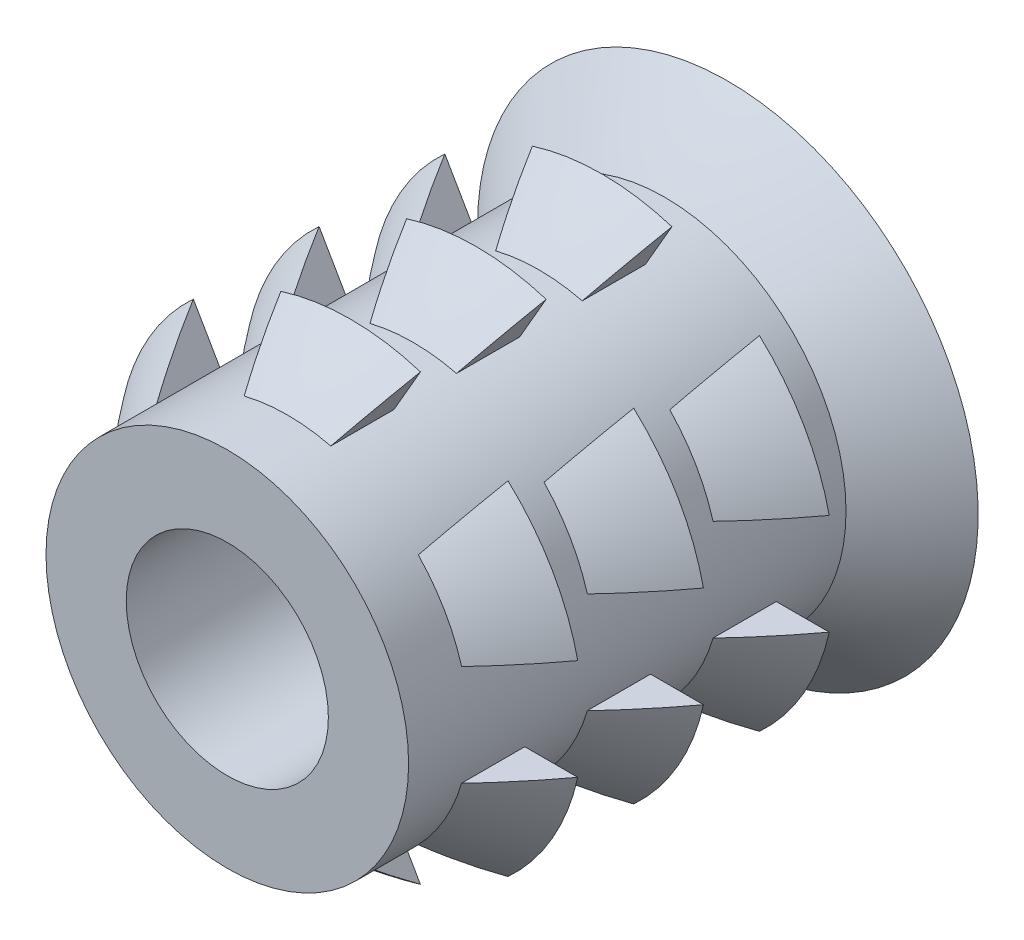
ISO-10303-21;
HEADER;
FILE_DESCRIPTION(('STEP AP214'),'2;1');
FILE_NAME('part.step','',(''),(''),'','','');
FILE_SCHEMA(('AUTOMOTIVE_DESIGN { 1 0 10303 214 1 1 1 1 }'));
ENDSEC;
DATA;
#1=APPLICATION_CONTEXT('core data for automotive mechanical design processes');
#2=APPLICATION_PROTOCOL_DEFINITION('international standard','automotive_design',2000,#1);
#3=PRODUCT_CONTEXT('',#1,'mechanical');
#4=PRODUCT('Part','Part','',(#3));
#5=PRODUCT_RELATED_PRODUCT_CATEGORY('part','',(#4));
#6=PRODUCT_DEFINITION_FORMATION('','',#4);
#7=PRODUCT_DEFINITION_CONTEXT('part definition',#1,'design');
#8=PRODUCT_DEFINITION('design','',#6,#7);
#9=PRODUCT_DEFINITION_SHAPE('','',#8);
#10=(LENGTH_UNIT() NAMED_UNIT(*) SI_UNIT(.MILLI.,.METRE.));
#11=(NAMED_UNIT(*) PLANE_ANGLE_UNIT() SI_UNIT($,.RADIAN.));
#12=(NAMED_UNIT(*) SI_UNIT($,.STERADIAN.) SOLID_ANGLE_UNIT());
#13=UNCERTAINTY_MEASURE_WITH_UNIT(LENGTH_MEASURE(1.E-05),#10,'distance_accuracy_value','');
#14=(GEOMETRIC_REPRESENTATION_CONTEXT(3) GLOBAL_UNCERTAINTY_ASSIGNED_CONTEXT((#13)) GLOBAL_UNIT_ASSIGNED_CONTEXT((#10,
#11,#12)) REPRESENTATION_CONTEXT('',''));
#15=CARTESIAN_POINT('',(0.,0.,0.));
#16=DIRECTION('',(0.,0.,1.));
#17=DIRECTION('',(1.,0.,0.));
#18=AXIS2_PLACEMENT_3D('',#15,#16,#17);
#19=CARTESIAN_POINT('',(10.06804757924,0.,-18.1229107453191));
#20=DIRECTION('',(0.,0.,-1.));
#21=DIRECTION('',(-1.,0.,0.));
#22=AXIS2_PLACEMENT_3D('',#19,#20,#21);
#23=CONICAL_SURFACE('',#22,1.09999999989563,0.785398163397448);
#24=CARTESIAN_POINT('',(10.06804757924,0.,-18.122910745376));
#25=DIRECTION('',(0.,0.,-1.));
#26=DIRECTION('',(-1.,0.,0.));
#27=AXIS2_PLACEMENT_3D('',#24,#25,#26);
#28=CIRCLE('',#27,1.09999999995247);
#29=CARTESIAN_POINT('',(8.96804757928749,0.,-18.122910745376));
#30=VERTEX_POINT('',#29);
#31=EDGE_CURVE('E20',#30,#30,#28,.T.);
#32=ORIENTED_EDGE('',*,*,#31,.T.);
#33=EDGE_LOOP('',(#32));
#34=FACE_BOUND('',#33,.T.);
#35=CARTESIAN_POINT('',(10.06804757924,0.,-17.8229107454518));
#36=DIRECTION('',(0.,0.,-1.));
#37=DIRECTION('',(-1.,0.,0.));
#38=AXIS2_PLACEMENT_3D('',#35,#36,#37);
#39=CIRCLE('',#38,0.799999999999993);
#40=CARTESIAN_POINT('',(9.26804757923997,0.,-17.8229107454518));
#41=VERTEX_POINT('',#40);
#42=EDGE_CURVE('E387',#41,#41,#39,.F.);
#43=ORIENTED_EDGE('',*,*,#42,.T.);
#44=EDGE_LOOP('',(#43));
#45=FACE_BOUND('',#44,.T.);
#46=ADVANCED_FACE('F17',(#34,#45),#23,.F.);
#47=CARTESIAN_POINT('',(10.06804757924,0.,-18.1229107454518));
#48=DIRECTION('',(0.,0.,-1.));
#49=DIRECTION('',(-1.,0.,0.));
#50=AXIS2_PLACEMENT_3D('',#47,#48,#49);
#51=CYLINDRICAL_SURFACE('',#50,0.799999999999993);
#52=CARTESIAN_POINT('',(10.06804757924,0.,-14.1605107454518));
#53=DIRECTION('',(0.,0.,-1.));
#54=DIRECTION('',(-1.,0.,0.));
#55=AXIS2_PLACEMENT_3D('',#52,#53,#54);
#56=CIRCLE('',#55,0.799999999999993);
#57=CARTESIAN_POINT('',(9.26804757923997,0.,-14.1605107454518));
#58=VERTEX_POINT('',#57);
#59=EDGE_CURVE('E1695',#58,#58,#56,.F.);
#60=ORIENTED_EDGE('',*,*,#59,.T.);
#61=EDGE_LOOP('',(#60));
#62=FACE_BOUND('',#61,.T.);
#63=ORIENTED_EDGE('',*,*,#42,.F.);
#64=EDGE_LOOP('',(#63));
#65=FACE_BOUND('',#64,.T.);
#66=ADVANCED_FACE('F1662',(#62,#65),#51,.F.);
#67=CARTESIAN_POINT('',(10.06804757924,0.,-18.1229107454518));
#68=DIRECTION('',(0.,0.,1.));
#69=DIRECTION('',(1.,0.,0.));
#70=AXIS2_PLACEMENT_3D('',#67,#68,#69);
#71=PLANE('',#70);
#72=CARTESIAN_POINT('',(10.06804757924,0.,-18.1229107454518));
#73=DIRECTION('',(0.,0.,-1.));
#74=DIRECTION('',(-1.,0.,0.));
#75=AXIS2_PLACEMENT_3D('',#72,#73,#74);
#76=CIRCLE('',#75,1.9812);
#77=CARTESIAN_POINT('',(8.08684757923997,0.,-18.1229107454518));
#78=VERTEX_POINT('',#77);
#79=EDGE_CURVE('E1084',#78,#78,#76,.F.);
#80=ORIENTED_EDGE('',*,*,#79,.F.);
#81=EDGE_LOOP('',(#80));
#82=FACE_BOUND('',#81,.T.);
#83=ORIENTED_EDGE('',*,*,#31,.F.);
#84=EDGE_LOOP('',(#83));
#85=FACE_BOUND('',#84,.T.);
#86=ADVANCED_FACE('F394',(#82,#85),#71,.F.);
#87=CARTESIAN_POINT('',(12.8032273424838,0.,-19.4370750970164));
#88=DIRECTION('',(0.,1.,0.));
#89=DIRECTION('',(-1.,0.,0.));
#90=AXIS2_PLACEMENT_3D('',#87,#88,#89);
#91=CIRCLE('',#90,5.64512755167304);
#92=TRIMMED_CURVE('',#91,(PARAMETER_VALUE(-1.0649814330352)),(PARAMETER_VALUE(1.0649814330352)),
.T.,.PARAMETER.);
#93=CARTESIAN_POINT('',(10.06804757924,0.,-19.4370750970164));
#94=DIRECTION('',(0.,0.,-1.));
#95=AXIS1_PLACEMENT('',#93,#94);
#96=SURFACE_OF_REVOLUTION('',#92,#95);
#97=CARTESIAN_POINT('',(10.06804757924,0.,-15.6323107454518));
#98=DIRECTION('',(0.,0.,-1.));
#99=DIRECTION('',(-1.,0.,0.));
#100=AXIS2_PLACEMENT_3D('',#97,#98,#99);
#101=CIRCLE('',#100,1.43509999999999);
#102=CARTESIAN_POINT('',(11.446275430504,0.4,-15.6323107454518));
#103=VERTEX_POINT('',#102);
#104=CARTESIAN_POINT('',(11.1035716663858,0.993580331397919,-15.6323107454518));
#105=VERTEX_POINT('',#104);
#106=EDGE_CURVE('E384',#103,#105,#101,.F.);
#107=ORIENTED_EDGE('',*,*,#106,.F.);
#108=CARTESIAN_POINT('',(11.446275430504,0.399999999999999,-15.6323107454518));
#109=CARTESIAN_POINT('',(11.4909398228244,0.399999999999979,-15.6793306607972));
#110=CARTESIAN_POINT('',(11.5347204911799,0.39999999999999,-15.7271856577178));
#111=CARTESIAN_POINT('',(11.6204380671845,0.40000000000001,-15.8244247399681));
#112=CARTESIAN_POINT('',(11.6623769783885,0.400000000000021,-15.873807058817));
#113=CARTESIAN_POINT('',(11.7591560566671,0.399999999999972,-15.9920517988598));
#114=CARTESIAN_POINT('',(11.8132259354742,0.399999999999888,-16.061546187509));
#115=CARTESIAN_POINT('',(11.8655798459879,0.399999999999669,-16.1323107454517));
#116=B_SPLINE_CURVE_WITH_KNOTS('',3,(#108,#109,#110,#111,#112,#113,#114,#115),.UNSPECIFIED.,.F.,
.F.,(4,2,2,4),(0.,0.194539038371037,0.388860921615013,0.652907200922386),.UNSPECIFIED.);
#117=CARTESIAN_POINT('',(11.8655798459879,0.399999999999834,-16.1323107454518));
#118=VERTEX_POINT('',#117);
#119=EDGE_CURVE('E361',#103,#118,#116,.T.);
#120=ORIENTED_EDGE('',*,*,#119,.T.);
#121=CARTESIAN_POINT('',(10.06804757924,0.,-16.1323107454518));
#122=DIRECTION('',(0.,0.,-1.));
#123=DIRECTION('',(-1.,0.,0.));
#124=AXIS2_PLACEMENT_3D('',#121,#122,#123);
#125=CIRCLE('',#124,1.8415);
#126=CARTESIAN_POINT('',(11.3132238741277,1.35670860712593,-16.1323107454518));
#127=VERTEX_POINT('',#126);
#128=EDGE_CURVE('E355',#118,#127,#125,.F.);
#129=ORIENTED_EDGE('',*,*,#128,.T.);
#130=CARTESIAN_POINT('',(11.3132238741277,1.35670860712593,-16.1323107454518));
#131=CARTESIAN_POINT('',(11.3024297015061,1.33801255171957,-16.1031275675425));
#132=CARTESIAN_POINT('',(11.2914890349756,1.3190627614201,-16.0741610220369));
#133=CARTESIAN_POINT('',(11.2693268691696,1.28067676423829,-16.0166992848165));
#134=CARTESIAN_POINT('',(11.2581056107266,1.2612409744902,-15.9882037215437));
#135=CARTESIAN_POINT('',(11.2353812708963,1.22188126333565,-15.931685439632));
#136=CARTESIAN_POINT('',(11.2238783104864,1.20195755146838,-15.9036625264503));
#137=CARTESIAN_POINT('',(11.2005886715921,1.16161871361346,-15.84809187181));
#138=CARTESIAN_POINT('',(11.1888019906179,1.14120358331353,-15.8205441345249));
#139=CARTESIAN_POINT('',(11.1649426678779,1.09987802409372,-15.7659283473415));
#140=CARTESIAN_POINT('',(11.1528699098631,1.07896739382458,-15.7388605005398));
#141=CARTESIAN_POINT('',(11.1284350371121,1.03664495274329,-15.6852106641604));
#142=CARTESIAN_POINT('',(11.1160726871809,1.01523273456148,-15.6586291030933));
#143=CARTESIAN_POINT('',(11.1035716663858,0.99358033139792,-15.6323107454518));
#144=B_SPLINE_CURVE_WITH_KNOTS('',3,(#130,#131,#132,#133,#134,#135,#136,#137,#138,#139,#140,
#141,#142,#143),.UNSPECIFIED.,.F.,.F.,(4,2,2,2,2,2,4),(0.,0.108899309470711,0.217708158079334,
0.326471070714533,0.435234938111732,0.544043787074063,0.652944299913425),.UNSPECIFIED.);
#145=EDGE_CURVE('E358',#127,#105,#144,.T.);
#146=ORIENTED_EDGE('',*,*,#145,.T.);
#147=EDGE_LOOP('',(#107,#120,#129,#146));
#148=FACE_BOUND('',#147,.T.);
#149=ADVANCED_FACE('F357',(#148),#96,.F.);
#150=CARTESIAN_POINT('',(11.1035716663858,0.993580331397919,-17.1605107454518));
#151=DIRECTION('',(0.866025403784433,-0.50000000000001,0.));
#152=DIRECTION('',(0.50000000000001,0.866025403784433,0.));
#153=AXIS2_PLACEMENT_3D('',#150,#151,#152);
#154=PLANE('',#153);
#155=DIRECTION('',(0.,0.,-1.));
#156=VECTOR('',#155,1.);
#157=CARTESIAN_POINT('',(11.1035716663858,0.993580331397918,-56.2915594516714));
#158=LINE('',#157,#156);
#159=CARTESIAN_POINT('',(11.1035716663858,0.993580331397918,-16.1323107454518));
#160=VERTEX_POINT('',#159);
#161=EDGE_CURVE('E371',#105,#160,#158,.T.);
#162=ORIENTED_EDGE('',*,*,#161,.F.);
#163=ORIENTED_EDGE('',*,*,#145,.F.);
#164=DIRECTION('',(-0.500000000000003,-0.866025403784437,0.));
#165=VECTOR('',#164,1.);
#166=CARTESIAN_POINT('',(11.3132238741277,1.35670860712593,-16.1323107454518));
#167=LINE('',#166,#165);
#168=EDGE_CURVE('E365',#127,#160,#167,.T.);
#169=ORIENTED_EDGE('',*,*,#168,.T.);
#170=EDGE_LOOP('',(#162,#163,#169));
#171=FACE_BOUND('',#170,.T.);
#172=ADVANCED_FACE('F368',(#171),#154,.F.);
#173=CARTESIAN_POINT('',(11.50314757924,0.,-16.1323107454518));
#174=DIRECTION('',(0.,0.,1.));
#175=DIRECTION('',(1.,0.,0.));
#176=AXIS2_PLACEMENT_3D('',#173,#174,#175);
#177=PLANE('',#176);
#178=ORIENTED_EDGE('',*,*,#168,.F.);
#179=ORIENTED_EDGE('',*,*,#128,.F.);
#180=DIRECTION('',(1.,0.,0.));
#181=VECTOR('',#180,1.);
#182=CARTESIAN_POINT('',(11.446275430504,0.4,-16.1323107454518));
#183=LINE('',#182,#181);
#184=CARTESIAN_POINT('',(11.446275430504,0.4,-16.1323107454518));
#185=VERTEX_POINT('',#184);
#186=EDGE_CURVE('E377',#118,#185,#183,.F.);
#187=ORIENTED_EDGE('',*,*,#186,.T.);
#188=CARTESIAN_POINT('',(10.06804757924,0.,-16.1323107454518));
#189=DIRECTION('',(0.,0.,-1.));
#190=DIRECTION('',(-1.,0.,0.));
#191=AXIS2_PLACEMENT_3D('',#188,#189,#190);
#192=CIRCLE('',#191,1.43509999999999);
#193=EDGE_CURVE('E375',#160,#185,#192,.T.);
#194=ORIENTED_EDGE('',*,*,#193,.F.);
#195=EDGE_LOOP('',(#178,#179,#187,#194));
#196=FACE_BOUND('',#195,.T.);
#197=ADVANCED_FACE('F373',(#196),#177,.F.);
#198=CARTESIAN_POINT('',(11.446275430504,0.4,-17.1605107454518));
#199=DIRECTION('',(0.,1.,0.));
#200=DIRECTION('',(0.,0.,1.));
#201=AXIS2_PLACEMENT_3D('',#198,#199,#200);
#202=PLANE('',#201);
#203=ORIENTED_EDGE('',*,*,#186,.F.);
#204=ORIENTED_EDGE('',*,*,#119,.F.);
#205=DIRECTION('',(0.,0.,-1.));
#206=VECTOR('',#205,1.);
#207=CARTESIAN_POINT('',(11.446275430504,0.4,-56.2915594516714));
#208=LINE('',#207,#206);
#209=EDGE_CURVE('E381',#185,#103,#208,.F.);
#210=ORIENTED_EDGE('',*,*,#209,.F.);
#211=EDGE_LOOP('',(#203,#204,#210));
#212=FACE_BOUND('',#211,.T.);
#213=ADVANCED_FACE('F413',(#212),#202,.F.);
#214=CARTESIAN_POINT('',(12.8032273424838,0.,-20.4323750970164));
#215=DIRECTION('',(0.,1.,0.));
#216=DIRECTION('',(-1.,0.,0.));
#217=AXIS2_PLACEMENT_3D('',#214,#215,#216);
#218=CIRCLE('',#217,5.64512755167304);
#219=TRIMMED_CURVE('',#218,(PARAMETER_VALUE(-1.0649814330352)),
(PARAMETER_VALUE(1.0649814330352)),.T.,.PARAMETER.);
#220=CARTESIAN_POINT('',(10.06804757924,0.,-20.4323750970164));
#221=DIRECTION('',(0.,0.,-1.));
#222=AXIS1_PLACEMENT('',#220,#221);
#223=SURFACE_OF_REVOLUTION('',#219,#222);
#224=CARTESIAN_POINT('',(10.06804757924,0.,-16.6276107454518));
#225=DIRECTION('',(0.,0.,-1.));
#226=DIRECTION('',(-1.,0.,0.));
#227=AXIS2_PLACEMENT_3D('',#224,#225,#226);
#228=CIRCLE('',#227,1.43509999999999);
#229=CARTESIAN_POINT('',(11.446275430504,0.4,-16.6276107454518));
#230=VERTEX_POINT('',#229);
#231=CARTESIAN_POINT('',(11.1035716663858,0.993580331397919,-16.6276107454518));
#232=VERTEX_POINT('',#231);
#233=EDGE_CURVE('E1069',#230,#232,#228,.F.);
#234=ORIENTED_EDGE('',*,*,#233,.F.);
#235=CARTESIAN_POINT('',(11.446275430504,0.4,-16.6276107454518));
#236=CARTESIAN_POINT('',(11.4909398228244,0.39999999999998,-16.6746306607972));
#237=CARTESIAN_POINT('',(11.5347204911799,0.39999999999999,-16.7224856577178));
#238=CARTESIAN_POINT('',(11.6204380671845,0.40000000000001,-16.8197247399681));
#239=CARTESIAN_POINT('',(11.6623769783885,0.40000000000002,-16.869107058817));
#240=CARTESIAN_POINT('',(11.7591560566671,0.399999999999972,-16.9873517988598));
#241=CARTESIAN_POINT('',(11.8132259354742,0.399999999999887,-17.056846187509));
#242=CARTESIAN_POINT('',(11.8655798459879,0.399999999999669,-17.1276107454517));
#243=B_SPLINE_CURVE_WITH_KNOTS('',3,(#235,#236,#237,#238,#239,#240,#241,#242),.UNSPECIFIED.,.F.,
.F.,(4,2,2,4),(0.,0.194539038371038,0.388860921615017,0.652907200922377),.UNSPECIFIED.);
#244=CARTESIAN_POINT('',(11.8655798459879,0.399999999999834,-17.1276107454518));
#245=VERTEX_POINT('',#244);
#246=EDGE_CURVE('E1068',#230,#245,#243,.T.);
#247=ORIENTED_EDGE('',*,*,#246,.T.);
#248=CARTESIAN_POINT('',(10.06804757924,0.,-17.1276107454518));
#249=DIRECTION('',(0.,0.,-1.));
#250=DIRECTION('',(-1.,0.,0.));
#251=AXIS2_PLACEMENT_3D('',#248,#249,#250);
#252=CIRCLE('',#251,1.8415);
#253=CARTESIAN_POINT('',(11.3132238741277,1.35670860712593,-17.1276107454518));
#254=VERTEX_POINT('',#253);
#255=EDGE_CURVE('E1080',#245,#254,#252,.F.);
#256=ORIENTED_EDGE('',*,*,#255,.T.);
#257=CARTESIAN_POINT('',(11.3132238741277,1.35670860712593,-17.1276107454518));
#258=CARTESIAN_POINT('',(11.3024297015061,1.33801255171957,-17.0984275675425));
#259=CARTESIAN_POINT('',(11.2914890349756,1.3190627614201,-17.0694610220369));
#260=CARTESIAN_POINT('',(11.2693268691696,1.28067676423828,-17.0119992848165));
#261=CARTESIAN_POINT('',(11.2581056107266,1.2612409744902,-16.9835037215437));
#262=CARTESIAN_POINT('',(11.2353812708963,1.22188126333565,-16.926985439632));
#263=CARTESIAN_POINT('',(11.2238783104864,1.20195755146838,-16.8989625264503));
#264=CARTESIAN_POINT('',(11.2005886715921,1.16161871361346,-16.84339187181));
#265=CARTESIAN_POINT('',(11.1888019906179,1.14120358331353,-16.8158441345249));
#266=CARTESIAN_POINT('',(11.1649426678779,1.09987802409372,-16.7612283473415));
#267=CARTESIAN_POINT('',(11.1528699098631,1.07896739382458,-16.7341605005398));
#268=CARTESIAN_POINT('',(11.1284350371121,1.03664495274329,-16.6805106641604));
#269=CARTESIAN_POINT('',(11.1160726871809,1.01523273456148,-16.6539291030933));
#270=CARTESIAN_POINT('',(11.1035716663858,0.99358033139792,-16.6276107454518));
#271=B_SPLINE_CURVE_WITH_KNOTS('',3,(#257,#258,#259,#260,#261,#262,#263,#264,#265,#266,#267,
#268,#269,#270),.UNSPECIFIED.,.F.,.F.,(4,2,2,2,2,2,4),(0.,0.108899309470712,0.217708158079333,
0.326471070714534,0.435234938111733,0.544043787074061,0.652944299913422),.UNSPECIFIED.);
#272=EDGE_CURVE('E406',#254,#232,#271,.T.);
#273=ORIENTED_EDGE('',*,*,#272,.T.);
#274=EDGE_LOOP('',(#234,#247,#256,#273));
#275=FACE_BOUND('',#274,.T.);
#276=ADVANCED_FACE('F416',(#275),#223,.F.);
#277=CARTESIAN_POINT('',(11.1035716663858,0.993580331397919,-17.1605107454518));
#278=DIRECTION('',(0.866025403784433,-0.50000000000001,0.));
#279=DIRECTION('',(0.50000000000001,0.866025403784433,0.));
#280=AXIS2_PLACEMENT_3D('',#277,#278,#279);
#281=PLANE('',#280);
#282=DIRECTION('',(0.,0.,-1.));
#283=VECTOR('',#282,1.);
#284=CARTESIAN_POINT('',(11.1035716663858,0.993580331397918,-56.2915594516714));
#285=LINE('',#284,#283);
#286=CARTESIAN_POINT('',(11.1035716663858,0.993580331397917,-17.1276107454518));
#287=VERTEX_POINT('',#286);
#288=EDGE_CURVE('E1072',#232,#287,#285,.T.);
#289=ORIENTED_EDGE('',*,*,#288,.F.);
#290=ORIENTED_EDGE('',*,*,#272,.F.);
#291=DIRECTION('',(-0.500000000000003,-0.866025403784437,0.));
#292=VECTOR('',#291,1.);
#293=CARTESIAN_POINT('',(11.3132238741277,1.35670860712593,-17.1276107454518));
#294=LINE('',#293,#292);
#295=EDGE_CURVE('E1078',#254,#287,#294,.T.);
#296=ORIENTED_EDGE('',*,*,#295,.T.);
#297=EDGE_LOOP('',(#289,#290,#296));
#298=FACE_BOUND('',#297,.T.);
#299=ADVANCED_FACE('F1621',(#298),#281,.F.);
#300=CARTESIAN_POINT('',(11.50314757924,0.,-17.1276107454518));
#301=DIRECTION('',(0.,0.,1.));
#302=DIRECTION('',(1.,0.,0.));
#303=AXIS2_PLACEMENT_3D('',#300,#301,#302);
#304=PLANE('',#303);
#305=ORIENTED_EDGE('',*,*,#295,.F.);
#306=ORIENTED_EDGE('',*,*,#255,.F.);
#307=DIRECTION('',(1.,0.,0.));
#308=VECTOR('',#307,1.);
#309=CARTESIAN_POINT('',(11.446275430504,0.4,-17.1276107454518));
#310=LINE('',#309,#308);
#311=CARTESIAN_POINT('',(11.446275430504,0.4,-17.1276107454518));
#312=VERTEX_POINT('',#311);
#313=EDGE_CURVE('E1065',#245,#312,#310,.F.);
#314=ORIENTED_EDGE('',*,*,#313,.T.);
#315=CARTESIAN_POINT('',(10.06804757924,0.,-17.1276107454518));
#316=DIRECTION('',(0.,0.,-1.));
#317=DIRECTION('',(-1.,0.,0.));
#318=AXIS2_PLACEMENT_3D('',#315,#316,#317);
#319=CIRCLE('',#318,1.43509999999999);
#320=EDGE_CURVE('E1077',#287,#312,#319,.T.);
#321=ORIENTED_EDGE('',*,*,#320,.F.);
#322=EDGE_LOOP('',(#305,#306,#314,#321));
#323=FACE_BOUND('',#322,.T.);
#324=ADVANCED_FACE('F1613',(#323),#304,.F.);
#325=CARTESIAN_POINT('',(11.446275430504,0.4,-17.1605107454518));
#326=DIRECTION('',(0.,1.,0.));
#327=DIRECTION('',(0.,0.,1.));
#328=AXIS2_PLACEMENT_3D('',#325,#326,#327);
#329=PLANE('',#328);
#330=ORIENTED_EDGE('',*,*,#313,.F.);
#331=ORIENTED_EDGE('',*,*,#246,.F.);
#332=DIRECTION('',(0.,0.,-1.));
#333=VECTOR('',#332,1.);
#334=CARTESIAN_POINT('',(11.446275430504,0.4,-56.2915594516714));
#335=LINE('',#334,#333);
#336=EDGE_CURVE('E1073',#312,#230,#335,.F.);
#337=ORIENTED_EDGE('',*,*,#336,.F.);
#338=EDGE_LOOP('',(#330,#331,#337));
#339=FACE_BOUND('',#338,.T.);
#340=ADVANCED_FACE('F1054',(#339),#329,.F.);
#341=CARTESIAN_POINT('',(12.8032273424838,0.,-18.4417750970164));
#342=DIRECTION('',(0.,1.,0.));
#343=DIRECTION('',(-1.,0.,0.));
#344=AXIS2_PLACEMENT_3D('',#341,#342,#343);
#345=CIRCLE('',#344,5.64512755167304);
#346=TRIMMED_CURVE('',#345,(PARAMETER_VALUE(-1.0649814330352)),
(PARAMETER_VALUE(1.0649814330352)),.T.,.PARAMETER.);
#347=CARTESIAN_POINT('',(10.06804757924,0.,-18.4417750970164));
#348=DIRECTION('',(0.,0.,-1.));
#349=AXIS1_PLACEMENT('',#347,#348);
#350=SURFACE_OF_REVOLUTION('',#346,#349);
#351=CARTESIAN_POINT('',(10.06804757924,0.,-14.6370107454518));
#352=DIRECTION('',(0.,0.,-1.));
#353=DIRECTION('',(-1.,0.,0.));
#354=AXIS2_PLACEMENT_3D('',#351,#352,#353);
#355=CIRCLE('',#354,1.43509999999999);
#356=CARTESIAN_POINT('',(11.446275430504,0.4,-14.6370107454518));
#357=VERTEX_POINT('',#356);
#358=CARTESIAN_POINT('',(11.1035716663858,0.993580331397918,-14.6370107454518));
#359=VERTEX_POINT('',#358);
#360=EDGE_CURVE('E1076',#357,#359,#355,.F.);
#361=ORIENTED_EDGE('',*,*,#360,.F.);
#362=CARTESIAN_POINT('',(11.446275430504,0.4,-14.6370107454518));
#363=CARTESIAN_POINT('',(11.4909398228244,0.399999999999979,-14.6840306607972));
#364=CARTESIAN_POINT('',(11.5347204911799,0.39999999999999,-14.7318856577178));
#365=CARTESIAN_POINT('',(11.6204380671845,0.40000000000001,-14.8291247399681));
#366=CARTESIAN_POINT('',(11.6623769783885,0.400000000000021,-14.878507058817));
#367=CARTESIAN_POINT('',(11.7591560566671,0.399999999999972,-14.9967517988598));
#368=CARTESIAN_POINT('',(11.8132259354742,0.399999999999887,-15.066246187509));
#369=CARTESIAN_POINT('',(11.8655798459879,0.399999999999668,-15.1370107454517));
#370=B_SPLINE_CURVE_WITH_KNOTS('',3,(#362,#363,#364,#365,#366,#367,#368,#369),.UNSPECIFIED.,.F.,
.F.,(4,2,2,4),(0.,0.19453903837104,0.388860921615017,0.652907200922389),.UNSPECIFIED.);
#371=CARTESIAN_POINT('',(11.8655798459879,0.399999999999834,-15.1370107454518));
#372=VERTEX_POINT('',#371);
#373=EDGE_CURVE('E1035',#357,#372,#370,.T.);
#374=ORIENTED_EDGE('',*,*,#373,.T.);
#375=CARTESIAN_POINT('',(10.06804757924,0.,-15.1370107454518));
#376=DIRECTION('',(0.,0.,-1.));
#377=DIRECTION('',(-1.,0.,0.));
#378=AXIS2_PLACEMENT_3D('',#375,#376,#377);
#379=CIRCLE('',#378,1.84149999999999);
#380=CARTESIAN_POINT('',(11.3132238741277,1.35670860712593,-15.1370107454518));
#381=VERTEX_POINT('',#380);
#382=EDGE_CURVE('E1042',#372,#381,#379,.F.);
#383=ORIENTED_EDGE('',*,*,#382,.T.);
#384=CARTESIAN_POINT('',(11.3132238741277,1.35670860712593,-15.1370107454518));
#385=CARTESIAN_POINT('',(11.3024297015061,1.33801255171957,-15.1078275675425));
#386=CARTESIAN_POINT('',(11.2914890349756,1.3190627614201,-15.0788610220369));
#387=CARTESIAN_POINT('',(11.2693268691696,1.28067676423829,-15.0213992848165));
#388=CARTESIAN_POINT('',(11.2581056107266,1.2612409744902,-14.9929037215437));
#389=CARTESIAN_POINT('',(11.2353812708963,1.22188126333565,-14.936385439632));
#390=CARTESIAN_POINT('',(11.2238783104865,1.20195755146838,-14.9083625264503));
#391=CARTESIAN_POINT('',(11.2005886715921,1.16161871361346,-14.85279187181));
#392=CARTESIAN_POINT('',(11.1888019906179,1.14120358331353,-14.8252441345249));
#393=CARTESIAN_POINT('',(11.1649426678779,1.09987802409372,-14.7706283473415));
#394=CARTESIAN_POINT('',(11.1528699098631,1.07896739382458,-14.7435605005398));
#395=CARTESIAN_POINT('',(11.1284350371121,1.03664495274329,-14.6899106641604));
#396=CARTESIAN_POINT('',(11.1160726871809,1.01523273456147,-14.6633291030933));
#397=CARTESIAN_POINT('',(11.1035716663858,0.993580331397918,-14.6370107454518));
#398=B_SPLINE_CURVE_WITH_KNOTS('',3,(#384,#385,#386,#387,#388,#389,#390,#391,#392,#393,#394,
#395,#396,#397),.UNSPECIFIED.,.F.,.F.,(4,2,2,2,2,2,4),(0.,0.108899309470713,0.217708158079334,
0.326471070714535,0.435234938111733,0.544043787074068,0.652944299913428),.UNSPECIFIED.);
#399=EDGE_CURVE('E1067',#381,#359,#398,.T.);
#400=ORIENTED_EDGE('',*,*,#399,.T.);
#401=EDGE_LOOP('',(#361,#374,#383,#400));
#402=FACE_BOUND('',#401,.T.);
#403=ADVANCED_FACE('F1047',(#402),#350,.F.);
#404=CARTESIAN_POINT('',(11.1035716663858,0.993580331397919,-17.1605107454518));
#405=DIRECTION('',(0.866025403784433,-0.50000000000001,0.));
#406=DIRECTION('',(0.50000000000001,0.866025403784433,0.));
#407=AXIS2_PLACEMENT_3D('',#404,#405,#406);
#408=PLANE('',#407);
#409=DIRECTION('',(0.,0.,-1.));
#410=VECTOR('',#409,1.);
#411=CARTESIAN_POINT('',(11.1035716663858,0.993580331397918,-56.2915594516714));
#412=LINE('',#411,#410);
#413=CARTESIAN_POINT('',(11.1035716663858,0.993580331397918,-15.1370107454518));
#414=VERTEX_POINT('',#413);
#415=EDGE_CURVE('E1063',#359,#414,#412,.T.);
#416=ORIENTED_EDGE('',*,*,#415,.F.);
#417=ORIENTED_EDGE('',*,*,#399,.F.);
#418=DIRECTION('',(-0.500000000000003,-0.866025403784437,0.));
#419=VECTOR('',#418,1.);
#420=CARTESIAN_POINT('',(11.3132238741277,1.35670860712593,-15.1370107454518));
#421=LINE('',#420,#419);
#422=EDGE_CURVE('E1041',#381,#414,#421,.T.);
#423=ORIENTED_EDGE('',*,*,#422,.T.);
#424=EDGE_LOOP('',(#416,#417,#423));
#425=FACE_BOUND('',#424,.T.);
#426=ADVANCED_FACE('F1053',(#425),#408,.F.);
#427=CARTESIAN_POINT('',(11.50314757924,0.,-15.1370107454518));
#428=DIRECTION('',(0.,0.,1.));
#429=DIRECTION('',(1.,0.,0.));
#430=AXIS2_PLACEMENT_3D('',#427,#428,#429);
#431=PLANE('',#430);
#432=ORIENTED_EDGE('',*,*,#422,.F.);
#433=ORIENTED_EDGE('',*,*,#382,.F.);
#434=DIRECTION('',(1.,0.,0.));
#435=VECTOR('',#434,1.);
#436=CARTESIAN_POINT('',(11.446275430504,0.4,-15.1370107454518));
#437=LINE('',#436,#435);
#438=CARTESIAN_POINT('',(11.446275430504,0.4,-15.1370107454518));
#439=VERTEX_POINT('',#438);
#440=EDGE_CURVE('E1009',#372,#439,#437,.F.);
#441=ORIENTED_EDGE('',*,*,#440,.T.);
#442=CARTESIAN_POINT('',(10.06804757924,0.,-15.1370107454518));
#443=DIRECTION('',(0.,0.,-1.));
#444=DIRECTION('',(-1.,0.,0.));
#445=AXIS2_PLACEMENT_3D('',#442,#443,#444);
#446=CIRCLE('',#445,1.43509999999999);
#447=EDGE_CURVE('E1096',#414,#439,#446,.T.);
#448=ORIENTED_EDGE('',*,*,#447,.F.);
#449=EDGE_LOOP('',(#432,#433,#441,#448));
#450=FACE_BOUND('',#449,.T.);
#451=ADVANCED_FACE('F1586',(#450),#431,.F.);
#452=CARTESIAN_POINT('',(11.446275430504,0.4,-17.1605107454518));
#453=DIRECTION('',(0.,1.,0.));
#454=DIRECTION('',(0.,0.,1.));
#455=AXIS2_PLACEMENT_3D('',#452,#453,#454);
#456=PLANE('',#455);
#457=ORIENTED_EDGE('',*,*,#440,.F.);
#458=ORIENTED_EDGE('',*,*,#373,.F.);
#459=DIRECTION('',(0.,0.,-1.));
#460=VECTOR('',#459,1.);
#461=CARTESIAN_POINT('',(11.446275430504,0.4,-56.2915594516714));
#462=LINE('',#461,#460);
#463=EDGE_CURVE('E1004',#439,#357,#462,.F.);
#464=ORIENTED_EDGE('',*,*,#463,.F.);
#465=EDGE_LOOP('',(#457,#458,#464));
#466=FACE_BOUND('',#465,.T.);
#467=ADVANCED_FACE('F1044',(#466),#456,.F.);
#468=CARTESIAN_POINT('',(10.4107513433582,1.39358033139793,-17.1605107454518));
#469=DIRECTION('',(-0.866025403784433,0.50000000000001,0.));
#470=DIRECTION('',(-0.50000000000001,-0.866025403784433,0.));
#471=AXIS2_PLACEMENT_3D('',#468,#469,#470);
#472=PLANE('',#471);
#473=DIRECTION('',(0.500000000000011,0.866025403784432,0.));
#474=VECTOR('',#473,1.);
#475=CARTESIAN_POINT('',(10.4107513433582,1.39358033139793,-15.1370107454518));
#476=LINE('',#475,#474);
#477=CARTESIAN_POINT('',(10.4107513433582,1.39358033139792,-15.1370107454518));
#478=VERTEX_POINT('',#477);
#479=CARTESIAN_POINT('',(10.6204035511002,1.75670860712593,-15.1370107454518));
#480=VERTEX_POINT('',#479);
#481=EDGE_CURVE('E990',#478,#480,#476,.T.);
#482=ORIENTED_EDGE('',*,*,#481,.T.);
#483=CARTESIAN_POINT('',(10.4107513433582,1.39358033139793,-14.6370107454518));
#484=CARTESIAN_POINT('',(10.4330835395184,1.43226082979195,-14.6840306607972));
#485=CARTESIAN_POINT('',(10.4549738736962,1.47017600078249,-14.7318856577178));
#486=CARTESIAN_POINT('',(10.4978326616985,1.54440959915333,-14.8291247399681));
#487=CARTESIAN_POINT('',(10.5188021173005,1.58072976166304,-14.878507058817));
#488=CARTESIAN_POINT('',(10.5671916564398,1.6645429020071,-14.9967517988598));
#489=CARTESIAN_POINT('',(10.5942265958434,1.71136879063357,-15.066246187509));
#490=CARTESIAN_POINT('',(10.6204035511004,1.75670860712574,-15.1370107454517));
#491=B_SPLINE_CURVE_WITH_KNOTS('',3,(#483,#484,#485,#486,#487,#488,#489,#490),.UNSPECIFIED.,.F.,
.F.,(4,2,2,4),(0.,0.19453903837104,0.388860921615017,0.652907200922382),.UNSPECIFIED.);
#492=CARTESIAN_POINT('',(10.4107513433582,1.39358033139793,-14.6370107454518));
#493=VERTEX_POINT('',#492);
#494=EDGE_CURVE('E1029',#493,#480,#491,.T.);
#495=ORIENTED_EDGE('',*,*,#494,.F.);
#496=DIRECTION('',(0.,0.,-1.));
#497=VECTOR('',#496,1.);
#498=CARTESIAN_POINT('',(10.4107513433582,1.39358033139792,-56.2915594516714));
#499=LINE('',#498,#497);
#500=EDGE_CURVE('E1001',#478,#493,#499,.F.);
#501=ORIENTED_EDGE('',*,*,#500,.F.);
#502=EDGE_LOOP('',(#482,#495,#501));
#503=FACE_BOUND('',#502,.T.);
#504=ADVANCED_FACE('F1018',(#503),#472,.F.);
#505=CARTESIAN_POINT('',(12.8032273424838,0.,-18.4417750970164));
#506=DIRECTION('',(0.,1.,0.));
#507=DIRECTION('',(-1.,0.,0.));
#508=AXIS2_PLACEMENT_3D('',#505,#506,#507);
#509=CIRCLE('',#508,5.64512755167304);
#510=TRIMMED_CURVE('',#509,(PARAMETER_VALUE(-1.0649814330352)),
(PARAMETER_VALUE(1.0649814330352)),.T.,.PARAMETER.);
#511=CARTESIAN_POINT('',(10.06804757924,0.,-18.4417750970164));
#512=DIRECTION('',(0.,0.,-1.));
#513=AXIS1_PLACEMENT('',#511,#512);
#514=SURFACE_OF_REVOLUTION('',#510,#513);
#515=CARTESIAN_POINT('',(10.06804757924,0.,-15.1370107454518));
#516=DIRECTION('',(0.,0.,-1.));
#517=DIRECTION('',(-1.,0.,0.));
#518=AXIS2_PLACEMENT_3D('',#515,#516,#517);
#519=CIRCLE('',#518,1.84149999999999);
#520=CARTESIAN_POINT('',(9.51569160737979,1.75670860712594,-15.1370107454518));
#521=VERTEX_POINT('',#520);
#522=EDGE_CURVE('E992',#480,#521,#519,.F.);
#523=ORIENTED_EDGE('',*,*,#522,.T.);
#524=CARTESIAN_POINT('',(9.51569160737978,1.75670860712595,-15.1370107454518));
#525=CARTESIAN_POINT('',(9.52648578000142,1.73801255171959,-15.1078275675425));
#526=CARTESIAN_POINT('',(9.53742644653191,1.71906276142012,-15.0788610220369));
#527=CARTESIAN_POINT('',(9.55958861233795,1.6806767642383,-15.0213992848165));
#528=CARTESIAN_POINT('',(9.57080987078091,1.66124097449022,-14.9929037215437));
#529=CARTESIAN_POINT('',(9.59353421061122,1.62188126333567,-14.936385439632));
#530=CARTESIAN_POINT('',(9.60503717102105,1.60195755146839,-14.9083625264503));
#531=CARTESIAN_POINT('',(9.62832680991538,1.56161871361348,-14.85279187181));
#532=CARTESIAN_POINT('',(9.64011349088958,1.54120358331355,-14.8252441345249));
#533=CARTESIAN_POINT('',(9.66397281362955,1.49987802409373,-14.7706283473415));
#534=CARTESIAN_POINT('',(9.67604557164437,1.4789673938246,-14.7435605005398));
#535=CARTESIAN_POINT('',(9.70048044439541,1.4366449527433,-14.6899106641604));
#536=CARTESIAN_POINT('',(9.71284279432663,1.41523273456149,-14.6633291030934));
#537=CARTESIAN_POINT('',(9.72534381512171,1.39358033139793,-14.6370107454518));
#538=B_SPLINE_CURVE_WITH_KNOTS('',3,(#524,#525,#526,#527,#528,#529,#530,#531,#532,#533,#534,
#535,#536,#537),.UNSPECIFIED.,.F.,.F.,(4,2,2,2,2,2,4),(0.,0.108899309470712,0.217708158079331,
0.326471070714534,0.435234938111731,0.544043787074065,0.652944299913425),.UNSPECIFIED.);
#539=CARTESIAN_POINT('',(9.72534381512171,1.39358033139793,-14.6370107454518));
#540=VERTEX_POINT('',#539);
#541=EDGE_CURVE('E995',#521,#540,#538,.T.);
#542=ORIENTED_EDGE('',*,*,#541,.T.);
#543=CARTESIAN_POINT('',(10.06804757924,0.,-14.6370107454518));
#544=DIRECTION('',(0.,0.,-1.));
#545=DIRECTION('',(-1.,0.,0.));
#546=AXIS2_PLACEMENT_3D('',#543,#544,#545);
#547=CIRCLE('',#546,1.43509999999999);
#548=EDGE_CURVE('E1000',#493,#540,#547,.F.);
#549=ORIENTED_EDGE('',*,*,#548,.F.);
#550=ORIENTED_EDGE('',*,*,#494,.T.);
#551=EDGE_LOOP('',(#523,#542,#549,#550));
#552=FACE_BOUND('',#551,.T.);
#553=ADVANCED_FACE('F1012',(#552),#514,.F.);
#554=CARTESIAN_POINT('',(9.72534381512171,1.39358033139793,-17.1605107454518));
#555=DIRECTION('',(0.866025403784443,0.499999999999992,0.));
#556=DIRECTION('',(-0.499999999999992,0.866025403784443,0.));
#557=AXIS2_PLACEMENT_3D('',#554,#555,#556);
#558=PLANE('',#557);
#559=DIRECTION('',(0.,0.,-1.));
#560=VECTOR('',#559,1.);
#561=CARTESIAN_POINT('',(9.72534381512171,1.39358033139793,-56.2915594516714));
#562=LINE('',#561,#560);
#563=CARTESIAN_POINT('',(9.72534381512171,1.39358033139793,-15.1370107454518));
#564=VERTEX_POINT('',#563);
#565=EDGE_CURVE('E996',#540,#564,#562,.T.);
#566=ORIENTED_EDGE('',*,*,#565,.F.);
#567=ORIENTED_EDGE('',*,*,#541,.F.);
#568=DIRECTION('',(0.499999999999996,-0.866025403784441,0.));
#569=VECTOR('',#568,1.);
#570=CARTESIAN_POINT('',(9.51569160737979,1.75670860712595,-15.1370107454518));
#571=LINE('',#570,#569);
#572=EDGE_CURVE('E993',#521,#564,#571,.T.);
#573=ORIENTED_EDGE('',*,*,#572,.T.);
#574=EDGE_LOOP('',(#566,#567,#573));
#575=FACE_BOUND('',#574,.T.);
#576=ADVANCED_FACE('F1017',(#575),#558,.F.);
#577=CARTESIAN_POINT('',(11.50314757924,0.,-15.1370107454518));
#578=DIRECTION('',(0.,0.,1.));
#579=DIRECTION('',(1.,0.,0.));
#580=AXIS2_PLACEMENT_3D('',#577,#578,#579);
#581=PLANE('',#580);
#582=ORIENTED_EDGE('',*,*,#481,.F.);
#583=CARTESIAN_POINT('',(10.06804757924,0.,-15.1370107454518));
#584=DIRECTION('',(0.,0.,-1.));
#585=DIRECTION('',(-1.,0.,0.));
#586=AXIS2_PLACEMENT_3D('',#583,#584,#585);
#587=CIRCLE('',#586,1.43509999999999);
#588=EDGE_CURVE('E999',#564,#478,#587,.T.);
#589=ORIENTED_EDGE('',*,*,#588,.F.);
#590=ORIENTED_EDGE('',*,*,#572,.F.);
#591=ORIENTED_EDGE('',*,*,#522,.F.);
#592=EDGE_LOOP('',(#582,#589,#590,#591));
#593=FACE_BOUND('',#592,.T.);
#594=ADVANCED_FACE('F1552',(#593),#581,.F.);
#595=CARTESIAN_POINT('',(10.4107513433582,1.39358033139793,-17.1605107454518));
#596=DIRECTION('',(-0.866025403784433,0.50000000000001,0.));
#597=DIRECTION('',(-0.50000000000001,-0.866025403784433,0.));
#598=AXIS2_PLACEMENT_3D('',#595,#596,#597);
#599=PLANE('',#598);
#600=DIRECTION('',(0.500000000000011,0.866025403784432,0.));
#601=VECTOR('',#600,1.);
#602=CARTESIAN_POINT('',(10.4107513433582,1.39358033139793,-16.1323107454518));
#603=LINE('',#602,#601);
#604=CARTESIAN_POINT('',(10.4107513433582,1.39358033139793,-16.1323107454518));
#605=VERTEX_POINT('',#604);
#606=CARTESIAN_POINT('',(10.6204035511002,1.75670860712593,-16.1323107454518));
#607=VERTEX_POINT('',#606);
#608=EDGE_CURVE('E929',#605,#607,#603,.T.);
#609=ORIENTED_EDGE('',*,*,#608,.T.);
#610=CARTESIAN_POINT('',(10.4107513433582,1.39358033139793,-15.6323107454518));
#611=CARTESIAN_POINT('',(10.4330835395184,1.43226082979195,-15.6793306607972));
#612=CARTESIAN_POINT('',(10.4549738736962,1.47017600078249,-15.7271856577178));
#613=CARTESIAN_POINT('',(10.4978326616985,1.54440959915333,-15.8244247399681));
#614=CARTESIAN_POINT('',(10.5188021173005,1.58072976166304,-15.873807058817));
#615=CARTESIAN_POINT('',(10.5671916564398,1.6645429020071,-15.9920517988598));
#616=CARTESIAN_POINT('',(10.5942265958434,1.71136879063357,-16.061546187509));
#617=CARTESIAN_POINT('',(10.6204035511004,1.75670860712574,-16.1323107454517));
#618=B_SPLINE_CURVE_WITH_KNOTS('',3,(#610,#611,#612,#613,#614,#615,#616,#617),.UNSPECIFIED.,.F.,
.F.,(4,2,2,4),(0.,0.194539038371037,0.388860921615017,0.652907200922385),.UNSPECIFIED.);
#619=CARTESIAN_POINT('',(10.4107513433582,1.39358033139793,-15.6323107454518));
#620=VERTEX_POINT('',#619);
#621=EDGE_CURVE('E968',#620,#607,#618,.T.);
#622=ORIENTED_EDGE('',*,*,#621,.F.);
#623=DIRECTION('',(0.,0.,-1.));
#624=VECTOR('',#623,1.);
#625=CARTESIAN_POINT('',(10.4107513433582,1.39358033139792,-56.2915594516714));
#626=LINE('',#625,#624);
#627=EDGE_CURVE('E1101',#605,#620,#626,.F.);
#628=ORIENTED_EDGE('',*,*,#627,.F.);
#629=EDGE_LOOP('',(#609,#622,#628));
#630=FACE_BOUND('',#629,.T.);
#631=ADVANCED_FACE('F980',(#630),#599,.F.);
#632=CARTESIAN_POINT('',(12.8032273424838,0.,-19.4370750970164));
#633=DIRECTION('',(0.,1.,0.));
#634=DIRECTION('',(-1.,0.,0.));
#635=AXIS2_PLACEMENT_3D('',#632,#633,#634);
#636=CIRCLE('',#635,5.64512755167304);
#637=TRIMMED_CURVE('',#636,(PARAMETER_VALUE(-1.0649814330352)),
(PARAMETER_VALUE(1.0649814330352)),.T.,.PARAMETER.);
#638=CARTESIAN_POINT('',(10.06804757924,0.,-19.4370750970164));
#639=DIRECTION('',(0.,0.,-1.));
#640=AXIS1_PLACEMENT('',#638,#639);
#641=SURFACE_OF_REVOLUTION('',#637,#640);
#642=CARTESIAN_POINT('',(10.06804757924,0.,-16.1323107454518));
#643=DIRECTION('',(0.,0.,-1.));
#644=DIRECTION('',(-1.,0.,0.));
#645=AXIS2_PLACEMENT_3D('',#642,#643,#644);
#646=CIRCLE('',#645,1.84149999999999);
#647=CARTESIAN_POINT('',(9.51569160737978,1.75670860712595,-16.1323107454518));
#648=VERTEX_POINT('',#647);
#649=EDGE_CURVE('E957',#607,#648,#646,.F.);
#650=ORIENTED_EDGE('',*,*,#649,.T.);
#651=CARTESIAN_POINT('',(9.51569160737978,1.75670860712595,-16.1323107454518));
#652=CARTESIAN_POINT('',(9.52648578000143,1.73801255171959,-16.1031275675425));
#653=CARTESIAN_POINT('',(9.53742644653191,1.71906276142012,-16.0741610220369));
#654=CARTESIAN_POINT('',(9.55958861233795,1.6806767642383,-16.0166992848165));
#655=CARTESIAN_POINT('',(9.57080987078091,1.66124097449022,-15.9882037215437));
#656=CARTESIAN_POINT('',(9.59353421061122,1.62188126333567,-15.931685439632));
#657=CARTESIAN_POINT('',(9.60503717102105,1.60195755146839,-15.9036625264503));
#658=CARTESIAN_POINT('',(9.62832680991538,1.56161871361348,-15.84809187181));
#659=CARTESIAN_POINT('',(9.64011349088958,1.54120358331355,-15.8205441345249));
#660=CARTESIAN_POINT('',(9.66397281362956,1.49987802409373,-15.7659283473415));
#661=CARTESIAN_POINT('',(9.67604557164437,1.4789673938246,-15.7388605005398));
#662=CARTESIAN_POINT('',(9.70048044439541,1.4366449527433,-15.6852106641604));
#663=CARTESIAN_POINT('',(9.71284279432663,1.41523273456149,-15.6586291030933));
#664=CARTESIAN_POINT('',(9.72534381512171,1.39358033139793,-15.6323107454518));
#665=B_SPLINE_CURVE_WITH_KNOTS('',3,(#651,#652,#653,#654,#655,#656,#657,#658,#659,#660,#661,
#662,#663,#664),.UNSPECIFIED.,.F.,.F.,(4,2,2,2,2,2,4),(0.,0.108899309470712,0.217708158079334,
0.326471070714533,0.435234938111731,0.544043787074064,0.652944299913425),.UNSPECIFIED.);
#666=CARTESIAN_POINT('',(9.72534381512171,1.39358033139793,-15.6323107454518));
#667=VERTEX_POINT('',#666);
#668=EDGE_CURVE('E960',#648,#667,#665,.T.);
#669=ORIENTED_EDGE('',*,*,#668,.T.);
#670=CARTESIAN_POINT('',(10.06804757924,0.,-15.6323107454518));
#671=DIRECTION('',(0.,0.,-1.));
#672=DIRECTION('',(-1.,0.,0.));
#673=AXIS2_PLACEMENT_3D('',#670,#671,#672);
#674=CIRCLE('',#673,1.43509999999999);
#675=EDGE_CURVE('E988',#620,#667,#674,.F.);
#676=ORIENTED_EDGE('',*,*,#675,.F.);
#677=ORIENTED_EDGE('',*,*,#621,.T.);
#678=EDGE_LOOP('',(#650,#669,#676,#677));
#679=FACE_BOUND('',#678,.T.);
#680=ADVANCED_FACE('F976',(#679),#641,.F.);
#681=CARTESIAN_POINT('',(9.72534381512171,1.39358033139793,-17.1605107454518));
#682=DIRECTION('',(0.866025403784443,0.499999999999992,0.));
#683=DIRECTION('',(-0.499999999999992,0.866025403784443,0.));
#684=AXIS2_PLACEMENT_3D('',#681,#682,#683);
#685=PLANE('',#684);
#686=DIRECTION('',(0.,0.,-1.));
#687=VECTOR('',#686,1.);
#688=CARTESIAN_POINT('',(9.72534381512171,1.39358033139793,-56.2915594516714));
#689=LINE('',#688,#687);
#690=CARTESIAN_POINT('',(9.72534381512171,1.39358033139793,-16.1323107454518));
#691=VERTEX_POINT('',#690);
#692=EDGE_CURVE('E1104',#667,#691,#689,.T.);
#693=ORIENTED_EDGE('',*,*,#692,.F.);
#694=ORIENTED_EDGE('',*,*,#668,.F.);
#695=DIRECTION('',(0.499999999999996,-0.866025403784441,0.));
#696=VECTOR('',#695,1.);
#697=CARTESIAN_POINT('',(9.51569160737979,1.75670860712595,-16.1323107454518));
#698=LINE('',#697,#696);
#699=EDGE_CURVE('E967',#648,#691,#698,.T.);
#700=ORIENTED_EDGE('',*,*,#699,.T.);
#701=EDGE_LOOP('',(#693,#694,#700));
#702=FACE_BOUND('',#701,.T.);
#703=ADVANCED_FACE('F974',(#702),#685,.F.);
#704=CARTESIAN_POINT('',(11.50314757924,0.,-16.1323107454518));
#705=DIRECTION('',(0.,0.,1.));
#706=DIRECTION('',(1.,0.,0.));
#707=AXIS2_PLACEMENT_3D('',#704,#705,#706);
#708=PLANE('',#707);
#709=ORIENTED_EDGE('',*,*,#608,.F.);
#710=CARTESIAN_POINT('',(10.06804757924,0.,-16.1323107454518));
#711=DIRECTION('',(0.,0.,-1.));
#712=DIRECTION('',(-1.,0.,0.));
#713=AXIS2_PLACEMENT_3D('',#710,#711,#712);
#714=CIRCLE('',#713,1.43509999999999);
#715=EDGE_CURVE('E924',#691,#605,#714,.T.);
#716=ORIENTED_EDGE('',*,*,#715,.F.);
#717=ORIENTED_EDGE('',*,*,#699,.F.);
#718=ORIENTED_EDGE('',*,*,#649,.F.);
#719=EDGE_LOOP('',(#709,#716,#717,#718));
#720=FACE_BOUND('',#719,.T.);
#721=ADVANCED_FACE('F1525',(#720),#708,.F.);
#722=CARTESIAN_POINT('',(10.4107513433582,1.39358033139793,-17.1605107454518));
#723=DIRECTION('',(-0.866025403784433,0.50000000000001,0.));
#724=DIRECTION('',(-0.50000000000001,-0.866025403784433,0.));
#725=AXIS2_PLACEMENT_3D('',#722,#723,#724);
#726=PLANE('',#725);
#727=DIRECTION('',(0.500000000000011,0.866025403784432,0.));
#728=VECTOR('',#727,1.);
#729=CARTESIAN_POINT('',(10.4107513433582,1.39358033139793,-17.1276107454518));
#730=LINE('',#729,#728);
#731=CARTESIAN_POINT('',(10.4107513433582,1.39358033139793,-17.1276107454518));
#732=VERTEX_POINT('',#731);
#733=CARTESIAN_POINT('',(10.6204035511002,1.75670860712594,-17.1276107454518));
#734=VERTEX_POINT('',#733);
#735=EDGE_CURVE('E910',#732,#734,#730,.T.);
#736=ORIENTED_EDGE('',*,*,#735,.T.);
#737=CARTESIAN_POINT('',(10.4107513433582,1.39358033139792,-16.6276107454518));
#738=CARTESIAN_POINT('',(10.4330835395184,1.43226082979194,-16.6746306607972));
#739=CARTESIAN_POINT('',(10.4549738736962,1.47017600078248,-16.7224856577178));
#740=CARTESIAN_POINT('',(10.4978326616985,1.54440959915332,-16.8197247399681));
#741=CARTESIAN_POINT('',(10.5188021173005,1.58072976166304,-16.869107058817));
#742=CARTESIAN_POINT('',(10.5671916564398,1.66454290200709,-16.9873517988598));
#743=CARTESIAN_POINT('',(10.5942265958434,1.71136879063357,-17.056846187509));
#744=CARTESIAN_POINT('',(10.6204035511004,1.75670860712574,-17.1276107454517));
#745=B_SPLINE_CURVE_WITH_KNOTS('',3,(#737,#738,#739,#740,#741,#742,#743,#744),.UNSPECIFIED.,.F.,
.F.,(4,2,2,4),(0.,0.19453903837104,0.388860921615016,0.652907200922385),.UNSPECIFIED.);
#746=CARTESIAN_POINT('',(10.4107513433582,1.39358033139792,-16.6276107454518));
#747=VERTEX_POINT('',#746);
#748=EDGE_CURVE('E951',#747,#734,#745,.T.);
#749=ORIENTED_EDGE('',*,*,#748,.F.);
#750=DIRECTION('',(0.,0.,-1.));
#751=VECTOR('',#750,1.);
#752=CARTESIAN_POINT('',(10.4107513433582,1.39358033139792,-56.2915594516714));
#753=LINE('',#752,#751);
#754=EDGE_CURVE('E921',#732,#747,#753,.F.);
#755=ORIENTED_EDGE('',*,*,#754,.F.);
#756=EDGE_LOOP('',(#736,#749,#755));
#757=FACE_BOUND('',#756,.T.);
#758=ADVANCED_FACE('F938',(#757),#726,.F.);
#759=CARTESIAN_POINT('',(12.8032273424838,0.,-20.4323750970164));
#760=DIRECTION('',(0.,1.,0.));
#761=DIRECTION('',(-1.,0.,0.));
#762=AXIS2_PLACEMENT_3D('',#759,#760,#761);
#763=CIRCLE('',#762,5.64512755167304);
#764=TRIMMED_CURVE('',#763,(PARAMETER_VALUE(-1.0649814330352)),
(PARAMETER_VALUE(1.0649814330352)),.T.,.PARAMETER.);
#765=CARTESIAN_POINT('',(10.06804757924,0.,-20.4323750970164));
#766=DIRECTION('',(0.,0.,-1.));
#767=AXIS1_PLACEMENT('',#765,#766);
#768=SURFACE_OF_REVOLUTION('',#764,#767);
#769=CARTESIAN_POINT('',(10.06804757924,0.,-17.1276107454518));
#770=DIRECTION('',(0.,0.,-1.));
#771=DIRECTION('',(-1.,0.,0.));
#772=AXIS2_PLACEMENT_3D('',#769,#770,#771);
#773=CIRCLE('',#772,1.8415);
#774=CARTESIAN_POINT('',(9.51569160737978,1.75670860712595,-17.1276107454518));
#775=VERTEX_POINT('',#774);
#776=EDGE_CURVE('E912',#734,#775,#773,.F.);
#777=ORIENTED_EDGE('',*,*,#776,.T.);
#778=CARTESIAN_POINT('',(9.51569160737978,1.75670860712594,-17.1276107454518));
#779=CARTESIAN_POINT('',(9.52648578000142,1.73801255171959,-17.0984275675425));
#780=CARTESIAN_POINT('',(9.53742644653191,1.71906276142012,-17.0694610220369));
#781=CARTESIAN_POINT('',(9.55958861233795,1.6806767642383,-17.0119992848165));
#782=CARTESIAN_POINT('',(9.57080987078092,1.66124097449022,-16.9835037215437));
#783=CARTESIAN_POINT('',(9.59353421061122,1.62188126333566,-16.926985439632));
#784=CARTESIAN_POINT('',(9.60503717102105,1.60195755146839,-16.8989625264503));
#785=CARTESIAN_POINT('',(9.62832680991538,1.56161871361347,-16.84339187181));
#786=CARTESIAN_POINT('',(9.64011349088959,1.54120358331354,-16.8158441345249));
#787=CARTESIAN_POINT('',(9.66397281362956,1.49987802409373,-16.7612283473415));
#788=CARTESIAN_POINT('',(9.67604557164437,1.47896739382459,-16.7341605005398));
#789=CARTESIAN_POINT('',(9.70048044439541,1.4366449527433,-16.6805106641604));
#790=CARTESIAN_POINT('',(9.71284279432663,1.41523273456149,-16.6539291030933));
#791=CARTESIAN_POINT('',(9.72534381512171,1.39358033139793,-16.6276107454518));
#792=B_SPLINE_CURVE_WITH_KNOTS('',3,(#778,#779,#780,#781,#782,#783,#784,#785,#786,#787,#788,
#789,#790,#791),.UNSPECIFIED.,.F.,.F.,(4,2,2,2,2,2,4),(0.,0.108899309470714,0.217708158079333,
0.326471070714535,0.435234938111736,0.544043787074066,0.652944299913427),.UNSPECIFIED.);
#793=CARTESIAN_POINT('',(9.72534381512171,1.39358033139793,-16.6276107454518));
#794=VERTEX_POINT('',#793);
#795=EDGE_CURVE('E915',#775,#794,#792,.T.);
#796=ORIENTED_EDGE('',*,*,#795,.T.);
#797=CARTESIAN_POINT('',(10.06804757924,0.,-16.6276107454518));
#798=DIRECTION('',(0.,0.,-1.));
#799=DIRECTION('',(-1.,0.,0.));
#800=AXIS2_PLACEMENT_3D('',#797,#798,#799);
#801=CIRCLE('',#800,1.43509999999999);
#802=EDGE_CURVE('E920',#747,#794,#801,.F.);
#803=ORIENTED_EDGE('',*,*,#802,.F.);
#804=ORIENTED_EDGE('',*,*,#748,.T.);
#805=EDGE_LOOP('',(#777,#796,#803,#804));
#806=FACE_BOUND('',#805,.T.);
#807=ADVANCED_FACE('F932',(#806),#768,.F.);
#808=CARTESIAN_POINT('',(9.72534381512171,1.39358033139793,-17.1605107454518));
#809=DIRECTION('',(0.866025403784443,0.499999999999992,0.));
#810=DIRECTION('',(-0.499999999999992,0.866025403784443,0.));
#811=AXIS2_PLACEMENT_3D('',#808,#809,#810);
#812=PLANE('',#811);
#813=DIRECTION('',(0.,0.,-1.));
#814=VECTOR('',#813,1.);
#815=CARTESIAN_POINT('',(9.72534381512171,1.39358033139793,-56.2915594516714));
#816=LINE('',#815,#814);
#817=CARTESIAN_POINT('',(9.72534381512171,1.39358033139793,-17.1276107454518));
#818=VERTEX_POINT('',#817);
#819=EDGE_CURVE('E916',#794,#818,#816,.T.);
#820=ORIENTED_EDGE('',*,*,#819,.F.);
#821=ORIENTED_EDGE('',*,*,#795,.F.);
#822=DIRECTION('',(0.499999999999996,-0.866025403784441,0.));
#823=VECTOR('',#822,1.);
#824=CARTESIAN_POINT('',(9.51569160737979,1.75670860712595,-17.1276107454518));
#825=LINE('',#824,#823);
#826=EDGE_CURVE('E913',#775,#818,#825,.T.);
#827=ORIENTED_EDGE('',*,*,#826,.T.);
#828=EDGE_LOOP('',(#820,#821,#827));
#829=FACE_BOUND('',#828,.T.);
#830=ADVANCED_FACE('F937',(#829),#812,.F.);
#831=CARTESIAN_POINT('',(11.50314757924,0.,-17.1276107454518));
#832=DIRECTION('',(0.,0.,1.));
#833=DIRECTION('',(1.,0.,0.));
#834=AXIS2_PLACEMENT_3D('',#831,#832,#833);
#835=PLANE('',#834);
#836=ORIENTED_EDGE('',*,*,#735,.F.);
#837=CARTESIAN_POINT('',(10.06804757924,0.,-17.1276107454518));
#838=DIRECTION('',(0.,0.,-1.));
#839=DIRECTION('',(-1.,0.,0.));
#840=AXIS2_PLACEMENT_3D('',#837,#838,#839);
#841=CIRCLE('',#840,1.43509999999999);
#842=EDGE_CURVE('E919',#818,#732,#841,.T.);
#843=ORIENTED_EDGE('',*,*,#842,.F.);
#844=ORIENTED_EDGE('',*,*,#826,.F.);
#845=ORIENTED_EDGE('',*,*,#776,.F.);
#846=EDGE_LOOP('',(#836,#843,#844,#845));
#847=FACE_BOUND('',#846,.T.);
#848=ADVANCED_FACE('F1498',(#847),#835,.F.);
#849=CARTESIAN_POINT('',(11.50314757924,0.,-14.1605107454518));
#850=DIRECTION('',(0.,0.,-1.));
#851=DIRECTION('',(-1.,0.,0.));
#852=AXIS2_PLACEMENT_3D('',#849,#850,#851);
#853=PLANE('',#852);
#854=CARTESIAN_POINT('',(10.06804757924,0.,-14.1605107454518));
#855=DIRECTION('',(0.,0.,-1.));
#856=DIRECTION('',(-1.,0.,0.));
#857=AXIS2_PLACEMENT_3D('',#854,#855,#856);
#858=CIRCLE('',#857,1.43509999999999);
#859=CARTESIAN_POINT('',(8.63294757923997,0.,-14.1605107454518));
#860=VERTEX_POINT('',#859);
#861=EDGE_CURVE('E1107',#860,#860,#858,.T.);
#862=ORIENTED_EDGE('',*,*,#861,.F.);
#863=EDGE_LOOP('',(#862));
#864=FACE_BOUND('',#863,.T.);
#865=ORIENTED_EDGE('',*,*,#59,.F.);
#866=EDGE_LOOP('',(#865));
#867=FACE_BOUND('',#866,.T.);
#868=ADVANCED_FACE('F1490',(#864,#867),#853,.F.);
#869=CARTESIAN_POINT('',(9.03252349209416,0.993580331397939,-17.1605107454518));
#870=DIRECTION('',(-0.866025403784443,-0.499999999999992,0.));
#871=DIRECTION('',(0.499999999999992,-0.866025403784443,0.));
#872=AXIS2_PLACEMENT_3D('',#869,#870,#871);
#873=PLANE('',#872);
#874=DIRECTION('',(-0.499999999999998,0.86602540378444,0.));
#875=VECTOR('',#874,1.);
#876=CARTESIAN_POINT('',(9.03252349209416,0.993580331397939,-15.1370107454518));
#877=LINE('',#876,#875);
#878=CARTESIAN_POINT('',(9.03252349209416,0.993580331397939,-15.1370107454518));
#879=VERTEX_POINT('',#878);
#880=CARTESIAN_POINT('',(8.82287128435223,1.35670860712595,-15.1370107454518));
#881=VERTEX_POINT('',#880);
#882=EDGE_CURVE('E851',#879,#881,#877,.T.);
#883=ORIENTED_EDGE('',*,*,#882,.T.);
#884=CARTESIAN_POINT('',(9.03252349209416,0.993580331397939,-14.6370107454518));
#885=CARTESIAN_POINT('',(9.01019129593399,1.03226082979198,-14.6840306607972));
#886=CARTESIAN_POINT('',(8.98830096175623,1.07017600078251,-14.7318856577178));
#887=CARTESIAN_POINT('',(8.9454421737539,1.14440959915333,-14.8291247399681));
#888=CARTESIAN_POINT('',(8.9244727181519,1.18072976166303,-14.878507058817));
#889=CARTESIAN_POINT('',(8.87608317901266,1.26454290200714,-14.9967517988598));
#890=CARTESIAN_POINT('',(8.84904823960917,1.3113687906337,-15.066246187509));
#891=CARTESIAN_POINT('',(8.82287128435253,1.35670860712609,-15.1370107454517));
#892=B_SPLINE_CURVE_WITH_KNOTS('',3,(#884,#885,#886,#887,#888,#889,#890,#891),.UNSPECIFIED.,.F.,
.F.,(4,2,2,4),(0.,0.19453903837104,0.388860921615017,0.652907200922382),.UNSPECIFIED.);
#893=CARTESIAN_POINT('',(9.03252349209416,0.993580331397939,-14.6370107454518));
#894=VERTEX_POINT('',#893);
#895=EDGE_CURVE('E888',#894,#881,#892,.T.);
#896=ORIENTED_EDGE('',*,*,#895,.F.);
#897=DIRECTION('',(0.,0.,-1.));
#898=VECTOR('',#897,1.);
#899=CARTESIAN_POINT('',(9.03252349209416,0.993580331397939,-56.2915594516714));
#900=LINE('',#899,#898);
#901=EDGE_CURVE('E1110',#879,#894,#900,.F.);
#902=ORIENTED_EDGE('',*,*,#901,.F.);
#903=EDGE_LOOP('',(#883,#896,#902));
#904=FACE_BOUND('',#903,.T.);
#905=ADVANCED_FACE('F900',(#904),#873,.F.);
#906=CARTESIAN_POINT('',(12.8032273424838,0.,-18.4417750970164));
#907=DIRECTION('',(0.,1.,0.));
#908=DIRECTION('',(-1.,0.,0.));
#909=AXIS2_PLACEMENT_3D('',#906,#907,#908);
#910=CIRCLE('',#909,5.64512755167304);
#911=TRIMMED_CURVE('',#910,(PARAMETER_VALUE(-1.0649814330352)),
(PARAMETER_VALUE(1.0649814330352)),.T.,.PARAMETER.);
#912=CARTESIAN_POINT('',(10.06804757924,0.,-18.4417750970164));
#913=DIRECTION('',(0.,0.,-1.));
#914=AXIS1_PLACEMENT('',#912,#913);
#915=SURFACE_OF_REVOLUTION('',#911,#914);
#916=CARTESIAN_POINT('',(10.06804757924,0.,-15.1370107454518));
#917=DIRECTION('',(0.,0.,-1.));
#918=DIRECTION('',(-1.,0.,0.));
#919=AXIS2_PLACEMENT_3D('',#916,#917,#918);
#920=CIRCLE('',#919,1.84149999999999);
#921=CARTESIAN_POINT('',(8.27051531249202,0.4,-15.1370107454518));
#922=VERTEX_POINT('',#921);
#923=EDGE_CURVE('E877',#881,#922,#920,.F.);
#924=ORIENTED_EDGE('',*,*,#923,.T.);
#925=CARTESIAN_POINT('',(8.27051531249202,0.4,-15.1370107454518));
#926=CARTESIAN_POINT('',(8.29210365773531,0.4,-15.1078275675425));
#927=CARTESIAN_POINT('',(8.31398499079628,0.4,-15.0788610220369));
#928=CARTESIAN_POINT('',(8.35830932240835,0.4,-15.0213992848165));
#929=CARTESIAN_POINT('',(8.38075183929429,0.4,-14.9929037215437));
#930=CARTESIAN_POINT('',(8.4262005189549,0.4,-14.936385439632));
#931=CARTESIAN_POINT('',(8.44920643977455,0.4,-14.9083625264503));
#932=CARTESIAN_POINT('',(8.49578571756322,0.4,-14.85279187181));
#933=CARTESIAN_POINT('',(8.51935907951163,0.4,-14.8252441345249));
#934=CARTESIAN_POINT('',(8.56707772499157,0.4,-14.7706283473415));
#935=CARTESIAN_POINT('',(8.5912232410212,0.4,-14.7435605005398));
#936=CARTESIAN_POINT('',(8.64009298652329,0.4,-14.6899106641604));
#937=CARTESIAN_POINT('',(8.66481768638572,0.4,-14.6633291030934));
#938=CARTESIAN_POINT('',(8.68981972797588,0.4,-14.6370107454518));
#939=B_SPLINE_CURVE_WITH_KNOTS('',3,(#925,#926,#927,#928,#929,#930,#931,#932,#933,#934,#935,
#936,#937,#938),.UNSPECIFIED.,.F.,.F.,(4,2,2,2,2,2,4),(0.,0.108899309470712,0.217708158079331,
0.326471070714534,0.435234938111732,0.544043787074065,0.652944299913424),.UNSPECIFIED.);
#940=CARTESIAN_POINT('',(8.68981972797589,0.399999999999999,-14.6370107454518));
#941=VERTEX_POINT('',#940);
#942=EDGE_CURVE('E880',#922,#941,#939,.T.);
#943=ORIENTED_EDGE('',*,*,#942,.T.);
#944=CARTESIAN_POINT('',(10.06804757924,0.,-14.6370107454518));
#945=DIRECTION('',(0.,0.,-1.));
#946=DIRECTION('',(-1.,0.,0.));
#947=AXIS2_PLACEMENT_3D('',#944,#945,#946);
#948=CIRCLE('',#947,1.43509999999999);
#949=EDGE_CURVE('E908',#894,#941,#948,.F.);
#950=ORIENTED_EDGE('',*,*,#949,.F.);
#951=ORIENTED_EDGE('',*,*,#895,.T.);
#952=EDGE_LOOP('',(#924,#943,#950,#951));
#953=FACE_BOUND('',#952,.T.);
#954=ADVANCED_FACE('F896',(#953),#915,.F.);
#955=CARTESIAN_POINT('',(8.68981972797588,0.4,-17.1605107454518));
#956=DIRECTION('',(0.,1.,0.));
#957=DIRECTION('',(0.,0.,1.));
#958=AXIS2_PLACEMENT_3D('',#955,#956,#957);
#959=PLANE('',#958);
#960=DIRECTION('',(0.,0.,-1.));
#961=VECTOR('',#960,1.);
#962=CARTESIAN_POINT('',(8.68981972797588,0.399999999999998,-56.2915594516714));
#963=LINE('',#962,#961);
#964=CARTESIAN_POINT('',(8.68981972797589,0.4,-15.1370107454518));
#965=VERTEX_POINT('',#964);
#966=EDGE_CURVE('E1113',#941,#965,#963,.T.);
#967=ORIENTED_EDGE('',*,*,#966,.F.);
#968=ORIENTED_EDGE('',*,*,#942,.F.);
#969=DIRECTION('',(1.,0.,0.));
#970=VECTOR('',#969,1.);
#971=CARTESIAN_POINT('',(11.50314757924,0.4,-15.1370107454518));
#972=LINE('',#971,#970);
#973=EDGE_CURVE('E887',#922,#965,#972,.T.);
#974=ORIENTED_EDGE('',*,*,#973,.T.);
#975=EDGE_LOOP('',(#967,#968,#974));
#976=FACE_BOUND('',#975,.T.);
#977=ADVANCED_FACE('F894',(#976),#959,.F.);
#978=CARTESIAN_POINT('',(11.50314757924,0.,-15.1370107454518));
#979=DIRECTION('',(0.,0.,1.));
#980=DIRECTION('',(1.,0.,0.));
#981=AXIS2_PLACEMENT_3D('',#978,#979,#980);
#982=PLANE('',#981);
#983=ORIENTED_EDGE('',*,*,#882,.F.);
#984=CARTESIAN_POINT('',(10.06804757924,0.,-15.1370107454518));
#985=DIRECTION('',(0.,0.,-1.));
#986=DIRECTION('',(-1.,0.,0.));
#987=AXIS2_PLACEMENT_3D('',#984,#985,#986);
#988=CIRCLE('',#987,1.43509999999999);
#989=EDGE_CURVE('E846',#965,#879,#988,.T.);
#990=ORIENTED_EDGE('',*,*,#989,.F.);
#991=ORIENTED_EDGE('',*,*,#973,.F.);
#992=ORIENTED_EDGE('',*,*,#923,.F.);
#993=EDGE_LOOP('',(#983,#990,#991,#992));
#994=FACE_BOUND('',#993,.T.);
#995=ADVANCED_FACE('F1463',(#994),#982,.F.);
#996=CARTESIAN_POINT('',(9.03252349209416,0.993580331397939,-17.1605107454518));
#997=DIRECTION('',(-0.866025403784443,-0.499999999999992,0.));
#998=DIRECTION('',(0.499999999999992,-0.866025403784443,0.));
#999=AXIS2_PLACEMENT_3D('',#996,#997,#998);
#1000=PLANE('',#999);
#1001=DIRECTION('',(-0.499999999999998,0.86602540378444,0.));
#1002=VECTOR('',#1001,1.);
#1003=CARTESIAN_POINT('',(9.03252349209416,0.993580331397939,-16.1323107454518));
#1004=LINE('',#1003,#1002);
#1005=CARTESIAN_POINT('',(9.03252349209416,0.993580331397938,-16.1323107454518));
#1006=VERTEX_POINT('',#1005);
#1007=CARTESIAN_POINT('',(8.82287128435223,1.35670860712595,-16.1323107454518));
#1008=VERTEX_POINT('',#1007);
#1009=EDGE_CURVE('E832',#1006,#1008,#1004,.T.);
#1010=ORIENTED_EDGE('',*,*,#1009,.T.);
#1011=CARTESIAN_POINT('',(9.03252349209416,0.993580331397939,-15.6323107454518));
#1012=CARTESIAN_POINT('',(9.01019129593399,1.03226082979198,-15.6793306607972));
#1013=CARTESIAN_POINT('',(8.98830096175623,1.07017600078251,-15.7271856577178));
#1014=CARTESIAN_POINT('',(8.9454421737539,1.14440959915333,-15.8244247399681));
#1015=CARTESIAN_POINT('',(8.9244727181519,1.18072976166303,-15.873807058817));
#1016=CARTESIAN_POINT('',(8.87608317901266,1.26454290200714,-15.9920517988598));
#1017=CARTESIAN_POINT('',(8.84904823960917,1.3113687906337,-16.061546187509));
#1018=CARTESIAN_POINT('',(8.82287128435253,1.35670860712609,-16.1323107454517));
#1019=B_SPLINE_CURVE_WITH_KNOTS('',3,(#1011,#1012,#1013,#1014,#1015,#1016,#1017,#1018),
.UNSPECIFIED.,.F.,.F.,(4,2,2,4),(0.,0.194539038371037,0.388860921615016,0.652907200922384),.UNSPECIFIED.);
#1020=CARTESIAN_POINT('',(9.03252349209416,0.993580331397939,-15.6323107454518));
#1021=VERTEX_POINT('',#1020);
#1022=EDGE_CURVE('E871',#1021,#1008,#1019,.T.);
#1023=ORIENTED_EDGE('',*,*,#1022,.F.);
#1024=DIRECTION('',(0.,0.,-1.));
#1025=VECTOR('',#1024,1.);
#1026=CARTESIAN_POINT('',(9.03252349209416,0.993580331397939,-56.2915594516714));
#1027=LINE('',#1026,#1025);
#1028=EDGE_CURVE('E843',#1006,#1021,#1027,.F.);
#1029=ORIENTED_EDGE('',*,*,#1028,.F.);
#1030=EDGE_LOOP('',(#1010,#1023,#1029));
#1031=FACE_BOUND('',#1030,.T.);
#1032=ADVANCED_FACE('F860',(#1031),#1000,.F.);
#1033=CARTESIAN_POINT('',(12.8032273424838,0.,-19.4370750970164));
#1034=DIRECTION('',(0.,1.,0.));
#1035=DIRECTION('',(-1.,0.,0.));
#1036=AXIS2_PLACEMENT_3D('',#1033,#1034,#1035);
#1037=CIRCLE('',#1036,5.64512755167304);
#1038=TRIMMED_CURVE('',#1037,(PARAMETER_VALUE(-1.0649814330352)),
(PARAMETER_VALUE(1.0649814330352)),.T.,.PARAMETER.);
#1039=CARTESIAN_POINT('',(10.06804757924,0.,-19.4370750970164));
#1040=DIRECTION('',(0.,0.,-1.));
#1041=AXIS1_PLACEMENT('',#1039,#1040);
#1042=SURFACE_OF_REVOLUTION('',#1038,#1041);
#1043=CARTESIAN_POINT('',(10.06804757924,0.,-16.1323107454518));
#1044=DIRECTION('',(0.,0.,-1.));
#1045=DIRECTION('',(-1.,0.,0.));
#1046=AXIS2_PLACEMENT_3D('',#1043,#1044,#1045);
#1047=CIRCLE('',#1046,1.84149999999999);
#1048=CARTESIAN_POINT('',(8.27051531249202,0.4,-16.1323107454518));
#1049=VERTEX_POINT('',#1048);
#1050=EDGE_CURVE('E834',#1008,#1049,#1047,.F.);
#1051=ORIENTED_EDGE('',*,*,#1050,.T.);
#1052=CARTESIAN_POINT('',(8.27051531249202,0.4,-16.1323107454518));
#1053=CARTESIAN_POINT('',(8.29210365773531,0.4,-16.1031275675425));
#1054=CARTESIAN_POINT('',(8.31398499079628,0.4,-16.0741610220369));
#1055=CARTESIAN_POINT('',(8.35830932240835,0.4,-16.0166992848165));
#1056=CARTESIAN_POINT('',(8.38075183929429,0.4,-15.9882037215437));
#1057=CARTESIAN_POINT('',(8.4262005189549,0.4,-15.931685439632));
#1058=CARTESIAN_POINT('',(8.44920643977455,0.4,-15.9036625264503));
#1059=CARTESIAN_POINT('',(8.49578571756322,0.4,-15.84809187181));
#1060=CARTESIAN_POINT('',(8.51935907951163,0.4,-15.8205441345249));
#1061=CARTESIAN_POINT('',(8.56707772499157,0.4,-15.7659283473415));
#1062=CARTESIAN_POINT('',(8.5912232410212,0.4,-15.7388605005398));
#1063=CARTESIAN_POINT('',(8.64009298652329,0.4,-15.6852106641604));
#1064=CARTESIAN_POINT('',(8.66481768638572,0.4,-15.6586291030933));
#1065=CARTESIAN_POINT('',(8.68981972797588,0.4,-15.6323107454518));
#1066=B_SPLINE_CURVE_WITH_KNOTS('',3,(#1052,#1053,#1054,#1055,#1056,#1057,#1058,#1059,#1060,
#1061,#1062,#1063,#1064,#1065),.UNSPECIFIED.,.F.,.F.,(4,2,2,2,2,2,4),(0.,0.10889930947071,
0.217708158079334,0.326471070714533,0.435234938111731,0.544043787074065,0.652944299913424),.UNSPECIFIED.);
#1067=CARTESIAN_POINT('',(8.68981972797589,0.399999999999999,-15.6323107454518));
#1068=VERTEX_POINT('',#1067);
#1069=EDGE_CURVE('E837',#1049,#1068,#1066,.T.);
#1070=ORIENTED_EDGE('',*,*,#1069,.T.);
#1071=CARTESIAN_POINT('',(10.06804757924,0.,-15.6323107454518));
#1072=DIRECTION('',(0.,0.,-1.));
#1073=DIRECTION('',(-1.,0.,0.));
#1074=AXIS2_PLACEMENT_3D('',#1071,#1072,#1073);
#1075=CIRCLE('',#1074,1.43509999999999);
#1076=EDGE_CURVE('E842',#1021,#1068,#1075,.F.);
#1077=ORIENTED_EDGE('',*,*,#1076,.F.);
#1078=ORIENTED_EDGE('',*,*,#1022,.T.);
#1079=EDGE_LOOP('',(#1051,#1070,#1077,#1078));
#1080=FACE_BOUND('',#1079,.T.);
#1081=ADVANCED_FACE('F854',(#1080),#1042,.F.);
#1082=CARTESIAN_POINT('',(8.68981972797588,0.4,-17.1605107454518));
#1083=DIRECTION('',(0.,1.,0.));
#1084=DIRECTION('',(0.,0.,1.));
#1085=AXIS2_PLACEMENT_3D('',#1082,#1083,#1084);
#1086=PLANE('',#1085);
#1087=DIRECTION('',(0.,0.,-1.));
#1088=VECTOR('',#1087,1.);
#1089=CARTESIAN_POINT('',(8.68981972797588,0.399999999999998,-56.2915594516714));
#1090=LINE('',#1089,#1088);
#1091=CARTESIAN_POINT('',(8.68981972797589,0.399999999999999,-16.1323107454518));
#1092=VERTEX_POINT('',#1091);
#1093=EDGE_CURVE('E838',#1068,#1092,#1090,.T.);
#1094=ORIENTED_EDGE('',*,*,#1093,.F.);
#1095=ORIENTED_EDGE('',*,*,#1069,.F.);
#1096=DIRECTION('',(1.,0.,0.));
#1097=VECTOR('',#1096,1.);
#1098=CARTESIAN_POINT('',(11.50314757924,0.4,-16.1323107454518));
#1099=LINE('',#1098,#1097);
#1100=EDGE_CURVE('E835',#1049,#1092,#1099,.T.);
#1101=ORIENTED_EDGE('',*,*,#1100,.T.);
#1102=EDGE_LOOP('',(#1094,#1095,#1101));
#1103=FACE_BOUND('',#1102,.T.);
#1104=ADVANCED_FACE('F859',(#1103),#1086,.F.);
#1105=CARTESIAN_POINT('',(11.50314757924,0.,-16.1323107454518));
#1106=DIRECTION('',(0.,0.,1.));
#1107=DIRECTION('',(1.,0.,0.));
#1108=AXIS2_PLACEMENT_3D('',#1105,#1106,#1107);
#1109=PLANE('',#1108);
#1110=ORIENTED_EDGE('',*,*,#1009,.F.);
#1111=CARTESIAN_POINT('',(10.06804757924,0.,-16.1323107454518));
#1112=DIRECTION('',(0.,0.,-1.));
#1113=DIRECTION('',(-1.,0.,0.));
#1114=AXIS2_PLACEMENT_3D('',#1111,#1112,#1113);
#1115=CIRCLE('',#1114,1.43509999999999);
#1116=EDGE_CURVE('E841',#1092,#1006,#1115,.T.);
#1117=ORIENTED_EDGE('',*,*,#1116,.F.);
#1118=ORIENTED_EDGE('',*,*,#1100,.F.);
#1119=ORIENTED_EDGE('',*,*,#1050,.F.);
#1120=EDGE_LOOP('',(#1110,#1117,#1118,#1119));
#1121=FACE_BOUND('',#1120,.T.);
#1122=ADVANCED_FACE('F1436',(#1121),#1109,.F.);
#1123=CARTESIAN_POINT('',(9.03252349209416,0.993580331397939,-17.1605107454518));
#1124=DIRECTION('',(-0.866025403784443,-0.499999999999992,0.));
#1125=DIRECTION('',(0.499999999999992,-0.866025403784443,0.));
#1126=AXIS2_PLACEMENT_3D('',#1123,#1124,#1125);
#1127=PLANE('',#1126);
#1128=DIRECTION('',(-0.499999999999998,0.86602540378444,0.));
#1129=VECTOR('',#1128,1.);
#1130=CARTESIAN_POINT('',(9.03252349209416,0.993580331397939,-17.1276107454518));
#1131=LINE('',#1130,#1129);
#1132=CARTESIAN_POINT('',(9.03252349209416,0.993580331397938,-17.1276107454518));
#1133=VERTEX_POINT('',#1132);
#1134=CARTESIAN_POINT('',(8.82287128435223,1.35670860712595,-17.1276107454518));
#1135=VERTEX_POINT('',#1134);
#1136=EDGE_CURVE('E773',#1133,#1135,#1131,.T.);
#1137=ORIENTED_EDGE('',*,*,#1136,.T.);
#1138=CARTESIAN_POINT('',(9.03252349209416,0.993580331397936,-16.6276107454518));
#1139=CARTESIAN_POINT('',(9.01019129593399,1.03226082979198,-16.6746306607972));
#1140=CARTESIAN_POINT('',(8.98830096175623,1.07017600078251,-16.7224856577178));
#1141=CARTESIAN_POINT('',(8.9454421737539,1.14440959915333,-16.8197247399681));
#1142=CARTESIAN_POINT('',(8.9244727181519,1.18072976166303,-16.869107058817));
#1143=CARTESIAN_POINT('',(8.87608317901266,1.26454290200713,-16.9873517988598));
#1144=CARTESIAN_POINT('',(8.84904823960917,1.3113687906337,-17.056846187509));
#1145=CARTESIAN_POINT('',(8.82287128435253,1.35670860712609,-17.1276107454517));
#1146=B_SPLINE_CURVE_WITH_KNOTS('',3,(#1138,#1139,#1140,#1141,#1142,#1143,#1144,#1145),
.UNSPECIFIED.,.F.,.F.,(4,2,2,4),(0.,0.194539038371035,0.388860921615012,0.652907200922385),.UNSPECIFIED.);
#1147=CARTESIAN_POINT('',(9.03252349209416,0.993580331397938,-16.6276107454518));
#1148=VERTEX_POINT('',#1147);
#1149=EDGE_CURVE('E810',#1148,#1135,#1146,.T.);
#1150=ORIENTED_EDGE('',*,*,#1149,.F.);
#1151=DIRECTION('',(0.,0.,-1.));
#1152=VECTOR('',#1151,1.);
#1153=CARTESIAN_POINT('',(9.03252349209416,0.993580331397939,-56.2915594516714));
#1154=LINE('',#1153,#1152);
#1155=EDGE_CURVE('E1116',#1133,#1148,#1154,.F.);
#1156=ORIENTED_EDGE('',*,*,#1155,.F.);
#1157=EDGE_LOOP('',(#1137,#1150,#1156));
#1158=FACE_BOUND('',#1157,.T.);
#1159=ADVANCED_FACE('F822',(#1158),#1127,.F.);
#1160=CARTESIAN_POINT('',(12.8032273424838,0.,-20.4323750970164));
#1161=DIRECTION('',(0.,1.,0.));
#1162=DIRECTION('',(-1.,0.,0.));
#1163=AXIS2_PLACEMENT_3D('',#1160,#1161,#1162);
#1164=CIRCLE('',#1163,5.64512755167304);
#1165=TRIMMED_CURVE('',#1164,(PARAMETER_VALUE(-1.0649814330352)),
(PARAMETER_VALUE(1.0649814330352)),.T.,.PARAMETER.);
#1166=CARTESIAN_POINT('',(10.06804757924,0.,-20.4323750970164));
#1167=DIRECTION('',(0.,0.,-1.));
#1168=AXIS1_PLACEMENT('',#1166,#1167);
#1169=SURFACE_OF_REVOLUTION('',#1165,#1168);
#1170=CARTESIAN_POINT('',(10.06804757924,0.,-17.1276107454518));
#1171=DIRECTION('',(0.,0.,-1.));
#1172=DIRECTION('',(-1.,0.,0.));
#1173=AXIS2_PLACEMENT_3D('',#1170,#1171,#1172);
#1174=CIRCLE('',#1173,1.84149999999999);
#1175=CARTESIAN_POINT('',(8.27051531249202,0.4,-17.1276107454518));
#1176=VERTEX_POINT('',#1175);
#1177=EDGE_CURVE('E799',#1135,#1176,#1174,.F.);
#1178=ORIENTED_EDGE('',*,*,#1177,.T.);
#1179=CARTESIAN_POINT('',(8.27051531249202,0.4,-17.1276107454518));
#1180=CARTESIAN_POINT('',(8.29210365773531,0.4,-17.0984275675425));
#1181=CARTESIAN_POINT('',(8.31398499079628,0.4,-17.0694610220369));
#1182=CARTESIAN_POINT('',(8.35830932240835,0.4,-17.0119992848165));
#1183=CARTESIAN_POINT('',(8.38075183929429,0.4,-16.9835037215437));
#1184=CARTESIAN_POINT('',(8.4262005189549,0.4,-16.926985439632));
#1185=CARTESIAN_POINT('',(8.44920643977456,0.4,-16.8989625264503));
#1186=CARTESIAN_POINT('',(8.49578571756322,0.4,-16.84339187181));
#1187=CARTESIAN_POINT('',(8.51935907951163,0.4,-16.8158441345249));
#1188=CARTESIAN_POINT('',(8.56707772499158,0.4,-16.7612283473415));
#1189=CARTESIAN_POINT('',(8.5912232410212,0.4,-16.7341605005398));
#1190=CARTESIAN_POINT('',(8.64009298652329,0.4,-16.6805106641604));
#1191=CARTESIAN_POINT('',(8.66481768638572,0.4,-16.6539291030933));
#1192=CARTESIAN_POINT('',(8.68981972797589,0.4,-16.6276107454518));
#1193=B_SPLINE_CURVE_WITH_KNOTS('',3,(#1179,#1180,#1181,#1182,#1183,#1184,#1185,#1186,#1187,
#1188,#1189,#1190,#1191,#1192),.UNSPECIFIED.,.F.,.F.,(4,2,2,2,2,2,4),(0.,0.108899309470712,
0.217708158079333,0.326471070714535,0.435234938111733,0.544043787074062,0.652944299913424),.UNSPECIFIED.);
#1194=CARTESIAN_POINT('',(8.68981972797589,0.399999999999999,-16.6276107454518));
#1195=VERTEX_POINT('',#1194);
#1196=EDGE_CURVE('E802',#1176,#1195,#1193,.T.);
#1197=ORIENTED_EDGE('',*,*,#1196,.T.);
#1198=CARTESIAN_POINT('',(10.06804757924,0.,-16.6276107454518));
#1199=DIRECTION('',(0.,0.,-1.));
#1200=DIRECTION('',(-1.,0.,0.));
#1201=AXIS2_PLACEMENT_3D('',#1198,#1199,#1200);
#1202=CIRCLE('',#1201,1.43509999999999);
#1203=EDGE_CURVE('E830',#1148,#1195,#1202,.F.);
#1204=ORIENTED_EDGE('',*,*,#1203,.F.);
#1205=ORIENTED_EDGE('',*,*,#1149,.T.);
#1206=EDGE_LOOP('',(#1178,#1197,#1204,#1205));
#1207=FACE_BOUND('',#1206,.T.);
#1208=ADVANCED_FACE('F818',(#1207),#1169,.F.);
#1209=CARTESIAN_POINT('',(8.68981972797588,0.4,-17.1605107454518));
#1210=DIRECTION('',(0.,1.,0.));
#1211=DIRECTION('',(0.,0.,1.));
#1212=AXIS2_PLACEMENT_3D('',#1209,#1210,#1211);
#1213=PLANE('',#1212);
#1214=DIRECTION('',(0.,0.,-1.));
#1215=VECTOR('',#1214,1.);
#1216=CARTESIAN_POINT('',(8.68981972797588,0.399999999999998,-56.2915594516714));
#1217=LINE('',#1216,#1215);
#1218=CARTESIAN_POINT('',(8.68981972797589,0.399999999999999,-17.1276107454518));
#1219=VERTEX_POINT('',#1218);
#1220=EDGE_CURVE('E1119',#1195,#1219,#1217,.T.);
#1221=ORIENTED_EDGE('',*,*,#1220,.F.);
#1222=ORIENTED_EDGE('',*,*,#1196,.F.);
#1223=DIRECTION('',(1.,0.,0.));
#1224=VECTOR('',#1223,1.);
#1225=CARTESIAN_POINT('',(11.50314757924,0.4,-17.1276107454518));
#1226=LINE('',#1225,#1224);
#1227=EDGE_CURVE('E809',#1176,#1219,#1226,.T.);
#1228=ORIENTED_EDGE('',*,*,#1227,.T.);
#1229=EDGE_LOOP('',(#1221,#1222,#1228));
#1230=FACE_BOUND('',#1229,.T.);
#1231=ADVANCED_FACE('F816',(#1230),#1213,.F.);
#1232=CARTESIAN_POINT('',(11.50314757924,0.,-17.1276107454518));
#1233=DIRECTION('',(0.,0.,1.));
#1234=DIRECTION('',(1.,0.,0.));
#1235=AXIS2_PLACEMENT_3D('',#1232,#1233,#1234);
#1236=PLANE('',#1235);
#1237=ORIENTED_EDGE('',*,*,#1136,.F.);
#1238=CARTESIAN_POINT('',(10.06804757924,0.,-17.1276107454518));
#1239=DIRECTION('',(0.,0.,-1.));
#1240=DIRECTION('',(-1.,0.,0.));
#1241=AXIS2_PLACEMENT_3D('',#1238,#1239,#1240);
#1242=CIRCLE('',#1241,1.43509999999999);
#1243=EDGE_CURVE('E768',#1219,#1133,#1242,.T.);
#1244=ORIENTED_EDGE('',*,*,#1243,.F.);
#1245=ORIENTED_EDGE('',*,*,#1227,.F.);
#1246=ORIENTED_EDGE('',*,*,#1177,.F.);
#1247=EDGE_LOOP('',(#1237,#1244,#1245,#1246));
#1248=FACE_BOUND('',#1247,.T.);
#1249=ADVANCED_FACE('F1409',(#1248),#1236,.F.);
#1250=CARTESIAN_POINT('',(8.68981972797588,-0.4,-17.1605107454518));
#1251=DIRECTION('',(0.,-1.,0.));
#1252=DIRECTION('',(0.,0.,-1.));
#1253=AXIS2_PLACEMENT_3D('',#1250,#1251,#1252);
#1254=PLANE('',#1253);
#1255=DIRECTION('',(1.,0.,0.));
#1256=VECTOR('',#1255,1.);
#1257=CARTESIAN_POINT('',(11.50314757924,-0.399999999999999,-15.1370107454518));
#1258=LINE('',#1257,#1256);
#1259=CARTESIAN_POINT('',(8.68981972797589,-0.399999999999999,-15.1370107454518));
#1260=VERTEX_POINT('',#1259);
#1261=CARTESIAN_POINT('',(8.27051531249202,-0.4,-15.1370107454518));
#1262=VERTEX_POINT('',#1261);
#1263=EDGE_CURVE('E754',#1260,#1262,#1258,.F.);
#1264=ORIENTED_EDGE('',*,*,#1263,.T.);
#1265=CARTESIAN_POINT('',(8.68981972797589,-0.4,-14.6370107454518));
#1266=CARTESIAN_POINT('',(8.64515533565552,-0.399999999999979,-14.6840306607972));
#1267=CARTESIAN_POINT('',(8.60137466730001,-0.39999999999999,-14.7318856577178));
#1268=CARTESIAN_POINT('',(8.51565709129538,-0.40000000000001,-14.8291247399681));
#1269=CARTESIAN_POINT('',(8.4737181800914,-0.400000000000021,-14.878507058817));
#1270=CARTESIAN_POINT('',(8.37693910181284,-0.399999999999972,-14.9967517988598));
#1271=CARTESIAN_POINT('',(8.32286922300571,-0.399999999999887,-15.066246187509));
#1272=CARTESIAN_POINT('',(8.27051531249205,-0.399999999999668,-15.1370107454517));
#1273=B_SPLINE_CURVE_WITH_KNOTS('',3,(#1265,#1266,#1267,#1268,#1269,#1270,#1271,#1272),
.UNSPECIFIED.,.F.,.F.,(4,2,2,4),(0.,0.19453903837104,0.388860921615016,0.652907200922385),.UNSPECIFIED.);
#1274=CARTESIAN_POINT('',(8.68981972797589,-0.399999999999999,-14.6370107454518));
#1275=VERTEX_POINT('',#1274);
#1276=EDGE_CURVE('E793',#1275,#1262,#1273,.T.);
#1277=ORIENTED_EDGE('',*,*,#1276,.F.);
#1278=DIRECTION('',(0.,0.,-1.));
#1279=VECTOR('',#1278,1.);
#1280=CARTESIAN_POINT('',(8.68981972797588,-0.399999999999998,-56.2915594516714));
#1281=LINE('',#1280,#1279);
#1282=EDGE_CURVE('E765',#1260,#1275,#1281,.F.);
#1283=ORIENTED_EDGE('',*,*,#1282,.F.);
#1284=EDGE_LOOP('',(#1264,#1277,#1283));
#1285=FACE_BOUND('',#1284,.T.);
#1286=ADVANCED_FACE('F782',(#1285),#1254,.F.);
#1287=CARTESIAN_POINT('',(12.8032273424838,0.,-18.4417750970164));
#1288=DIRECTION('',(0.,1.,0.));
#1289=DIRECTION('',(-1.,0.,0.));
#1290=AXIS2_PLACEMENT_3D('',#1287,#1288,#1289);
#1291=CIRCLE('',#1290,5.64512755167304);
#1292=TRIMMED_CURVE('',#1291,(PARAMETER_VALUE(-1.0649814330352)),
(PARAMETER_VALUE(1.0649814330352)),.T.,.PARAMETER.);
#1293=CARTESIAN_POINT('',(10.06804757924,0.,-18.4417750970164));
#1294=DIRECTION('',(0.,0.,-1.));
#1295=AXIS1_PLACEMENT('',#1293,#1294);
#1296=SURFACE_OF_REVOLUTION('',#1292,#1295);
#1297=CARTESIAN_POINT('',(10.06804757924,0.,-15.1370107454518));
#1298=DIRECTION('',(0.,0.,-1.));
#1299=DIRECTION('',(-1.,0.,0.));
#1300=AXIS2_PLACEMENT_3D('',#1297,#1298,#1299);
#1301=CIRCLE('',#1300,1.84149999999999);
#1302=CARTESIAN_POINT('',(8.82287128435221,-1.35670860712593,-15.1370107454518));
#1303=VERTEX_POINT('',#1302);
#1304=EDGE_CURVE('E756',#1262,#1303,#1301,.F.);
#1305=ORIENTED_EDGE('',*,*,#1304,.T.);
#1306=CARTESIAN_POINT('',(8.82287128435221,-1.35670860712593,-15.1370107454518));
#1307=CARTESIAN_POINT('',(8.83366545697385,-1.33801255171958,-15.1078275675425));
#1308=CARTESIAN_POINT('',(8.84460612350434,-1.31906276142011,-15.0788610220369));
#1309=CARTESIAN_POINT('',(8.86676828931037,-1.28067676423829,-15.0213992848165));
#1310=CARTESIAN_POINT('',(8.87798954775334,-1.26124097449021,-14.9929037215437));
#1311=CARTESIAN_POINT('',(8.90071388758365,-1.22188126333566,-14.936385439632));
#1312=CARTESIAN_POINT('',(8.91221684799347,-1.20195755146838,-14.9083625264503));
#1313=CARTESIAN_POINT('',(8.93550648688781,-1.16161871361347,-14.85279187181));
#1314=CARTESIAN_POINT('',(8.94729316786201,-1.14120358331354,-14.8252441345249));
#1315=CARTESIAN_POINT('',(8.97115249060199,-1.09987802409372,-14.7706283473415));
#1316=CARTESIAN_POINT('',(8.9832252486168,-1.07896739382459,-14.7435605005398));
#1317=CARTESIAN_POINT('',(9.00766012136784,-1.03664495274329,-14.6899106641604));
#1318=CARTESIAN_POINT('',(9.02002247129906,-1.01523273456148,-14.6633291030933));
#1319=CARTESIAN_POINT('',(9.03252349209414,-0.993580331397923,-14.6370107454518));
#1320=B_SPLINE_CURVE_WITH_KNOTS('',3,(#1306,#1307,#1308,#1309,#1310,#1311,#1312,#1313,#1314,
#1315,#1316,#1317,#1318,#1319),.UNSPECIFIED.,.F.,.F.,(4,2,2,2,2,2,4),(0.,0.108899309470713,
0.217708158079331,0.326471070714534,0.435234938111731,0.544043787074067,0.652944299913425),.UNSPECIFIED.);
#1321=CARTESIAN_POINT('',(9.03252349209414,-0.993580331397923,-14.6370107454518));
#1322=VERTEX_POINT('',#1321);
#1323=EDGE_CURVE('E759',#1303,#1322,#1320,.T.);
#1324=ORIENTED_EDGE('',*,*,#1323,.T.);
#1325=CARTESIAN_POINT('',(10.06804757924,0.,-14.6370107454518));
#1326=DIRECTION('',(0.,0.,-1.));
#1327=DIRECTION('',(-1.,0.,0.));
#1328=AXIS2_PLACEMENT_3D('',#1325,#1326,#1327);
#1329=CIRCLE('',#1328,1.43509999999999);
#1330=EDGE_CURVE('E764',#1275,#1322,#1329,.F.);
#1331=ORIENTED_EDGE('',*,*,#1330,.F.);
#1332=ORIENTED_EDGE('',*,*,#1276,.T.);
#1333=EDGE_LOOP('',(#1305,#1324,#1331,#1332));
#1334=FACE_BOUND('',#1333,.T.);
#1335=ADVANCED_FACE('F776',(#1334),#1296,.F.);
#1336=CARTESIAN_POINT('',(9.03252349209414,-0.993580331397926,-17.1605107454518));
#1337=DIRECTION('',(-0.866025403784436,0.500000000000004,0.));
#1338=DIRECTION('',(-0.500000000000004,-0.866025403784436,0.));
#1339=AXIS2_PLACEMENT_3D('',#1336,#1337,#1338);
#1340=PLANE('',#1339);
#1341=DIRECTION('',(0.,0.,-1.));
#1342=VECTOR('',#1341,1.);
#1343=CARTESIAN_POINT('',(9.03252349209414,-0.993580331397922,-56.2915594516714));
#1344=LINE('',#1343,#1342);
#1345=CARTESIAN_POINT('',(9.03252349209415,-0.993580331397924,-15.1370107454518));
#1346=VERTEX_POINT('',#1345);
#1347=EDGE_CURVE('E760',#1322,#1346,#1344,.T.);
#1348=ORIENTED_EDGE('',*,*,#1347,.F.);
#1349=ORIENTED_EDGE('',*,*,#1323,.F.);
#1350=DIRECTION('',(0.500000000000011,0.866025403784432,0.));
#1351=VECTOR('',#1350,1.);
#1352=CARTESIAN_POINT('',(8.82287128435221,-1.35670860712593,-15.1370107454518));
#1353=LINE('',#1352,#1351);
#1354=EDGE_CURVE('E757',#1303,#1346,#1353,.T.);
#1355=ORIENTED_EDGE('',*,*,#1354,.T.);
#1356=EDGE_LOOP('',(#1348,#1349,#1355));
#1357=FACE_BOUND('',#1356,.T.);
#1358=ADVANCED_FACE('F781',(#1357),#1340,.F.);
#1359=CARTESIAN_POINT('',(11.50314757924,0.,-15.1370107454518));
#1360=DIRECTION('',(0.,0.,1.));
#1361=DIRECTION('',(1.,0.,0.));
#1362=AXIS2_PLACEMENT_3D('',#1359,#1360,#1361);
#1363=PLANE('',#1362);
#1364=ORIENTED_EDGE('',*,*,#1263,.F.);
#1365=CARTESIAN_POINT('',(10.06804757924,0.,-15.1370107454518));
#1366=DIRECTION('',(0.,0.,-1.));
#1367=DIRECTION('',(-1.,0.,0.));
#1368=AXIS2_PLACEMENT_3D('',#1365,#1366,#1367);
#1369=CIRCLE('',#1368,1.43509999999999);
#1370=EDGE_CURVE('E763',#1346,#1260,#1369,.T.);
#1371=ORIENTED_EDGE('',*,*,#1370,.F.);
#1372=ORIENTED_EDGE('',*,*,#1354,.F.);
#1373=ORIENTED_EDGE('',*,*,#1304,.F.);
#1374=EDGE_LOOP('',(#1364,#1371,#1372,#1373));
#1375=FACE_BOUND('',#1374,.T.);
#1376=ADVANCED_FACE('F1382',(#1375),#1363,.F.);
#1377=CARTESIAN_POINT('',(8.68981972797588,-0.4,-17.1605107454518));
#1378=DIRECTION('',(0.,-1.,0.));
#1379=DIRECTION('',(0.,0.,-1.));
#1380=AXIS2_PLACEMENT_3D('',#1377,#1378,#1379);
#1381=PLANE('',#1380);
#1382=DIRECTION('',(1.,0.,0.));
#1383=VECTOR('',#1382,1.);
#1384=CARTESIAN_POINT('',(11.50314757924,-0.399999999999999,-16.1323107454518));
#1385=LINE('',#1384,#1383);
#1386=CARTESIAN_POINT('',(8.68981972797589,-0.399999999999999,-16.1323107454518));
#1387=VERTEX_POINT('',#1386);
#1388=CARTESIAN_POINT('',(8.27051531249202,-0.399999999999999,-16.1323107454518));
#1389=VERTEX_POINT('',#1388);
#1390=EDGE_CURVE('E695',#1387,#1389,#1385,.F.);
#1391=ORIENTED_EDGE('',*,*,#1390,.T.);
#1392=CARTESIAN_POINT('',(8.68981972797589,-0.4,-15.6323107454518));
#1393=CARTESIAN_POINT('',(8.64515533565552,-0.39999999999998,-15.6793306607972));
#1394=CARTESIAN_POINT('',(8.60137466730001,-0.39999999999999,-15.7271856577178));
#1395=CARTESIAN_POINT('',(8.51565709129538,-0.40000000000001,-15.8244247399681));
#1396=CARTESIAN_POINT('',(8.4737181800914,-0.40000000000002,-15.873807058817));
#1397=CARTESIAN_POINT('',(8.37693910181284,-0.399999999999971,-15.9920517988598));
#1398=CARTESIAN_POINT('',(8.3228692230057,-0.399999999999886,-16.061546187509));
#1399=CARTESIAN_POINT('',(8.27051531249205,-0.399999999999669,-16.1323107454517));
#1400=B_SPLINE_CURVE_WITH_KNOTS('',3,(#1392,#1393,#1394,#1395,#1396,#1397,#1398,#1399),
.UNSPECIFIED.,.F.,.F.,(4,2,2,4),(0.,0.194539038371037,0.388860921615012,0.652907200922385),.UNSPECIFIED.);
#1401=CARTESIAN_POINT('',(8.68981972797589,-0.399999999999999,-15.6323107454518));
#1402=VERTEX_POINT('',#1401);
#1403=EDGE_CURVE('E732',#1402,#1389,#1400,.T.);
#1404=ORIENTED_EDGE('',*,*,#1403,.F.);
#1405=DIRECTION('',(0.,0.,-1.));
#1406=VECTOR('',#1405,1.);
#1407=CARTESIAN_POINT('',(8.68981972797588,-0.399999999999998,-56.2915594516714));
#1408=LINE('',#1407,#1406);
#1409=EDGE_CURVE('E1122',#1387,#1402,#1408,.F.);
#1410=ORIENTED_EDGE('',*,*,#1409,.F.);
#1411=EDGE_LOOP('',(#1391,#1404,#1410));
#1412=FACE_BOUND('',#1411,.T.);
#1413=ADVANCED_FACE('F744',(#1412),#1381,.F.);
#1414=CARTESIAN_POINT('',(12.8032273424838,0.,-19.4370750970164));
#1415=DIRECTION('',(0.,1.,0.));
#1416=DIRECTION('',(-1.,0.,0.));
#1417=AXIS2_PLACEMENT_3D('',#1414,#1415,#1416);
#1418=CIRCLE('',#1417,5.64512755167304);
#1419=TRIMMED_CURVE('',#1418,(PARAMETER_VALUE(-1.0649814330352)),
(PARAMETER_VALUE(1.0649814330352)),.T.,.PARAMETER.);
#1420=CARTESIAN_POINT('',(10.06804757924,0.,-19.4370750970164));
#1421=DIRECTION('',(0.,0.,-1.));
#1422=AXIS1_PLACEMENT('',#1420,#1421);
#1423=SURFACE_OF_REVOLUTION('',#1419,#1422);
#1424=CARTESIAN_POINT('',(10.06804757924,0.,-16.1323107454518));
#1425=DIRECTION('',(0.,0.,-1.));
#1426=DIRECTION('',(-1.,0.,0.));
#1427=AXIS2_PLACEMENT_3D('',#1424,#1425,#1426);
#1428=CIRCLE('',#1427,1.84149999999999);
#1429=CARTESIAN_POINT('',(8.82287128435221,-1.35670860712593,-16.1323107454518));
#1430=VERTEX_POINT('',#1429);
#1431=EDGE_CURVE('E721',#1389,#1430,#1428,.F.);
#1432=ORIENTED_EDGE('',*,*,#1431,.T.);
#1433=CARTESIAN_POINT('',(8.82287128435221,-1.35670860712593,-16.1323107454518));
#1434=CARTESIAN_POINT('',(8.83366545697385,-1.33801255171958,-16.1031275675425));
#1435=CARTESIAN_POINT('',(8.84460612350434,-1.31906276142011,-16.0741610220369));
#1436=CARTESIAN_POINT('',(8.86676828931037,-1.28067676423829,-16.0166992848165));
#1437=CARTESIAN_POINT('',(8.87798954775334,-1.26124097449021,-15.9882037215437));
#1438=CARTESIAN_POINT('',(8.90071388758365,-1.22188126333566,-15.931685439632));
#1439=CARTESIAN_POINT('',(8.91221684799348,-1.20195755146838,-15.9036625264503));
#1440=CARTESIAN_POINT('',(8.93550648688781,-1.16161871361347,-15.84809187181));
#1441=CARTESIAN_POINT('',(8.94729316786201,-1.14120358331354,-15.8205441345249));
#1442=CARTESIAN_POINT('',(8.97115249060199,-1.09987802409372,-15.7659283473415));
#1443=CARTESIAN_POINT('',(8.9832252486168,-1.07896739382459,-15.7388605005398));
#1444=CARTESIAN_POINT('',(9.00766012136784,-1.0366449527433,-15.6852106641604));
#1445=CARTESIAN_POINT('',(9.02002247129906,-1.01523273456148,-15.6586291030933));
#1446=CARTESIAN_POINT('',(9.03252349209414,-0.993580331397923,-15.6323107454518));
#1447=B_SPLINE_CURVE_WITH_KNOTS('',3,(#1433,#1434,#1435,#1436,#1437,#1438,#1439,#1440,#1441,
#1442,#1443,#1444,#1445,#1446),.UNSPECIFIED.,.F.,.F.,(4,2,2,2,2,2,4),(0.,0.108899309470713,
0.217708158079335,0.326471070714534,0.435234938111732,0.544043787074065,0.652944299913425),.UNSPECIFIED.);
#1448=CARTESIAN_POINT('',(9.03252349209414,-0.993580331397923,-15.6323107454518));
#1449=VERTEX_POINT('',#1448);
#1450=EDGE_CURVE('E724',#1430,#1449,#1447,.T.);
#1451=ORIENTED_EDGE('',*,*,#1450,.T.);
#1452=CARTESIAN_POINT('',(10.06804757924,0.,-15.6323107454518));
#1453=DIRECTION('',(0.,0.,-1.));
#1454=DIRECTION('',(-1.,0.,0.));
#1455=AXIS2_PLACEMENT_3D('',#1452,#1453,#1454);
#1456=CIRCLE('',#1455,1.43509999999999);
#1457=EDGE_CURVE('E752',#1402,#1449,#1456,.F.);
#1458=ORIENTED_EDGE('',*,*,#1457,.F.);
#1459=ORIENTED_EDGE('',*,*,#1403,.T.);
#1460=EDGE_LOOP('',(#1432,#1451,#1458,#1459));
#1461=FACE_BOUND('',#1460,.T.);
#1462=ADVANCED_FACE('F740',(#1461),#1423,.F.);
#1463=CARTESIAN_POINT('',(9.03252349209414,-0.993580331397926,-17.1605107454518));
#1464=DIRECTION('',(-0.866025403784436,0.500000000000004,0.));
#1465=DIRECTION('',(-0.500000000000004,-0.866025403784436,0.));
#1466=AXIS2_PLACEMENT_3D('',#1463,#1464,#1465);
#1467=PLANE('',#1466);
#1468=DIRECTION('',(0.,0.,-1.));
#1469=VECTOR('',#1468,1.);
#1470=CARTESIAN_POINT('',(9.03252349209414,-0.993580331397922,-56.2915594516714));
#1471=LINE('',#1470,#1469);
#1472=CARTESIAN_POINT('',(9.03252349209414,-0.993580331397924,-16.1323107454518));
#1473=VERTEX_POINT('',#1472);
#1474=EDGE_CURVE('E1125',#1449,#1473,#1471,.T.);
#1475=ORIENTED_EDGE('',*,*,#1474,.F.);
#1476=ORIENTED_EDGE('',*,*,#1450,.F.);
#1477=DIRECTION('',(0.500000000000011,0.866025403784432,0.));
#1478=VECTOR('',#1477,1.);
#1479=CARTESIAN_POINT('',(8.82287128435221,-1.35670860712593,-16.1323107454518));
#1480=LINE('',#1479,#1478);
#1481=EDGE_CURVE('E731',#1430,#1473,#1480,.T.);
#1482=ORIENTED_EDGE('',*,*,#1481,.T.);
#1483=EDGE_LOOP('',(#1475,#1476,#1482));
#1484=FACE_BOUND('',#1483,.T.);
#1485=ADVANCED_FACE('F738',(#1484),#1467,.F.);
#1486=CARTESIAN_POINT('',(11.50314757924,0.,-16.1323107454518));
#1487=DIRECTION('',(0.,0.,1.));
#1488=DIRECTION('',(1.,0.,0.));
#1489=AXIS2_PLACEMENT_3D('',#1486,#1487,#1488);
#1490=PLANE('',#1489);
#1491=ORIENTED_EDGE('',*,*,#1390,.F.);
#1492=CARTESIAN_POINT('',(10.06804757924,0.,-16.1323107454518));
#1493=DIRECTION('',(0.,0.,-1.));
#1494=DIRECTION('',(-1.,0.,0.));
#1495=AXIS2_PLACEMENT_3D('',#1492,#1493,#1494);
#1496=CIRCLE('',#1495,1.43509999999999);
#1497=EDGE_CURVE('E690',#1473,#1387,#1496,.T.);
#1498=ORIENTED_EDGE('',*,*,#1497,.F.);
#1499=ORIENTED_EDGE('',*,*,#1481,.F.);
#1500=ORIENTED_EDGE('',*,*,#1431,.F.);
#1501=EDGE_LOOP('',(#1491,#1498,#1499,#1500));
#1502=FACE_BOUND('',#1501,.T.);
#1503=ADVANCED_FACE('F1355',(#1502),#1490,.F.);
#1504=CARTESIAN_POINT('',(8.68981972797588,-0.4,-17.1605107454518));
#1505=DIRECTION('',(0.,-1.,0.));
#1506=DIRECTION('',(0.,0.,-1.));
#1507=AXIS2_PLACEMENT_3D('',#1504,#1505,#1506);
#1508=PLANE('',#1507);
#1509=DIRECTION('',(1.,0.,0.));
#1510=VECTOR('',#1509,1.);
#1511=CARTESIAN_POINT('',(11.50314757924,-0.399999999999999,-17.1276107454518));
#1512=LINE('',#1511,#1510);
#1513=CARTESIAN_POINT('',(8.68981972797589,-0.399999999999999,-17.1276107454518));
#1514=VERTEX_POINT('',#1513);
#1515=CARTESIAN_POINT('',(8.27051531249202,-0.4,-17.1276107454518));
#1516=VERTEX_POINT('',#1515);
#1517=EDGE_CURVE('E676',#1514,#1516,#1512,.F.);
#1518=ORIENTED_EDGE('',*,*,#1517,.T.);
#1519=CARTESIAN_POINT('',(8.68981972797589,-0.399999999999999,-16.6276107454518));
#1520=CARTESIAN_POINT('',(8.64515533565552,-0.399999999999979,-16.6746306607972));
#1521=CARTESIAN_POINT('',(8.60137466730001,-0.39999999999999,-16.7224856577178));
#1522=CARTESIAN_POINT('',(8.51565709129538,-0.40000000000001,-16.8197247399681));
#1523=CARTESIAN_POINT('',(8.4737181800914,-0.40000000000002,-16.869107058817));
#1524=CARTESIAN_POINT('',(8.37693910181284,-0.399999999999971,-16.9873517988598));
#1525=CARTESIAN_POINT('',(8.32286922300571,-0.399999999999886,-17.056846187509));
#1526=CARTESIAN_POINT('',(8.27051531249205,-0.399999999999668,-17.1276107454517));
#1527=B_SPLINE_CURVE_WITH_KNOTS('',3,(#1519,#1520,#1521,#1522,#1523,#1524,#1525,#1526),
.UNSPECIFIED.,.F.,.F.,(4,2,2,4),(0.,0.194539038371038,0.388860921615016,0.652907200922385),.UNSPECIFIED.);
#1528=CARTESIAN_POINT('',(8.68981972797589,-0.399999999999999,-16.6276107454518));
#1529=VERTEX_POINT('',#1528);
#1530=EDGE_CURVE('E715',#1529,#1516,#1527,.T.);
#1531=ORIENTED_EDGE('',*,*,#1530,.F.);
#1532=DIRECTION('',(0.,0.,-1.));
#1533=VECTOR('',#1532,1.);
#1534=CARTESIAN_POINT('',(8.68981972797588,-0.399999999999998,-56.2915594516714));
#1535=LINE('',#1534,#1533);
#1536=EDGE_CURVE('E687',#1514,#1529,#1535,.F.);
#1537=ORIENTED_EDGE('',*,*,#1536,.F.);
#1538=EDGE_LOOP('',(#1518,#1531,#1537));
#1539=FACE_BOUND('',#1538,.T.);
#1540=ADVANCED_FACE('F704',(#1539),#1508,.F.);
#1541=CARTESIAN_POINT('',(12.8032273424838,0.,-20.4323750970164));
#1542=DIRECTION('',(0.,1.,0.));
#1543=DIRECTION('',(-1.,0.,0.));
#1544=AXIS2_PLACEMENT_3D('',#1541,#1542,#1543);
#1545=CIRCLE('',#1544,5.64512755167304);
#1546=TRIMMED_CURVE('',#1545,(PARAMETER_VALUE(-1.0649814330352)),
(PARAMETER_VALUE(1.0649814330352)),.T.,.PARAMETER.);
#1547=CARTESIAN_POINT('',(10.06804757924,0.,-20.4323750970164));
#1548=DIRECTION('',(0.,0.,-1.));
#1549=AXIS1_PLACEMENT('',#1547,#1548);
#1550=SURFACE_OF_REVOLUTION('',#1546,#1549);
#1551=CARTESIAN_POINT('',(10.06804757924,0.,-17.1276107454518));
#1552=DIRECTION('',(0.,0.,-1.));
#1553=DIRECTION('',(-1.,0.,0.));
#1554=AXIS2_PLACEMENT_3D('',#1551,#1552,#1553);
#1555=CIRCLE('',#1554,1.84149999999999);
#1556=CARTESIAN_POINT('',(8.82287128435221,-1.35670860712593,-17.1276107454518));
#1557=VERTEX_POINT('',#1556);
#1558=EDGE_CURVE('E678',#1516,#1557,#1555,.F.);
#1559=ORIENTED_EDGE('',*,*,#1558,.T.);
#1560=CARTESIAN_POINT('',(8.82287128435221,-1.35670860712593,-17.1276107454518));
#1561=CARTESIAN_POINT('',(8.83366545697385,-1.33801255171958,-17.0984275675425));
#1562=CARTESIAN_POINT('',(8.84460612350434,-1.31906276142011,-17.0694610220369));
#1563=CARTESIAN_POINT('',(8.86676828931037,-1.28067676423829,-17.0119992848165));
#1564=CARTESIAN_POINT('',(8.87798954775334,-1.2612409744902,-16.9835037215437));
#1565=CARTESIAN_POINT('',(8.90071388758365,-1.22188126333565,-16.926985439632));
#1566=CARTESIAN_POINT('',(8.91221684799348,-1.20195755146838,-16.8989625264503));
#1567=CARTESIAN_POINT('',(8.93550648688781,-1.16161871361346,-16.84339187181));
#1568=CARTESIAN_POINT('',(8.94729316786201,-1.14120358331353,-16.8158441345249));
#1569=CARTESIAN_POINT('',(8.97115249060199,-1.09987802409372,-16.7612283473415));
#1570=CARTESIAN_POINT('',(8.9832252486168,-1.07896739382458,-16.7341605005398));
#1571=CARTESIAN_POINT('',(9.00766012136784,-1.03664495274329,-16.6805106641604));
#1572=CARTESIAN_POINT('',(9.02002247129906,-1.01523273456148,-16.6539291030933));
#1573=CARTESIAN_POINT('',(9.03252349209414,-0.99358033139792,-16.6276107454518));
#1574=B_SPLINE_CURVE_WITH_KNOTS('',3,(#1560,#1561,#1562,#1563,#1564,#1565,#1566,#1567,#1568,
#1569,#1570,#1571,#1572,#1573),.UNSPECIFIED.,.F.,.F.,(4,2,2,2,2,2,4),(0.,0.108899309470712,
0.217708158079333,0.326471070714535,0.435234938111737,0.544043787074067,0.652944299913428),.UNSPECIFIED.);
#1575=CARTESIAN_POINT('',(9.03252349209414,-0.993580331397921,-16.6276107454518));
#1576=VERTEX_POINT('',#1575);
#1577=EDGE_CURVE('E681',#1557,#1576,#1574,.T.);
#1578=ORIENTED_EDGE('',*,*,#1577,.T.);
#1579=CARTESIAN_POINT('',(10.06804757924,0.,-16.6276107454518));
#1580=DIRECTION('',(0.,0.,-1.));
#1581=DIRECTION('',(-1.,0.,0.));
#1582=AXIS2_PLACEMENT_3D('',#1579,#1580,#1581);
#1583=CIRCLE('',#1582,1.43509999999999);
#1584=EDGE_CURVE('E686',#1529,#1576,#1583,.F.);
#1585=ORIENTED_EDGE('',*,*,#1584,.F.);
#1586=ORIENTED_EDGE('',*,*,#1530,.T.);
#1587=EDGE_LOOP('',(#1559,#1578,#1585,#1586));
#1588=FACE_BOUND('',#1587,.T.);
#1589=ADVANCED_FACE('F698',(#1588),#1550,.F.);
#1590=CARTESIAN_POINT('',(9.03252349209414,-0.993580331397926,-17.1605107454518));
#1591=DIRECTION('',(-0.866025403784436,0.500000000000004,0.));
#1592=DIRECTION('',(-0.500000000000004,-0.866025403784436,0.));
#1593=AXIS2_PLACEMENT_3D('',#1590,#1591,#1592);
#1594=PLANE('',#1593);
#1595=DIRECTION('',(0.,0.,-1.));
#1596=VECTOR('',#1595,1.);
#1597=CARTESIAN_POINT('',(9.03252349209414,-0.993580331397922,-56.2915594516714));
#1598=LINE('',#1597,#1596);
#1599=CARTESIAN_POINT('',(9.03252349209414,-0.993580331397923,-17.1276107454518));
#1600=VERTEX_POINT('',#1599);
#1601=EDGE_CURVE('E682',#1576,#1600,#1598,.T.);
#1602=ORIENTED_EDGE('',*,*,#1601,.F.);
#1603=ORIENTED_EDGE('',*,*,#1577,.F.);
#1604=DIRECTION('',(0.500000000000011,0.866025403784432,0.));
#1605=VECTOR('',#1604,1.);
#1606=CARTESIAN_POINT('',(8.82287128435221,-1.35670860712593,-17.1276107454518));
#1607=LINE('',#1606,#1605);
#1608=EDGE_CURVE('E679',#1557,#1600,#1607,.T.);
#1609=ORIENTED_EDGE('',*,*,#1608,.T.);
#1610=EDGE_LOOP('',(#1602,#1603,#1609));
#1611=FACE_BOUND('',#1610,.T.);
#1612=ADVANCED_FACE('F703',(#1611),#1594,.F.);
#1613=CARTESIAN_POINT('',(11.50314757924,0.,-17.1276107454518));
#1614=DIRECTION('',(0.,0.,1.));
#1615=DIRECTION('',(1.,0.,0.));
#1616=AXIS2_PLACEMENT_3D('',#1613,#1614,#1615);
#1617=PLANE('',#1616);
#1618=ORIENTED_EDGE('',*,*,#1517,.F.);
#1619=CARTESIAN_POINT('',(10.06804757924,0.,-17.1276107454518));
#1620=DIRECTION('',(0.,0.,-1.));
#1621=DIRECTION('',(-1.,0.,0.));
#1622=AXIS2_PLACEMENT_3D('',#1619,#1620,#1621);
#1623=CIRCLE('',#1622,1.43509999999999);
#1624=EDGE_CURVE('E685',#1600,#1514,#1623,.T.);
#1625=ORIENTED_EDGE('',*,*,#1624,.F.);
#1626=ORIENTED_EDGE('',*,*,#1608,.F.);
#1627=ORIENTED_EDGE('',*,*,#1558,.F.);
#1628=EDGE_LOOP('',(#1618,#1625,#1626,#1627));
#1629=FACE_BOUND('',#1628,.T.);
#1630=ADVANCED_FACE('F1328',(#1629),#1617,.F.);
#1631=CARTESIAN_POINT('',(9.72534381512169,-1.39358033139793,-17.1605107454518));
#1632=DIRECTION('',(0.866025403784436,-0.500000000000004,0.));
#1633=DIRECTION('',(0.500000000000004,0.866025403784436,0.));
#1634=AXIS2_PLACEMENT_3D('',#1631,#1632,#1633);
#1635=PLANE('',#1634);
#1636=DIRECTION('',(-0.500000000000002,-0.866025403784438,0.));
#1637=VECTOR('',#1636,1.);
#1638=CARTESIAN_POINT('',(9.72534381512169,-1.39358033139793,-15.1370107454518));
#1639=LINE('',#1638,#1637);
#1640=CARTESIAN_POINT('',(9.72534381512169,-1.39358033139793,-15.1370107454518));
#1641=VERTEX_POINT('',#1640);
#1642=CARTESIAN_POINT('',(9.51569160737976,-1.75670860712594,-15.1370107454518));
#1643=VERTEX_POINT('',#1642);
#1644=EDGE_CURVE('E617',#1641,#1643,#1639,.T.);
#1645=ORIENTED_EDGE('',*,*,#1644,.T.);
#1646=CARTESIAN_POINT('',(9.72534381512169,-1.39358033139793,-14.6370107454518));
#1647=CARTESIAN_POINT('',(9.70301161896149,-1.43226082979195,-14.6840306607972));
#1648=CARTESIAN_POINT('',(9.68112128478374,-1.47017600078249,-14.7318856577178));
#1649=CARTESIAN_POINT('',(9.63826249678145,-1.54440959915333,-14.8291247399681));
#1650=CARTESIAN_POINT('',(9.61729304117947,-1.58072976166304,-14.878507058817));
#1651=CARTESIAN_POINT('',(9.56890350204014,-1.6645429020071,-14.9967517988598));
#1652=CARTESIAN_POINT('',(9.5418685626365,-1.71136879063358,-15.066246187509));
#1653=CARTESIAN_POINT('',(9.51569160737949,-1.75670860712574,-15.1370107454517));
#1654=B_SPLINE_CURVE_WITH_KNOTS('',3,(#1646,#1647,#1648,#1649,#1650,#1651,#1652,#1653),
.UNSPECIFIED.,.F.,.F.,(4,2,2,4),(0.,0.19453903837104,0.388860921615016,0.652907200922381),.UNSPECIFIED.);
#1655=CARTESIAN_POINT('',(9.72534381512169,-1.39358033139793,-14.6370107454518));
#1656=VERTEX_POINT('',#1655);
#1657=EDGE_CURVE('E654',#1656,#1643,#1654,.T.);
#1658=ORIENTED_EDGE('',*,*,#1657,.F.);
#1659=DIRECTION('',(0.,0.,-1.));
#1660=VECTOR('',#1659,1.);
#1661=CARTESIAN_POINT('',(9.72534381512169,-1.39358033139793,-56.2915594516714));
#1662=LINE('',#1661,#1660);
#1663=EDGE_CURVE('E1128',#1641,#1656,#1662,.F.);
#1664=ORIENTED_EDGE('',*,*,#1663,.F.);
#1665=EDGE_LOOP('',(#1645,#1658,#1664));
#1666=FACE_BOUND('',#1665,.T.);
#1667=ADVANCED_FACE('F666',(#1666),#1635,.F.);
#1668=CARTESIAN_POINT('',(12.8032273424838,0.,-18.4417750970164));
#1669=DIRECTION('',(0.,1.,0.));
#1670=DIRECTION('',(-1.,0.,0.));
#1671=AXIS2_PLACEMENT_3D('',#1668,#1669,#1670);
#1672=CIRCLE('',#1671,5.64512755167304);
#1673=TRIMMED_CURVE('',#1672,(PARAMETER_VALUE(-1.0649814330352)),
(PARAMETER_VALUE(1.0649814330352)),.T.,.PARAMETER.);
#1674=CARTESIAN_POINT('',(10.06804757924,0.,-18.4417750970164));
#1675=DIRECTION('',(0.,0.,-1.));
#1676=AXIS1_PLACEMENT('',#1674,#1675);
#1677=SURFACE_OF_REVOLUTION('',#1673,#1676);
#1678=CARTESIAN_POINT('',(10.06804757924,0.,-15.1370107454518));
#1679=DIRECTION('',(0.,0.,-1.));
#1680=DIRECTION('',(-1.,0.,0.));
#1681=AXIS2_PLACEMENT_3D('',#1678,#1679,#1680);
#1682=CIRCLE('',#1681,1.84149999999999);
#1683=CARTESIAN_POINT('',(10.6204035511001,-1.75670860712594,-15.1370107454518));
#1684=VERTEX_POINT('',#1683);
#1685=EDGE_CURVE('E643',#1643,#1684,#1682,.F.);
#1686=ORIENTED_EDGE('',*,*,#1685,.T.);
#1687=CARTESIAN_POINT('',(10.6204035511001,-1.75670860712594,-15.1370107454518));
#1688=CARTESIAN_POINT('',(10.6096093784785,-1.73801255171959,-15.1078275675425));
#1689=CARTESIAN_POINT('',(10.598668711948,-1.71906276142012,-15.0788610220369));
#1690=CARTESIAN_POINT('',(10.576506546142,-1.6806767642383,-15.0213992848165));
#1691=CARTESIAN_POINT('',(10.565285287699,-1.66124097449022,-14.9929037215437));
#1692=CARTESIAN_POINT('',(10.5425609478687,-1.62188126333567,-14.936385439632));
#1693=CARTESIAN_POINT('',(10.5310579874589,-1.60195755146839,-14.9083625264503));
#1694=CARTESIAN_POINT('',(10.5077683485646,-1.56161871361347,-14.85279187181));
#1695=CARTESIAN_POINT('',(10.4959816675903,-1.54120358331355,-14.8252441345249));
#1696=CARTESIAN_POINT('',(10.4721223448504,-1.49987802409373,-14.7706283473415));
#1697=CARTESIAN_POINT('',(10.4600495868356,-1.47896739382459,-14.7435605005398));
#1698=CARTESIAN_POINT('',(10.4356147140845,-1.4366449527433,-14.6899106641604));
#1699=CARTESIAN_POINT('',(10.4232523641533,-1.41523273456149,-14.6633291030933));
#1700=CARTESIAN_POINT('',(10.4107513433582,-1.39358033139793,-14.6370107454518));
#1701=B_SPLINE_CURVE_WITH_KNOTS('',3,(#1687,#1688,#1689,#1690,#1691,#1692,#1693,#1694,#1695,
#1696,#1697,#1698,#1699,#1700),.UNSPECIFIED.,.F.,.F.,(4,2,2,2,2,2,4),(0.,0.108899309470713,
0.217708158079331,0.326471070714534,0.435234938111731,0.544043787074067,0.652944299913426),.UNSPECIFIED.);
#1702=CARTESIAN_POINT('',(10.4107513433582,-1.39358033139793,-14.6370107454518));
#1703=VERTEX_POINT('',#1702);
#1704=EDGE_CURVE('E646',#1684,#1703,#1701,.T.);
#1705=ORIENTED_EDGE('',*,*,#1704,.T.);
#1706=CARTESIAN_POINT('',(10.06804757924,0.,-14.6370107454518));
#1707=DIRECTION('',(0.,0.,-1.));
#1708=DIRECTION('',(-1.,0.,0.));
#1709=AXIS2_PLACEMENT_3D('',#1706,#1707,#1708);
#1710=CIRCLE('',#1709,1.43509999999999);
#1711=EDGE_CURVE('E674',#1656,#1703,#1710,.F.);
#1712=ORIENTED_EDGE('',*,*,#1711,.F.);
#1713=ORIENTED_EDGE('',*,*,#1657,.T.);
#1714=EDGE_LOOP('',(#1686,#1705,#1712,#1713));
#1715=FACE_BOUND('',#1714,.T.);
#1716=ADVANCED_FACE('F662',(#1715),#1677,.F.);
#1717=CARTESIAN_POINT('',(10.4107513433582,-1.39358033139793,-17.1605107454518));
#1718=DIRECTION('',(-0.86602540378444,-0.499999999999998,0.));
#1719=DIRECTION('',(0.499999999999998,-0.86602540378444,0.));
#1720=AXIS2_PLACEMENT_3D('',#1717,#1718,#1719);
#1721=PLANE('',#1720);
#1722=DIRECTION('',(0.,0.,-1.));
#1723=VECTOR('',#1722,1.);
#1724=CARTESIAN_POINT('',(10.4107513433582,-1.39358033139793,-56.2915594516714));
#1725=LINE('',#1724,#1723);
#1726=CARTESIAN_POINT('',(10.4107513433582,-1.39358033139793,-15.1370107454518));
#1727=VERTEX_POINT('',#1726);
#1728=EDGE_CURVE('E1131',#1703,#1727,#1725,.T.);
#1729=ORIENTED_EDGE('',*,*,#1728,.F.);
#1730=ORIENTED_EDGE('',*,*,#1704,.F.);
#1731=DIRECTION('',(-0.499999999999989,0.866025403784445,0.));
#1732=VECTOR('',#1731,1.);
#1733=CARTESIAN_POINT('',(10.6204035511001,-1.75670860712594,-15.1370107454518));
#1734=LINE('',#1733,#1732);
#1735=EDGE_CURVE('E653',#1684,#1727,#1734,.T.);
#1736=ORIENTED_EDGE('',*,*,#1735,.T.);
#1737=EDGE_LOOP('',(#1729,#1730,#1736));
#1738=FACE_BOUND('',#1737,.T.);
#1739=ADVANCED_FACE('F660',(#1738),#1721,.F.);
#1740=CARTESIAN_POINT('',(11.50314757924,0.,-15.1370107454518));
#1741=DIRECTION('',(0.,0.,1.));
#1742=DIRECTION('',(1.,0.,0.));
#1743=AXIS2_PLACEMENT_3D('',#1740,#1741,#1742);
#1744=PLANE('',#1743);
#1745=ORIENTED_EDGE('',*,*,#1644,.F.);
#1746=CARTESIAN_POINT('',(10.06804757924,0.,-15.1370107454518));
#1747=DIRECTION('',(0.,0.,-1.));
#1748=DIRECTION('',(-1.,0.,0.));
#1749=AXIS2_PLACEMENT_3D('',#1746,#1747,#1748);
#1750=CIRCLE('',#1749,1.43509999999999);
#1751=EDGE_CURVE('E612',#1727,#1641,#1750,.T.);
#1752=ORIENTED_EDGE('',*,*,#1751,.F.);
#1753=ORIENTED_EDGE('',*,*,#1735,.F.);
#1754=ORIENTED_EDGE('',*,*,#1685,.F.);
#1755=EDGE_LOOP('',(#1745,#1752,#1753,#1754));
#1756=FACE_BOUND('',#1755,.T.);
#1757=ADVANCED_FACE('F1301',(#1756),#1744,.F.);
#1758=CARTESIAN_POINT('',(9.72534381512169,-1.39358033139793,-17.1605107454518));
#1759=DIRECTION('',(0.866025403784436,-0.500000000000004,0.));
#1760=DIRECTION('',(0.500000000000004,0.866025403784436,0.));
#1761=AXIS2_PLACEMENT_3D('',#1758,#1759,#1760);
#1762=PLANE('',#1761);
#1763=DIRECTION('',(-0.500000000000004,-0.866025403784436,0.));
#1764=VECTOR('',#1763,1.);
#1765=CARTESIAN_POINT('',(9.72534381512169,-1.39358033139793,-16.1323107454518));
#1766=LINE('',#1765,#1764);
#1767=CARTESIAN_POINT('',(9.72534381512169,-1.39358033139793,-16.1323107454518));
#1768=VERTEX_POINT('',#1767);
#1769=CARTESIAN_POINT('',(9.51569160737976,-1.75670860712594,-16.1323107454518));
#1770=VERTEX_POINT('',#1769);
#1771=EDGE_CURVE('E598',#1768,#1770,#1766,.T.);
#1772=ORIENTED_EDGE('',*,*,#1771,.T.);
#1773=CARTESIAN_POINT('',(9.72534381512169,-1.39358033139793,-15.6323107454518));
#1774=CARTESIAN_POINT('',(9.70301161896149,-1.43226082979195,-15.6793306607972));
#1775=CARTESIAN_POINT('',(9.68112128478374,-1.47017600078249,-15.7271856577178));
#1776=CARTESIAN_POINT('',(9.63826249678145,-1.54440959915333,-15.8244247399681));
#1777=CARTESIAN_POINT('',(9.61729304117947,-1.58072976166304,-15.873807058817));
#1778=CARTESIAN_POINT('',(9.56890350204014,-1.6645429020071,-15.9920517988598));
#1779=CARTESIAN_POINT('',(9.5418685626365,-1.71136879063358,-16.061546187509));
#1780=CARTESIAN_POINT('',(9.51569160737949,-1.75670860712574,-16.1323107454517));
#1781=B_SPLINE_CURVE_WITH_KNOTS('',3,(#1773,#1774,#1775,#1776,#1777,#1778,#1779,#1780),
.UNSPECIFIED.,.F.,.F.,(4,2,2,4),(0.,0.194539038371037,0.388860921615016,0.652907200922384),.UNSPECIFIED.);
#1782=CARTESIAN_POINT('',(9.72534381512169,-1.39358033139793,-15.6323107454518));
#1783=VERTEX_POINT('',#1782);
#1784=EDGE_CURVE('E637',#1783,#1770,#1781,.T.);
#1785=ORIENTED_EDGE('',*,*,#1784,.F.);
#1786=DIRECTION('',(0.,0.,-1.));
#1787=VECTOR('',#1786,1.);
#1788=CARTESIAN_POINT('',(9.72534381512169,-1.39358033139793,-56.2915594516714));
#1789=LINE('',#1788,#1787);
#1790=EDGE_CURVE('E609',#1768,#1783,#1789,.F.);
#1791=ORIENTED_EDGE('',*,*,#1790,.F.);
#1792=EDGE_LOOP('',(#1772,#1785,#1791));
#1793=FACE_BOUND('',#1792,.T.);
#1794=ADVANCED_FACE('F626',(#1793),#1762,.F.);
#1795=CARTESIAN_POINT('',(12.8032273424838,0.,-19.4370750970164));
#1796=DIRECTION('',(0.,1.,0.));
#1797=DIRECTION('',(-1.,0.,0.));
#1798=AXIS2_PLACEMENT_3D('',#1795,#1796,#1797);
#1799=CIRCLE('',#1798,5.64512755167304);
#1800=TRIMMED_CURVE('',#1799,(PARAMETER_VALUE(-1.0649814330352)),
(PARAMETER_VALUE(1.0649814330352)),.T.,.PARAMETER.);
#1801=CARTESIAN_POINT('',(10.06804757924,0.,-19.4370750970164));
#1802=DIRECTION('',(0.,0.,-1.));
#1803=AXIS1_PLACEMENT('',#1801,#1802);
#1804=SURFACE_OF_REVOLUTION('',#1800,#1803);
#1805=CARTESIAN_POINT('',(10.06804757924,0.,-16.1323107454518));
#1806=DIRECTION('',(0.,0.,-1.));
#1807=DIRECTION('',(-1.,0.,0.));
#1808=AXIS2_PLACEMENT_3D('',#1805,#1806,#1807);
#1809=CIRCLE('',#1808,1.84149999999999);
#1810=CARTESIAN_POINT('',(10.6204035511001,-1.75670860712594,-16.1323107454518));
#1811=VERTEX_POINT('',#1810);
#1812=EDGE_CURVE('E600',#1770,#1811,#1809,.F.);
#1813=ORIENTED_EDGE('',*,*,#1812,.T.);
#1814=CARTESIAN_POINT('',(10.6204035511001,-1.75670860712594,-16.1323107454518));
#1815=CARTESIAN_POINT('',(10.6096093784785,-1.73801255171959,-16.1031275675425));
#1816=CARTESIAN_POINT('',(10.598668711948,-1.71906276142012,-16.0741610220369));
#1817=CARTESIAN_POINT('',(10.576506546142,-1.6806767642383,-16.0166992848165));
#1818=CARTESIAN_POINT('',(10.565285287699,-1.66124097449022,-15.9882037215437));
#1819=CARTESIAN_POINT('',(10.5425609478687,-1.62188126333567,-15.931685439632));
#1820=CARTESIAN_POINT('',(10.5310579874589,-1.60195755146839,-15.9036625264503));
#1821=CARTESIAN_POINT('',(10.5077683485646,-1.56161871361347,-15.84809187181));
#1822=CARTESIAN_POINT('',(10.4959816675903,-1.54120358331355,-15.8205441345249));
#1823=CARTESIAN_POINT('',(10.4721223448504,-1.49987802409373,-15.7659283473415));
#1824=CARTESIAN_POINT('',(10.4600495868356,-1.47896739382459,-15.7388605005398));
#1825=CARTESIAN_POINT('',(10.4356147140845,-1.4366449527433,-15.6852106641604));
#1826=CARTESIAN_POINT('',(10.4232523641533,-1.41523273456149,-15.6586291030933));
#1827=CARTESIAN_POINT('',(10.4107513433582,-1.39358033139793,-15.6323107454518));
#1828=B_SPLINE_CURVE_WITH_KNOTS('',3,(#1814,#1815,#1816,#1817,#1818,#1819,#1820,#1821,#1822,
#1823,#1824,#1825,#1826,#1827),.UNSPECIFIED.,.F.,.F.,(4,2,2,2,2,2,4),(0.,0.108899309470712,
0.217708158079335,0.326471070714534,0.435234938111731,0.544043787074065,0.652944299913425),.UNSPECIFIED.);
#1829=CARTESIAN_POINT('',(10.4107513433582,-1.39358033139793,-15.6323107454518));
#1830=VERTEX_POINT('',#1829);
#1831=EDGE_CURVE('E603',#1811,#1830,#1828,.T.);
#1832=ORIENTED_EDGE('',*,*,#1831,.T.);
#1833=CARTESIAN_POINT('',(10.06804757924,0.,-15.6323107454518));
#1834=DIRECTION('',(0.,0.,-1.));
#1835=DIRECTION('',(-1.,0.,0.));
#1836=AXIS2_PLACEMENT_3D('',#1833,#1834,#1835);
#1837=CIRCLE('',#1836,1.43509999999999);
#1838=EDGE_CURVE('E608',#1783,#1830,#1837,.F.);
#1839=ORIENTED_EDGE('',*,*,#1838,.F.);
#1840=ORIENTED_EDGE('',*,*,#1784,.T.);
#1841=EDGE_LOOP('',(#1813,#1832,#1839,#1840));
#1842=FACE_BOUND('',#1841,.T.);
#1843=ADVANCED_FACE('F620',(#1842),#1804,.F.);
#1844=CARTESIAN_POINT('',(10.4107513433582,-1.39358033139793,-17.1605107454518));
#1845=DIRECTION('',(-0.86602540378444,-0.499999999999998,0.));
#1846=DIRECTION('',(0.499999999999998,-0.86602540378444,0.));
#1847=AXIS2_PLACEMENT_3D('',#1844,#1845,#1846);
#1848=PLANE('',#1847);
#1849=DIRECTION('',(0.,0.,-1.));
#1850=VECTOR('',#1849,1.);
#1851=CARTESIAN_POINT('',(10.4107513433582,-1.39358033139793,-56.2915594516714));
#1852=LINE('',#1851,#1850);
#1853=CARTESIAN_POINT('',(10.4107513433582,-1.39358033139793,-16.1323107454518));
#1854=VERTEX_POINT('',#1853);
#1855=EDGE_CURVE('E604',#1830,#1854,#1852,.T.);
#1856=ORIENTED_EDGE('',*,*,#1855,.F.);
#1857=ORIENTED_EDGE('',*,*,#1831,.F.);
#1858=DIRECTION('',(-0.499999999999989,0.866025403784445,0.));
#1859=VECTOR('',#1858,1.);
#1860=CARTESIAN_POINT('',(10.6204035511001,-1.75670860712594,-16.1323107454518));
#1861=LINE('',#1860,#1859);
#1862=EDGE_CURVE('E601',#1811,#1854,#1861,.T.);
#1863=ORIENTED_EDGE('',*,*,#1862,.T.);
#1864=EDGE_LOOP('',(#1856,#1857,#1863));
#1865=FACE_BOUND('',#1864,.T.);
#1866=ADVANCED_FACE('F625',(#1865),#1848,.F.);
#1867=CARTESIAN_POINT('',(11.50314757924,0.,-16.1323107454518));
#1868=DIRECTION('',(0.,0.,1.));
#1869=DIRECTION('',(1.,0.,0.));
#1870=AXIS2_PLACEMENT_3D('',#1867,#1868,#1869);
#1871=PLANE('',#1870);
#1872=ORIENTED_EDGE('',*,*,#1771,.F.);
#1873=CARTESIAN_POINT('',(10.06804757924,0.,-16.1323107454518));
#1874=DIRECTION('',(0.,0.,-1.));
#1875=DIRECTION('',(-1.,0.,0.));
#1876=AXIS2_PLACEMENT_3D('',#1873,#1874,#1875);
#1877=CIRCLE('',#1876,1.43509999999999);
#1878=EDGE_CURVE('E607',#1854,#1768,#1877,.T.);
#1879=ORIENTED_EDGE('',*,*,#1878,.F.);
#1880=ORIENTED_EDGE('',*,*,#1862,.F.);
#1881=ORIENTED_EDGE('',*,*,#1812,.F.);
#1882=EDGE_LOOP('',(#1872,#1879,#1880,#1881));
#1883=FACE_BOUND('',#1882,.T.);
#1884=ADVANCED_FACE('F1274',(#1883),#1871,.F.);
#1885=CARTESIAN_POINT('',(9.72534381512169,-1.39358033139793,-17.1605107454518));
#1886=DIRECTION('',(0.866025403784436,-0.500000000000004,0.));
#1887=DIRECTION('',(0.500000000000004,0.866025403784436,0.));
#1888=AXIS2_PLACEMENT_3D('',#1885,#1886,#1887);
#1889=PLANE('',#1888);
#1890=DIRECTION('',(-0.500000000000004,-0.866025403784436,0.));
#1891=VECTOR('',#1890,1.);
#1892=CARTESIAN_POINT('',(9.72534381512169,-1.39358033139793,-17.1276107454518));
#1893=LINE('',#1892,#1891);
#1894=CARTESIAN_POINT('',(9.72534381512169,-1.39358033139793,-17.1276107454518));
#1895=VERTEX_POINT('',#1894);
#1896=CARTESIAN_POINT('',(9.51569160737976,-1.75670860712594,-17.1276107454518));
#1897=VERTEX_POINT('',#1896);
#1898=EDGE_CURVE('E539',#1895,#1897,#1893,.T.);
#1899=ORIENTED_EDGE('',*,*,#1898,.T.);
#1900=CARTESIAN_POINT('',(9.72534381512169,-1.39358033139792,-16.6276107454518));
#1901=CARTESIAN_POINT('',(9.70301161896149,-1.43226082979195,-16.6746306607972));
#1902=CARTESIAN_POINT('',(9.68112128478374,-1.47017600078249,-16.7224856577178));
#1903=CARTESIAN_POINT('',(9.63826249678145,-1.54440959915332,-16.8197247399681));
#1904=CARTESIAN_POINT('',(9.61729304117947,-1.58072976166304,-16.869107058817));
#1905=CARTESIAN_POINT('',(9.56890350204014,-1.6645429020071,-16.9873517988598));
#1906=CARTESIAN_POINT('',(9.5418685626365,-1.71136879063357,-17.056846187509));
#1907=CARTESIAN_POINT('',(9.51569160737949,-1.75670860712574,-17.1276107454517));
#1908=B_SPLINE_CURVE_WITH_KNOTS('',3,(#1900,#1901,#1902,#1903,#1904,#1905,#1906,#1907),
.UNSPECIFIED.,.F.,.F.,(4,2,2,4),(0.,0.194539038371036,0.388860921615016,0.652907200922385),.UNSPECIFIED.);
#1909=CARTESIAN_POINT('',(9.72534381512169,-1.39358033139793,-16.6276107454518));
#1910=VERTEX_POINT('',#1909);
#1911=EDGE_CURVE('E576',#1910,#1897,#1908,.T.);
#1912=ORIENTED_EDGE('',*,*,#1911,.F.);
#1913=DIRECTION('',(0.,0.,-1.));
#1914=VECTOR('',#1913,1.);
#1915=CARTESIAN_POINT('',(9.72534381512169,-1.39358033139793,-56.2915594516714));
#1916=LINE('',#1915,#1914);
#1917=EDGE_CURVE('E1134',#1895,#1910,#1916,.F.);
#1918=ORIENTED_EDGE('',*,*,#1917,.F.);
#1919=EDGE_LOOP('',(#1899,#1912,#1918));
#1920=FACE_BOUND('',#1919,.T.);
#1921=ADVANCED_FACE('F588',(#1920),#1889,.F.);
#1922=CARTESIAN_POINT('',(12.8032273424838,0.,-20.4323750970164));
#1923=DIRECTION('',(0.,1.,0.));
#1924=DIRECTION('',(-1.,0.,0.));
#1925=AXIS2_PLACEMENT_3D('',#1922,#1923,#1924);
#1926=CIRCLE('',#1925,5.64512755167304);
#1927=TRIMMED_CURVE('',#1926,(PARAMETER_VALUE(-1.0649814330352)),
(PARAMETER_VALUE(1.0649814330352)),.T.,.PARAMETER.);
#1928=CARTESIAN_POINT('',(10.06804757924,0.,-20.4323750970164));
#1929=DIRECTION('',(0.,0.,-1.));
#1930=AXIS1_PLACEMENT('',#1928,#1929);
#1931=SURFACE_OF_REVOLUTION('',#1927,#1930);
#1932=CARTESIAN_POINT('',(10.06804757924,0.,-17.1276107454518));
#1933=DIRECTION('',(0.,0.,-1.));
#1934=DIRECTION('',(-1.,0.,0.));
#1935=AXIS2_PLACEMENT_3D('',#1932,#1933,#1934);
#1936=CIRCLE('',#1935,1.84149999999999);
#1937=CARTESIAN_POINT('',(10.6204035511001,-1.75670860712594,-17.1276107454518));
#1938=VERTEX_POINT('',#1937);
#1939=EDGE_CURVE('E565',#1897,#1938,#1936,.F.);
#1940=ORIENTED_EDGE('',*,*,#1939,.T.);
#1941=CARTESIAN_POINT('',(10.6204035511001,-1.75670860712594,-17.1276107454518));
#1942=CARTESIAN_POINT('',(10.6096093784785,-1.73801255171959,-17.0984275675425));
#1943=CARTESIAN_POINT('',(10.598668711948,-1.71906276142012,-17.0694610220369));
#1944=CARTESIAN_POINT('',(10.576506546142,-1.6806767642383,-17.0119992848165));
#1945=CARTESIAN_POINT('',(10.565285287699,-1.66124097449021,-16.9835037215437));
#1946=CARTESIAN_POINT('',(10.5425609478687,-1.62188126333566,-16.926985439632));
#1947=CARTESIAN_POINT('',(10.5310579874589,-1.60195755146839,-16.8989625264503));
#1948=CARTESIAN_POINT('',(10.5077683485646,-1.56161871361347,-16.84339187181));
#1949=CARTESIAN_POINT('',(10.4959816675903,-1.54120358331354,-16.8158441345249));
#1950=CARTESIAN_POINT('',(10.4721223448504,-1.49987802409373,-16.7612283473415));
#1951=CARTESIAN_POINT('',(10.4600495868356,-1.47896739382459,-16.7341605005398));
#1952=CARTESIAN_POINT('',(10.4356147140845,-1.4366449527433,-16.6805106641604));
#1953=CARTESIAN_POINT('',(10.4232523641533,-1.41523273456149,-16.6539291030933));
#1954=CARTESIAN_POINT('',(10.4107513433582,-1.39358033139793,-16.6276107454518));
#1955=B_SPLINE_CURVE_WITH_KNOTS('',3,(#1941,#1942,#1943,#1944,#1945,#1946,#1947,#1948,#1949,
#1950,#1951,#1952,#1953,#1954),.UNSPECIFIED.,.F.,.F.,(4,2,2,2,2,2,4),(0.,0.108899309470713,
0.217708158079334,0.326471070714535,0.435234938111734,0.544043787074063,0.652944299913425),.UNSPECIFIED.);
#1956=CARTESIAN_POINT('',(10.4107513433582,-1.39358033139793,-16.6276107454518));
#1957=VERTEX_POINT('',#1956);
#1958=EDGE_CURVE('E568',#1938,#1957,#1955,.T.);
#1959=ORIENTED_EDGE('',*,*,#1958,.T.);
#1960=CARTESIAN_POINT('',(10.06804757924,0.,-16.6276107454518));
#1961=DIRECTION('',(0.,0.,-1.));
#1962=DIRECTION('',(-1.,0.,0.));
#1963=AXIS2_PLACEMENT_3D('',#1960,#1961,#1962);
#1964=CIRCLE('',#1963,1.43509999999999);
#1965=EDGE_CURVE('E596',#1910,#1957,#1964,.F.);
#1966=ORIENTED_EDGE('',*,*,#1965,.F.);
#1967=ORIENTED_EDGE('',*,*,#1911,.T.);
#1968=EDGE_LOOP('',(#1940,#1959,#1966,#1967));
#1969=FACE_BOUND('',#1968,.T.);
#1970=ADVANCED_FACE('F584',(#1969),#1931,.F.);
#1971=CARTESIAN_POINT('',(10.4107513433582,-1.39358033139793,-17.1605107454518));
#1972=DIRECTION('',(-0.86602540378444,-0.499999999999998,0.));
#1973=DIRECTION('',(0.499999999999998,-0.86602540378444,0.));
#1974=AXIS2_PLACEMENT_3D('',#1971,#1972,#1973);
#1975=PLANE('',#1974);
#1976=DIRECTION('',(0.,0.,-1.));
#1977=VECTOR('',#1976,1.);
#1978=CARTESIAN_POINT('',(10.4107513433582,-1.39358033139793,-56.2915594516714));
#1979=LINE('',#1978,#1977);
#1980=CARTESIAN_POINT('',(10.4107513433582,-1.39358033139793,-17.1276107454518));
#1981=VERTEX_POINT('',#1980);
#1982=EDGE_CURVE('E1137',#1957,#1981,#1979,.T.);
#1983=ORIENTED_EDGE('',*,*,#1982,.F.);
#1984=ORIENTED_EDGE('',*,*,#1958,.F.);
#1985=DIRECTION('',(-0.499999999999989,0.866025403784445,0.));
#1986=VECTOR('',#1985,1.);
#1987=CARTESIAN_POINT('',(10.6204035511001,-1.75670860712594,-17.1276107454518));
#1988=LINE('',#1987,#1986);
#1989=EDGE_CURVE('E575',#1938,#1981,#1988,.T.);
#1990=ORIENTED_EDGE('',*,*,#1989,.T.);
#1991=EDGE_LOOP('',(#1983,#1984,#1990));
#1992=FACE_BOUND('',#1991,.T.);
#1993=ADVANCED_FACE('F582',(#1992),#1975,.F.);
#1994=CARTESIAN_POINT('',(11.50314757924,0.,-17.1276107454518));
#1995=DIRECTION('',(0.,0.,1.));
#1996=DIRECTION('',(1.,0.,0.));
#1997=AXIS2_PLACEMENT_3D('',#1994,#1995,#1996);
#1998=PLANE('',#1997);
#1999=ORIENTED_EDGE('',*,*,#1898,.F.);
#2000=CARTESIAN_POINT('',(10.06804757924,0.,-17.1276107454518));
#2001=DIRECTION('',(0.,0.,-1.));
#2002=DIRECTION('',(-1.,0.,0.));
#2003=AXIS2_PLACEMENT_3D('',#2000,#2001,#2002);
#2004=CIRCLE('',#2003,1.43509999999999);
#2005=EDGE_CURVE('E534',#1981,#1895,#2004,.T.);
#2006=ORIENTED_EDGE('',*,*,#2005,.F.);
#2007=ORIENTED_EDGE('',*,*,#1989,.F.);
#2008=ORIENTED_EDGE('',*,*,#1939,.F.);
#2009=EDGE_LOOP('',(#1999,#2006,#2007,#2008));
#2010=FACE_BOUND('',#2009,.T.);
#2011=ADVANCED_FACE('F1247',(#2010),#1998,.F.);
#2012=CARTESIAN_POINT('',(11.1035716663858,-0.993580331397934,-17.1605107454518));
#2013=DIRECTION('',(0.86602540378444,0.499999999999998,0.));
#2014=DIRECTION('',(-0.499999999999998,0.86602540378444,0.));
#2015=AXIS2_PLACEMENT_3D('',#2012,#2013,#2014);
#2016=PLANE('',#2015);
#2017=DIRECTION('',(0.499999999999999,-0.866025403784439,0.));
#2018=VECTOR('',#2017,1.);
#2019=CARTESIAN_POINT('',(11.1035716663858,-0.993580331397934,-15.1370107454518));
#2020=LINE('',#2019,#2018);
#2021=CARTESIAN_POINT('',(11.1035716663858,-0.993580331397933,-15.1370107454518));
#2022=VERTEX_POINT('',#2021);
#2023=CARTESIAN_POINT('',(11.3132238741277,-1.35670860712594,-15.1370107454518));
#2024=VERTEX_POINT('',#2023);
#2025=EDGE_CURVE('E520',#2022,#2024,#2020,.T.);
#2026=ORIENTED_EDGE('',*,*,#2025,.T.);
#2027=CARTESIAN_POINT('',(11.1035716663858,-0.993580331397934,-14.6370107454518));
#2028=CARTESIAN_POINT('',(11.1259038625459,-1.03226082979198,-14.6840306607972));
#2029=CARTESIAN_POINT('',(11.1477941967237,-1.0701760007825,-14.7318856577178));
#2030=CARTESIAN_POINT('',(11.190652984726,-1.14440959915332,-14.8291247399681));
#2031=CARTESIAN_POINT('',(11.211622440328,-1.18072976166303,-14.878507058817));
#2032=CARTESIAN_POINT('',(11.2600119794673,-1.26454290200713,-14.9967517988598));
#2033=CARTESIAN_POINT('',(11.2870469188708,-1.3113687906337,-15.066246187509));
#2034=CARTESIAN_POINT('',(11.3132238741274,-1.35670860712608,-15.1370107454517));
#2035=B_SPLINE_CURVE_WITH_KNOTS('',3,(#2027,#2028,#2029,#2030,#2031,#2032,#2033,#2034),
.UNSPECIFIED.,.F.,.F.,(4,2,2,4),(0.,0.19453903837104,0.388860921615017,0.652907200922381),.UNSPECIFIED.);
#2036=CARTESIAN_POINT('',(11.1035716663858,-0.993580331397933,-14.6370107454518));
#2037=VERTEX_POINT('',#2036);
#2038=EDGE_CURVE('E559',#2037,#2024,#2035,.T.);
#2039=ORIENTED_EDGE('',*,*,#2038,.F.);
#2040=DIRECTION('',(0.,0.,-1.));
#2041=VECTOR('',#2040,1.);
#2042=CARTESIAN_POINT('',(11.1035716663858,-0.993580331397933,-56.2915594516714));
#2043=LINE('',#2042,#2041);
#2044=EDGE_CURVE('E531',#2022,#2037,#2043,.F.);
#2045=ORIENTED_EDGE('',*,*,#2044,.F.);
#2046=EDGE_LOOP('',(#2026,#2039,#2045));
#2047=FACE_BOUND('',#2046,.T.);
#2048=ADVANCED_FACE('F548',(#2047),#2016,.F.);
#2049=CARTESIAN_POINT('',(12.8032273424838,0.,-18.4417750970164));
#2050=DIRECTION('',(0.,1.,0.));
#2051=DIRECTION('',(-1.,0.,0.));
#2052=AXIS2_PLACEMENT_3D('',#2049,#2050,#2051);
#2053=CIRCLE('',#2052,5.64512755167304);
#2054=TRIMMED_CURVE('',#2053,(PARAMETER_VALUE(-1.0649814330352)),
(PARAMETER_VALUE(1.0649814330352)),.T.,.PARAMETER.);
#2055=CARTESIAN_POINT('',(10.06804757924,0.,-18.4417750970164));
#2056=DIRECTION('',(0.,0.,-1.));
#2057=AXIS1_PLACEMENT('',#2055,#2056);
#2058=SURFACE_OF_REVOLUTION('',#2054,#2057);
#2059=CARTESIAN_POINT('',(10.06804757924,0.,-15.1370107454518));
#2060=DIRECTION('',(0.,0.,-1.));
#2061=DIRECTION('',(-1.,0.,0.));
#2062=AXIS2_PLACEMENT_3D('',#2059,#2060,#2061);
#2063=CIRCLE('',#2062,1.84149999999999);
#2064=CARTESIAN_POINT('',(11.8655798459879,-0.4,-15.1370107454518));
#2065=VERTEX_POINT('',#2064);
#2066=EDGE_CURVE('E522',#2024,#2065,#2063,.F.);
#2067=ORIENTED_EDGE('',*,*,#2066,.T.);
#2068=CARTESIAN_POINT('',(11.8655798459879,-0.4,-15.1370107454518));
#2069=CARTESIAN_POINT('',(11.8439915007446,-0.4,-15.1078275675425));
#2070=CARTESIAN_POINT('',(11.8221101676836,-0.4,-15.0788610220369));
#2071=CARTESIAN_POINT('',(11.7777858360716,-0.4,-15.0213992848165));
#2072=CARTESIAN_POINT('',(11.7553433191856,-0.4,-14.9929037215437));
#2073=CARTESIAN_POINT('',(11.709894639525,-0.4,-14.936385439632));
#2074=CARTESIAN_POINT('',(11.6868887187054,-0.4,-14.9083625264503));
#2075=CARTESIAN_POINT('',(11.6403094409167,-0.4,-14.85279187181));
#2076=CARTESIAN_POINT('',(11.6167360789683,-0.4,-14.8252441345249));
#2077=CARTESIAN_POINT('',(11.5690174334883,-0.4,-14.7706283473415));
#2078=CARTESIAN_POINT('',(11.5448719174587,-0.4,-14.7435605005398));
#2079=CARTESIAN_POINT('',(11.4960021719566,-0.4,-14.6899106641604));
#2080=CARTESIAN_POINT('',(11.4712774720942,-0.4,-14.6633291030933));
#2081=CARTESIAN_POINT('',(11.446275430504,-0.4,-14.6370107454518));
#2082=B_SPLINE_CURVE_WITH_KNOTS('',3,(#2068,#2069,#2070,#2071,#2072,#2073,#2074,#2075,#2076,
#2077,#2078,#2079,#2080,#2081),.UNSPECIFIED.,.F.,.F.,(4,2,2,2,2,2,4),(0.,0.108899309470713,
0.217708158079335,0.326471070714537,0.435234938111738,0.544043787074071,0.65294429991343),.UNSPECIFIED.);
#2083=CARTESIAN_POINT('',(11.446275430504,-0.4,-14.6370107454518));
#2084=VERTEX_POINT('',#2083);
#2085=EDGE_CURVE('E525',#2065,#2084,#2082,.T.);
#2086=ORIENTED_EDGE('',*,*,#2085,.T.);
#2087=CARTESIAN_POINT('',(10.06804757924,0.,-14.6370107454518));
#2088=DIRECTION('',(0.,0.,-1.));
#2089=DIRECTION('',(-1.,0.,0.));
#2090=AXIS2_PLACEMENT_3D('',#2087,#2088,#2089);
#2091=CIRCLE('',#2090,1.43509999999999);
#2092=EDGE_CURVE('E530',#2037,#2084,#2091,.F.);
#2093=ORIENTED_EDGE('',*,*,#2092,.F.);
#2094=ORIENTED_EDGE('',*,*,#2038,.T.);
#2095=EDGE_LOOP('',(#2067,#2086,#2093,#2094));
#2096=FACE_BOUND('',#2095,.T.);
#2097=ADVANCED_FACE('F542',(#2096),#2058,.F.);
#2098=CARTESIAN_POINT('',(11.446275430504,-0.4,-17.1605107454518));
#2099=DIRECTION('',(0.,-1.,0.));
#2100=DIRECTION('',(0.,0.,-1.));
#2101=AXIS2_PLACEMENT_3D('',#2098,#2099,#2100);
#2102=PLANE('',#2101);
#2103=DIRECTION('',(0.,0.,-1.));
#2104=VECTOR('',#2103,1.);
#2105=CARTESIAN_POINT('',(11.446275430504,-0.4,-56.2915594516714));
#2106=LINE('',#2105,#2104);
#2107=CARTESIAN_POINT('',(11.446275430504,-0.4,-15.1370107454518));
#2108=VERTEX_POINT('',#2107);
#2109=EDGE_CURVE('E526',#2084,#2108,#2106,.T.);
#2110=ORIENTED_EDGE('',*,*,#2109,.F.);
#2111=ORIENTED_EDGE('',*,*,#2085,.F.);
#2112=DIRECTION('',(1.,0.,0.));
#2113=VECTOR('',#2112,1.);
#2114=CARTESIAN_POINT('',(11.50314757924,-0.4,-15.1370107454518));
#2115=LINE('',#2114,#2113);
#2116=EDGE_CURVE('E523',#2065,#2108,#2115,.F.);
#2117=ORIENTED_EDGE('',*,*,#2116,.T.);
#2118=EDGE_LOOP('',(#2110,#2111,#2117));
#2119=FACE_BOUND('',#2118,.T.);
#2120=ADVANCED_FACE('F547',(#2119),#2102,.F.);
#2121=CARTESIAN_POINT('',(11.50314757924,0.,-15.1370107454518));
#2122=DIRECTION('',(0.,0.,1.));
#2123=DIRECTION('',(1.,0.,0.));
#2124=AXIS2_PLACEMENT_3D('',#2121,#2122,#2123);
#2125=PLANE('',#2124);
#2126=ORIENTED_EDGE('',*,*,#2025,.F.);
#2127=CARTESIAN_POINT('',(10.06804757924,0.,-15.1370107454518));
#2128=DIRECTION('',(0.,0.,-1.));
#2129=DIRECTION('',(-1.,0.,0.));
#2130=AXIS2_PLACEMENT_3D('',#2127,#2128,#2129);
#2131=CIRCLE('',#2130,1.43509999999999);
#2132=EDGE_CURVE('E529',#2108,#2022,#2131,.T.);
#2133=ORIENTED_EDGE('',*,*,#2132,.F.);
#2134=ORIENTED_EDGE('',*,*,#2116,.F.);
#2135=ORIENTED_EDGE('',*,*,#2066,.F.);
#2136=EDGE_LOOP('',(#2126,#2133,#2134,#2135));
#2137=FACE_BOUND('',#2136,.T.);
#2138=ADVANCED_FACE('F1220',(#2137),#2125,.F.);
#2139=CARTESIAN_POINT('',(11.1035716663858,-0.993580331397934,-17.1605107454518));
#2140=DIRECTION('',(0.86602540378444,0.499999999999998,0.));
#2141=DIRECTION('',(-0.499999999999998,0.86602540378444,0.));
#2142=AXIS2_PLACEMENT_3D('',#2139,#2140,#2141);
#2143=PLANE('',#2142);
#2144=DIRECTION('',(0.499999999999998,-0.866025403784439,0.));
#2145=VECTOR('',#2144,1.);
#2146=CARTESIAN_POINT('',(11.1035716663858,-0.993580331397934,-16.1323107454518));
#2147=LINE('',#2146,#2145);
#2148=CARTESIAN_POINT('',(11.1035716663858,-0.993580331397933,-16.1323107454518));
#2149=VERTEX_POINT('',#2148);
#2150=CARTESIAN_POINT('',(11.3132238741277,-1.35670860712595,-16.1323107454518));
#2151=VERTEX_POINT('',#2150);
#2152=EDGE_CURVE('E461',#2149,#2151,#2147,.T.);
#2153=ORIENTED_EDGE('',*,*,#2152,.T.);
#2154=CARTESIAN_POINT('',(11.1035716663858,-0.993580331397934,-15.6323107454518));
#2155=CARTESIAN_POINT('',(11.1259038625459,-1.03226082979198,-15.6793306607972));
#2156=CARTESIAN_POINT('',(11.1477941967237,-1.07017600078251,-15.7271856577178));
#2157=CARTESIAN_POINT('',(11.190652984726,-1.14440959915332,-15.8244247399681));
#2158=CARTESIAN_POINT('',(11.211622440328,-1.18072976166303,-15.873807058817));
#2159=CARTESIAN_POINT('',(11.2600119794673,-1.26454290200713,-15.9920517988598));
#2160=CARTESIAN_POINT('',(11.2870469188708,-1.3113687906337,-16.061546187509));
#2161=CARTESIAN_POINT('',(11.3132238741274,-1.35670860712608,-16.1323107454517));
#2162=B_SPLINE_CURVE_WITH_KNOTS('',3,(#2154,#2155,#2156,#2157,#2158,#2159,#2160,#2161),
.UNSPECIFIED.,.F.,.F.,(4,2,2,4),(0.,0.19453903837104,0.388860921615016,0.652907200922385),.UNSPECIFIED.);
#2163=CARTESIAN_POINT('',(11.1035716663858,-0.993580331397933,-15.6323107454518));
#2164=VERTEX_POINT('',#2163);
#2165=EDGE_CURVE('E498',#2164,#2151,#2162,.T.);
#2166=ORIENTED_EDGE('',*,*,#2165,.F.);
#2167=DIRECTION('',(0.,0.,-1.));
#2168=VECTOR('',#2167,1.);
#2169=CARTESIAN_POINT('',(11.1035716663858,-0.993580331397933,-56.2915594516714));
#2170=LINE('',#2169,#2168);
#2171=EDGE_CURVE('E1140',#2149,#2164,#2170,.F.);
#2172=ORIENTED_EDGE('',*,*,#2171,.F.);
#2173=EDGE_LOOP('',(#2153,#2166,#2172));
#2174=FACE_BOUND('',#2173,.T.);
#2175=ADVANCED_FACE('F510',(#2174),#2143,.F.);
#2176=CARTESIAN_POINT('',(12.8032273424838,0.,-19.4370750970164));
#2177=DIRECTION('',(0.,1.,0.));
#2178=DIRECTION('',(-1.,0.,0.));
#2179=AXIS2_PLACEMENT_3D('',#2176,#2177,#2178);
#2180=CIRCLE('',#2179,5.64512755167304);
#2181=TRIMMED_CURVE('',#2180,(PARAMETER_VALUE(-1.0649814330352)),
(PARAMETER_VALUE(1.0649814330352)),.T.,.PARAMETER.);
#2182=CARTESIAN_POINT('',(10.06804757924,0.,-19.4370750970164));
#2183=DIRECTION('',(0.,0.,-1.));
#2184=AXIS1_PLACEMENT('',#2182,#2183);
#2185=SURFACE_OF_REVOLUTION('',#2181,#2184);
#2186=CARTESIAN_POINT('',(10.06804757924,0.,-16.1323107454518));
#2187=DIRECTION('',(0.,0.,-1.));
#2188=DIRECTION('',(-1.,0.,0.));
#2189=AXIS2_PLACEMENT_3D('',#2186,#2187,#2188);
#2190=CIRCLE('',#2189,1.8415);
#2191=CARTESIAN_POINT('',(11.8655798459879,-0.4,-16.1323107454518));
#2192=VERTEX_POINT('',#2191);
#2193=EDGE_CURVE('E487',#2151,#2192,#2190,.F.);
#2194=ORIENTED_EDGE('',*,*,#2193,.T.);
#2195=CARTESIAN_POINT('',(11.8655798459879,-0.4,-16.1323107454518));
#2196=CARTESIAN_POINT('',(11.8439915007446,-0.4,-16.1031275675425));
#2197=CARTESIAN_POINT('',(11.8221101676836,-0.4,-16.0741610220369));
#2198=CARTESIAN_POINT('',(11.7777858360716,-0.4,-16.0166992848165));
#2199=CARTESIAN_POINT('',(11.7553433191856,-0.4,-15.9882037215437));
#2200=CARTESIAN_POINT('',(11.709894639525,-0.4,-15.931685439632));
#2201=CARTESIAN_POINT('',(11.6868887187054,-0.4,-15.9036625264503));
#2202=CARTESIAN_POINT('',(11.6403094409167,-0.4,-15.84809187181));
#2203=CARTESIAN_POINT('',(11.6167360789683,-0.4,-15.8205441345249));
#2204=CARTESIAN_POINT('',(11.5690174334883,-0.4,-15.7659283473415));
#2205=CARTESIAN_POINT('',(11.5448719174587,-0.4,-15.7388605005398));
#2206=CARTESIAN_POINT('',(11.4960021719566,-0.4,-15.6852106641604));
#2207=CARTESIAN_POINT('',(11.4712774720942,-0.4,-15.6586291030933));
#2208=CARTESIAN_POINT('',(11.446275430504,-0.4,-15.6323107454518));
#2209=B_SPLINE_CURVE_WITH_KNOTS('',3,(#2195,#2196,#2197,#2198,#2199,#2200,#2201,#2202,#2203,
#2204,#2205,#2206,#2207,#2208),.UNSPECIFIED.,.F.,.F.,(4,2,2,2,2,2,4),(0.,0.108899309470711,
0.217708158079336,0.326471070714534,0.435234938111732,0.544043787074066,0.652944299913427),.UNSPECIFIED.);
#2210=CARTESIAN_POINT('',(11.446275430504,-0.4,-15.6323107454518));
#2211=VERTEX_POINT('',#2210);
#2212=EDGE_CURVE('E490',#2192,#2211,#2209,.T.);
#2213=ORIENTED_EDGE('',*,*,#2212,.T.);
#2214=CARTESIAN_POINT('',(10.06804757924,0.,-15.6323107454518));
#2215=DIRECTION('',(0.,0.,-1.));
#2216=DIRECTION('',(-1.,0.,0.));
#2217=AXIS2_PLACEMENT_3D('',#2214,#2215,#2216);
#2218=CIRCLE('',#2217,1.43509999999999);
#2219=EDGE_CURVE('E518',#2164,#2211,#2218,.F.);
#2220=ORIENTED_EDGE('',*,*,#2219,.F.);
#2221=ORIENTED_EDGE('',*,*,#2165,.T.);
#2222=EDGE_LOOP('',(#2194,#2213,#2220,#2221));
#2223=FACE_BOUND('',#2222,.T.);
#2224=ADVANCED_FACE('F506',(#2223),#2185,.F.);
#2225=CARTESIAN_POINT('',(11.446275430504,-0.4,-17.1605107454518));
#2226=DIRECTION('',(0.,-1.,0.));
#2227=DIRECTION('',(0.,0.,-1.));
#2228=AXIS2_PLACEMENT_3D('',#2225,#2226,#2227);
#2229=PLANE('',#2228);
#2230=DIRECTION('',(0.,0.,-1.));
#2231=VECTOR('',#2230,1.);
#2232=CARTESIAN_POINT('',(11.446275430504,-0.4,-56.2915594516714));
#2233=LINE('',#2232,#2231);
#2234=CARTESIAN_POINT('',(11.446275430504,-0.4,-16.1323107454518));
#2235=VERTEX_POINT('',#2234);
#2236=EDGE_CURVE('E1143',#2211,#2235,#2233,.T.);
#2237=ORIENTED_EDGE('',*,*,#2236,.F.);
#2238=ORIENTED_EDGE('',*,*,#2212,.F.);
#2239=DIRECTION('',(1.,0.,0.));
#2240=VECTOR('',#2239,1.);
#2241=CARTESIAN_POINT('',(11.50314757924,-0.4,-16.1323107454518));
#2242=LINE('',#2241,#2240);
#2243=EDGE_CURVE('E497',#2192,#2235,#2242,.F.);
#2244=ORIENTED_EDGE('',*,*,#2243,.T.);
#2245=EDGE_LOOP('',(#2237,#2238,#2244));
#2246=FACE_BOUND('',#2245,.T.);
#2247=ADVANCED_FACE('F504',(#2246),#2229,.F.);
#2248=CARTESIAN_POINT('',(11.50314757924,0.,-16.1323107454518));
#2249=DIRECTION('',(0.,0.,1.));
#2250=DIRECTION('',(1.,0.,0.));
#2251=AXIS2_PLACEMENT_3D('',#2248,#2249,#2250);
#2252=PLANE('',#2251);
#2253=ORIENTED_EDGE('',*,*,#2152,.F.);
#2254=CARTESIAN_POINT('',(10.06804757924,0.,-16.1323107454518));
#2255=DIRECTION('',(0.,0.,-1.));
#2256=DIRECTION('',(-1.,0.,0.));
#2257=AXIS2_PLACEMENT_3D('',#2254,#2255,#2256);
#2258=CIRCLE('',#2257,1.43509999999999);
#2259=EDGE_CURVE('E456',#2235,#2149,#2258,.T.);
#2260=ORIENTED_EDGE('',*,*,#2259,.F.);
#2261=ORIENTED_EDGE('',*,*,#2243,.F.);
#2262=ORIENTED_EDGE('',*,*,#2193,.F.);
#2263=EDGE_LOOP('',(#2253,#2260,#2261,#2262));
#2264=FACE_BOUND('',#2263,.T.);
#2265=ADVANCED_FACE('F1194',(#2264),#2252,.F.);
#2266=CARTESIAN_POINT('',(11.1035716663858,-0.993580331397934,-17.1605107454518));
#2267=DIRECTION('',(0.86602540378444,0.499999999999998,0.));
#2268=DIRECTION('',(-0.499999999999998,0.86602540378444,0.));
#2269=AXIS2_PLACEMENT_3D('',#2266,#2267,#2268);
#2270=PLANE('',#2269);
#2271=DIRECTION('',(0.499999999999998,-0.866025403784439,0.));
#2272=VECTOR('',#2271,1.);
#2273=CARTESIAN_POINT('',(11.1035716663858,-0.993580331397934,-17.1276107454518));
#2274=LINE('',#2273,#2272);
#2275=CARTESIAN_POINT('',(11.1035716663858,-0.993580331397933,-17.1276107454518));
#2276=VERTEX_POINT('',#2275);
#2277=CARTESIAN_POINT('',(11.3132238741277,-1.35670860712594,-17.1276107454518));
#2278=VERTEX_POINT('',#2277);
#2279=EDGE_CURVE('E444',#2276,#2278,#2274,.T.);
#2280=ORIENTED_EDGE('',*,*,#2279,.T.);
#2281=CARTESIAN_POINT('',(11.1035716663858,-0.993580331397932,-16.6276107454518));
#2282=CARTESIAN_POINT('',(11.1259038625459,-1.03226082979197,-16.6746306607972));
#2283=CARTESIAN_POINT('',(11.1477941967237,-1.0701760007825,-16.7224856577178));
#2284=CARTESIAN_POINT('',(11.190652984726,-1.14440959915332,-16.8197247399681));
#2285=CARTESIAN_POINT('',(11.211622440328,-1.18072976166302,-16.869107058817));
#2286=CARTESIAN_POINT('',(11.2600119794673,-1.26454290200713,-16.9873517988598));
#2287=CARTESIAN_POINT('',(11.2870469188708,-1.31136879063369,-17.056846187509));
#2288=CARTESIAN_POINT('',(11.3132238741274,-1.35670860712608,-17.1276107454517));
#2289=B_SPLINE_CURVE_WITH_KNOTS('',3,(#2281,#2282,#2283,#2284,#2285,#2286,#2287,#2288),
.UNSPECIFIED.,.F.,.F.,(4,2,2,4),(0.,0.194539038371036,0.388860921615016,0.652907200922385),.UNSPECIFIED.);
#2290=CARTESIAN_POINT('',(11.1035716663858,-0.993580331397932,-16.6276107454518));
#2291=VERTEX_POINT('',#2290);
#2292=EDGE_CURVE('E481',#2291,#2278,#2289,.T.);
#2293=ORIENTED_EDGE('',*,*,#2292,.F.);
#2294=DIRECTION('',(0.,0.,-1.));
#2295=VECTOR('',#2294,1.);
#2296=CARTESIAN_POINT('',(11.1035716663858,-0.993580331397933,-56.2915594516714));
#2297=LINE('',#2296,#2295);
#2298=EDGE_CURVE('E453',#2276,#2291,#2297,.F.);
#2299=ORIENTED_EDGE('',*,*,#2298,.F.);
#2300=EDGE_LOOP('',(#2280,#2293,#2299));
#2301=FACE_BOUND('',#2300,.T.);
#2302=ADVANCED_FACE('F469',(#2301),#2270,.F.);
#2303=CARTESIAN_POINT('',(12.8032273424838,0.,-20.4323750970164));
#2304=DIRECTION('',(0.,1.,0.));
#2305=DIRECTION('',(-1.,0.,0.));
#2306=AXIS2_PLACEMENT_3D('',#2303,#2304,#2305);
#2307=CIRCLE('',#2306,5.64512755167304);
#2308=TRIMMED_CURVE('',#2307,(PARAMETER_VALUE(-1.0649814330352)),
(PARAMETER_VALUE(1.0649814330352)),.T.,.PARAMETER.);
#2309=CARTESIAN_POINT('',(10.06804757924,0.,-20.4323750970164));
#2310=DIRECTION('',(0.,0.,-1.));
#2311=AXIS1_PLACEMENT('',#2309,#2310);
#2312=SURFACE_OF_REVOLUTION('',#2308,#2311);
#2313=CARTESIAN_POINT('',(10.06804757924,0.,-17.1276107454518));
#2314=DIRECTION('',(0.,0.,-1.));
#2315=DIRECTION('',(-1.,0.,0.));
#2316=AXIS2_PLACEMENT_3D('',#2313,#2314,#2315);
#2317=CIRCLE('',#2316,1.8415);
#2318=CARTESIAN_POINT('',(11.8655798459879,-0.4,-17.1276107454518));
#2319=VERTEX_POINT('',#2318);
#2320=EDGE_CURVE('E446',#2278,#2319,#2317,.F.);
#2321=ORIENTED_EDGE('',*,*,#2320,.T.);
#2322=CARTESIAN_POINT('',(11.8655798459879,-0.4,-17.1276107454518));
#2323=CARTESIAN_POINT('',(11.8439915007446,-0.4,-17.0984275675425));
#2324=CARTESIAN_POINT('',(11.8221101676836,-0.4,-17.0694610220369));
#2325=CARTESIAN_POINT('',(11.7777858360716,-0.4,-17.0119992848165));
#2326=CARTESIAN_POINT('',(11.7553433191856,-0.4,-16.9835037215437));
#2327=CARTESIAN_POINT('',(11.709894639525,-0.4,-16.926985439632));
#2328=CARTESIAN_POINT('',(11.6868887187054,-0.4,-16.8989625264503));
#2329=CARTESIAN_POINT('',(11.6403094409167,-0.4,-16.84339187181));
#2330=CARTESIAN_POINT('',(11.6167360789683,-0.4,-16.8158441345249));
#2331=CARTESIAN_POINT('',(11.5690174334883,-0.4,-16.7612283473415));
#2332=CARTESIAN_POINT('',(11.5448719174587,-0.4,-16.7341605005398));
#2333=CARTESIAN_POINT('',(11.4960021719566,-0.4,-16.6805106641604));
#2334=CARTESIAN_POINT('',(11.4712774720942,-0.4,-16.6539291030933));
#2335=CARTESIAN_POINT('',(11.446275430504,-0.4,-16.6276107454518));
#2336=B_SPLINE_CURVE_WITH_KNOTS('',3,(#2322,#2323,#2324,#2325,#2326,#2327,#2328,#2329,#2330,
#2331,#2332,#2333,#2334,#2335),.UNSPECIFIED.,.F.,.F.,(4,2,2,2,2,2,4),(0.,0.108899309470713,
0.217708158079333,0.326471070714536,0.435234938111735,0.544043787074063,0.652944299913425),.UNSPECIFIED.);
#2337=CARTESIAN_POINT('',(11.446275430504,-0.4,-16.6276107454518));
#2338=VERTEX_POINT('',#2337);
#2339=EDGE_CURVE('E448',#2319,#2338,#2336,.T.);
#2340=ORIENTED_EDGE('',*,*,#2339,.T.);
#2341=CARTESIAN_POINT('',(10.06804757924,0.,-16.6276107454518));
#2342=DIRECTION('',(0.,0.,-1.));
#2343=DIRECTION('',(-1.,0.,0.));
#2344=AXIS2_PLACEMENT_3D('',#2341,#2342,#2343);
#2345=CIRCLE('',#2344,1.43509999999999);
#2346=EDGE_CURVE('E452',#2291,#2338,#2345,.F.);
#2347=ORIENTED_EDGE('',*,*,#2346,.F.);
#2348=ORIENTED_EDGE('',*,*,#2292,.T.);
#2349=EDGE_LOOP('',(#2321,#2340,#2347,#2348));
#2350=FACE_BOUND('',#2349,.T.);
#2351=ADVANCED_FACE('F464',(#2350),#2312,.F.);
#2352=CARTESIAN_POINT('',(11.446275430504,-0.4,-17.1605107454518));
#2353=DIRECTION('',(0.,-1.,0.));
#2354=DIRECTION('',(0.,0.,-1.));
#2355=AXIS2_PLACEMENT_3D('',#2352,#2353,#2354);
#2356=PLANE('',#2355);
#2357=DIRECTION('',(0.,0.,-1.));
#2358=VECTOR('',#2357,1.);
#2359=CARTESIAN_POINT('',(11.446275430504,-0.4,-56.2915594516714));
#2360=LINE('',#2359,#2358);
#2361=CARTESIAN_POINT('',(11.446275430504,-0.4,-17.1276107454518));
#2362=VERTEX_POINT('',#2361);
#2363=EDGE_CURVE('E449',#2338,#2362,#2360,.T.);
#2364=ORIENTED_EDGE('',*,*,#2363,.F.);
#2365=ORIENTED_EDGE('',*,*,#2339,.F.);
#2366=DIRECTION('',(1.,0.,0.));
#2367=VECTOR('',#2366,1.);
#2368=CARTESIAN_POINT('',(11.50314757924,-0.4,-17.1276107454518));
#2369=LINE('',#2368,#2367);
#2370=EDGE_CURVE('E35',#2319,#2362,#2369,.F.);
#2371=ORIENTED_EDGE('',*,*,#2370,.T.);
#2372=EDGE_LOOP('',(#2364,#2365,#2371));
#2373=FACE_BOUND('',#2372,.T.);
#2374=ADVANCED_FACE('F468',(#2373),#2356,.F.);
#2375=CARTESIAN_POINT('',(11.50314757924,0.,-17.1276107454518));
#2376=DIRECTION('',(0.,0.,1.));
#2377=DIRECTION('',(1.,0.,0.));
#2378=AXIS2_PLACEMENT_3D('',#2375,#2376,#2377);
#2379=PLANE('',#2378);
#2380=ORIENTED_EDGE('',*,*,#2279,.F.);
#2381=CARTESIAN_POINT('',(10.06804757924,0.,-17.1276107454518));
#2382=DIRECTION('',(0.,0.,-1.));
#2383=DIRECTION('',(-1.,0.,0.));
#2384=AXIS2_PLACEMENT_3D('',#2381,#2382,#2383);
#2385=CIRCLE('',#2384,1.43509999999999);
#2386=EDGE_CURVE('E26',#2362,#2276,#2385,.T.);
#2387=ORIENTED_EDGE('',*,*,#2386,.F.);
#2388=ORIENTED_EDGE('',*,*,#2370,.F.);
#2389=ORIENTED_EDGE('',*,*,#2320,.F.);
#2390=EDGE_LOOP('',(#2380,#2387,#2388,#2389));
#2391=FACE_BOUND('',#2390,.T.);
#2392=ADVANCED_FACE('F433',(#2391),#2379,.F.);
#2393=CARTESIAN_POINT('',(11.7541684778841,0.,-21.580133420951));
#2394=DIRECTION('',(0.,1.,0.));
#2395=DIRECTION('',(-1.,0.,0.));
#2396=AXIS2_PLACEMENT_3D('',#2393,#2394,#2395);
#2397=CIRCLE('',#2396,5.04000309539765);
#2398=TRIMMED_CURVE('',#2397,(PARAMETER_VALUE(-1.22967120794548)),
(PARAMETER_VALUE(1.22967120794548)),.T.,.PARAMETER.);
#2399=CARTESIAN_POINT('',(10.06804757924,0.,-21.580133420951));
#2400=DIRECTION('',(0.,0.,-1.));
#2401=AXIS1_PLACEMENT('',#2399,#2400);
#2402=SURFACE_OF_REVOLUTION('',#2398,#2401);
#2403=CARTESIAN_POINT('',(10.06804757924,0.,-17.6229107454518));
#2404=DIRECTION('',(0.,0.,-1.));
#2405=DIRECTION('',(-1.,0.,0.));
#2406=AXIS2_PLACEMENT_3D('',#2403,#2404,#2405);
#2407=CIRCLE('',#2406,1.43509999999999);
#2408=CARTESIAN_POINT('',(8.63294757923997,0.,-17.6229107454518));
#2409=VERTEX_POINT('',#2408);
#2410=EDGE_CURVE('E10',#2409,#2409,#2407,.F.);
#2411=ORIENTED_EDGE('',*,*,#2410,.F.);
#2412=EDGE_LOOP('',(#2411));
#2413=FACE_BOUND('',#2412,.T.);
#2414=ORIENTED_EDGE('',*,*,#79,.T.);
#2415=EDGE_LOOP('',(#2414));
#2416=FACE_BOUND('',#2415,.T.);
#2417=ADVANCED_FACE('F427',(#2413,#2416),#2402,.F.);
#2418=CARTESIAN_POINT('',(10.06804757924,0.,-56.2915594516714));
#2419=DIRECTION('',(0.,0.,-1.));
#2420=DIRECTION('',(-1.,0.,0.));
#2421=AXIS2_PLACEMENT_3D('',#2418,#2419,#2420);
#2422=CYLINDRICAL_SURFACE('',#2421,1.43509999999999);
#2423=ORIENTED_EDGE('',*,*,#2410,.T.);
#2424=EDGE_LOOP('',(#2423));
#2425=FACE_BOUND('',#2424,.T.);
#2426=ORIENTED_EDGE('',*,*,#2363,.T.);
#2427=ORIENTED_EDGE('',*,*,#2386,.T.);
#2428=ORIENTED_EDGE('',*,*,#2298,.T.);
#2429=ORIENTED_EDGE('',*,*,#2346,.T.);
#2430=EDGE_LOOP('',(#2426,#2427,#2428,#2429));
#2431=FACE_BOUND('',#2430,.T.);
#2432=ORIENTED_EDGE('',*,*,#2236,.T.);
#2433=ORIENTED_EDGE('',*,*,#2259,.T.);
#2434=ORIENTED_EDGE('',*,*,#2171,.T.);
#2435=ORIENTED_EDGE('',*,*,#2219,.T.);
#2436=EDGE_LOOP('',(#2432,#2433,#2434,#2435));
#2437=FACE_BOUND('',#2436,.T.);
#2438=ORIENTED_EDGE('',*,*,#2109,.T.);
#2439=ORIENTED_EDGE('',*,*,#2132,.T.);
#2440=ORIENTED_EDGE('',*,*,#2044,.T.);
#2441=ORIENTED_EDGE('',*,*,#2092,.T.);
#2442=EDGE_LOOP('',(#2438,#2439,#2440,#2441));
#2443=FACE_BOUND('',#2442,.T.);
#2444=ORIENTED_EDGE('',*,*,#1982,.T.);
#2445=ORIENTED_EDGE('',*,*,#2005,.T.);
#2446=ORIENTED_EDGE('',*,*,#1917,.T.);
#2447=ORIENTED_EDGE('',*,*,#1965,.T.);
#2448=EDGE_LOOP('',(#2444,#2445,#2446,#2447));
#2449=FACE_BOUND('',#2448,.T.);
#2450=ORIENTED_EDGE('',*,*,#1855,.T.);
#2451=ORIENTED_EDGE('',*,*,#1878,.T.);
#2452=ORIENTED_EDGE('',*,*,#1790,.T.);
#2453=ORIENTED_EDGE('',*,*,#1838,.T.);
#2454=EDGE_LOOP('',(#2450,#2451,#2452,#2453));
#2455=FACE_BOUND('',#2454,.T.);
#2456=ORIENTED_EDGE('',*,*,#1728,.T.);
#2457=ORIENTED_EDGE('',*,*,#1751,.T.);
#2458=ORIENTED_EDGE('',*,*,#1663,.T.);
#2459=ORIENTED_EDGE('',*,*,#1711,.T.);
#2460=EDGE_LOOP('',(#2456,#2457,#2458,#2459));
#2461=FACE_BOUND('',#2460,.T.);
#2462=ORIENTED_EDGE('',*,*,#1601,.T.);
#2463=ORIENTED_EDGE('',*,*,#1624,.T.);
#2464=ORIENTED_EDGE('',*,*,#1536,.T.);
#2465=ORIENTED_EDGE('',*,*,#1584,.T.);
#2466=EDGE_LOOP('',(#2462,#2463,#2464,#2465));
#2467=FACE_BOUND('',#2466,.T.);
#2468=ORIENTED_EDGE('',*,*,#1474,.T.);
#2469=ORIENTED_EDGE('',*,*,#1497,.T.);
#2470=ORIENTED_EDGE('',*,*,#1409,.T.);
#2471=ORIENTED_EDGE('',*,*,#1457,.T.);
#2472=EDGE_LOOP('',(#2468,#2469,#2470,#2471));
#2473=FACE_BOUND('',#2472,.T.);
#2474=ORIENTED_EDGE('',*,*,#1347,.T.);
#2475=ORIENTED_EDGE('',*,*,#1370,.T.);
#2476=ORIENTED_EDGE('',*,*,#1282,.T.);
#2477=ORIENTED_EDGE('',*,*,#1330,.T.);
#2478=EDGE_LOOP('',(#2474,#2475,#2476,#2477));
#2479=FACE_BOUND('',#2478,.T.);
#2480=ORIENTED_EDGE('',*,*,#1220,.T.);
#2481=ORIENTED_EDGE('',*,*,#1243,.T.);
#2482=ORIENTED_EDGE('',*,*,#1155,.T.);
#2483=ORIENTED_EDGE('',*,*,#1203,.T.);
#2484=EDGE_LOOP('',(#2480,#2481,#2482,#2483));
#2485=FACE_BOUND('',#2484,.T.);
#2486=ORIENTED_EDGE('',*,*,#1093,.T.);
#2487=ORIENTED_EDGE('',*,*,#1116,.T.);
#2488=ORIENTED_EDGE('',*,*,#1028,.T.);
#2489=ORIENTED_EDGE('',*,*,#1076,.T.);
#2490=EDGE_LOOP('',(#2486,#2487,#2488,#2489));
#2491=FACE_BOUND('',#2490,.T.);
#2492=ORIENTED_EDGE('',*,*,#966,.T.);
#2493=ORIENTED_EDGE('',*,*,#989,.T.);
#2494=ORIENTED_EDGE('',*,*,#901,.T.);
#2495=ORIENTED_EDGE('',*,*,#949,.T.);
#2496=EDGE_LOOP('',(#2492,#2493,#2494,#2495));
#2497=FACE_BOUND('',#2496,.T.);
#2498=ORIENTED_EDGE('',*,*,#861,.T.);
#2499=EDGE_LOOP('',(#2498));
#2500=FACE_BOUND('',#2499,.T.);
#2501=ORIENTED_EDGE('',*,*,#819,.T.);
#2502=ORIENTED_EDGE('',*,*,#842,.T.);
#2503=ORIENTED_EDGE('',*,*,#754,.T.);
#2504=ORIENTED_EDGE('',*,*,#802,.T.);
#2505=EDGE_LOOP('',(#2501,#2502,#2503,#2504));
#2506=FACE_BOUND('',#2505,.T.);
#2507=ORIENTED_EDGE('',*,*,#692,.T.);
#2508=ORIENTED_EDGE('',*,*,#715,.T.);
#2509=ORIENTED_EDGE('',*,*,#627,.T.);
#2510=ORIENTED_EDGE('',*,*,#675,.T.);
#2511=EDGE_LOOP('',(#2507,#2508,#2509,#2510));
#2512=FACE_BOUND('',#2511,.T.);
#2513=ORIENTED_EDGE('',*,*,#565,.T.);
#2514=ORIENTED_EDGE('',*,*,#588,.T.);
#2515=ORIENTED_EDGE('',*,*,#500,.T.);
#2516=ORIENTED_EDGE('',*,*,#548,.T.);
#2517=EDGE_LOOP('',(#2513,#2514,#2515,#2516));
#2518=FACE_BOUND('',#2517,.T.);
#2519=ORIENTED_EDGE('',*,*,#447,.T.);
#2520=ORIENTED_EDGE('',*,*,#463,.T.);
#2521=ORIENTED_EDGE('',*,*,#360,.T.);
#2522=ORIENTED_EDGE('',*,*,#415,.T.);
#2523=EDGE_LOOP('',(#2519,#2520,#2521,#2522));
#2524=FACE_BOUND('',#2523,.T.);
#2525=ORIENTED_EDGE('',*,*,#320,.T.);
#2526=ORIENTED_EDGE('',*,*,#336,.T.);
#2527=ORIENTED_EDGE('',*,*,#233,.T.);
#2528=ORIENTED_EDGE('',*,*,#288,.T.);
#2529=EDGE_LOOP('',(#2525,#2526,#2527,#2528));
#2530=FACE_BOUND('',#2529,.T.);
#2531=ORIENTED_EDGE('',*,*,#193,.T.);
#2532=ORIENTED_EDGE('',*,*,#209,.T.);
#2533=ORIENTED_EDGE('',*,*,#106,.T.);
#2534=ORIENTED_EDGE('',*,*,#161,.T.);
#2535=EDGE_LOOP('',(#2531,#2532,#2533,#2534));
#2536=FACE_BOUND('',#2535,.T.);
#2537=ADVANCED_FACE('F425',(#2425,#2431,#2437,#2443,#2449,#2455,#2461,#2467,#2473,#2479,#2485,
#2491,#2497,#2500,#2506,#2512,#2518,#2524,#2530,#2536),#2422,.T.);
#2538=CLOSED_SHELL('',(#46,#66,#86,#149,#172,#197,#213,#276,#299,#324,#340,#403,#426,#451,#467,
#504,#553,#576,#594,#631,#680,#703,#721,#758,#807,#830,#848,#868,#905,#954,#977,#995,#1032,
#1081,#1104,#1122,#1159,#1208,#1231,#1249,#1286,#1335,#1358,#1376,#1413,#1462,#1485,#1503,#1540,
#1589,#1612,#1630,#1667,#1716,#1739,#1757,#1794,#1843,#1866,#1884,#1921,#1970,#1993,#2011,#2048,
#2097,#2120,#2138,#2175,#2224,#2247,#2265,#2302,#2351,#2374,#2392,#2417,#2537));
#2539=MANIFOLD_SOLID_BREP('B1',#2538);
#2540=ADVANCED_BREP_SHAPE_REPRESENTATION('',(#18,#2539),#14);
#2541=SHAPE_DEFINITION_REPRESENTATION(#9,#2540);
ENDSEC;
END-ISO-10303-21;
